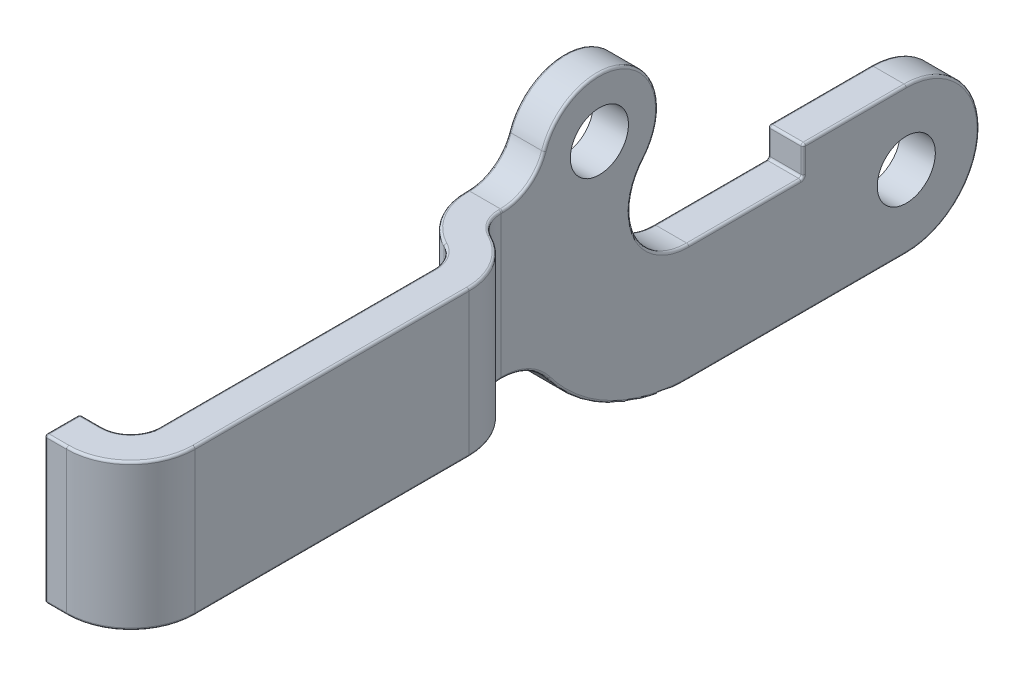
ISO-10303-21;
HEADER;
FILE_DESCRIPTION(('STEP AP214'),'2;1');
FILE_NAME('part.step','',(''),(''),'','','');
FILE_SCHEMA(('AUTOMOTIVE_DESIGN { 1 0 10303 214 1 1 1 1 }'));
ENDSEC;
DATA;
#1=APPLICATION_CONTEXT('core data for automotive mechanical design processes');
#2=APPLICATION_PROTOCOL_DEFINITION('international standard','automotive_design',2000,#1);
#3=PRODUCT_CONTEXT('',#1,'mechanical');
#4=PRODUCT('Part','Part','',(#3));
#5=PRODUCT_RELATED_PRODUCT_CATEGORY('part','',(#4));
#6=PRODUCT_DEFINITION_FORMATION('','',#4);
#7=PRODUCT_DEFINITION_CONTEXT('part definition',#1,'design');
#8=PRODUCT_DEFINITION('design','',#6,#7);
#9=PRODUCT_DEFINITION_SHAPE('','',#8);
#10=(LENGTH_UNIT() NAMED_UNIT(*) SI_UNIT(.MILLI.,.METRE.));
#11=(NAMED_UNIT(*) PLANE_ANGLE_UNIT() SI_UNIT($,.RADIAN.));
#12=(NAMED_UNIT(*) SI_UNIT($,.STERADIAN.) SOLID_ANGLE_UNIT());
#13=UNCERTAINTY_MEASURE_WITH_UNIT(LENGTH_MEASURE(1.E-05),#10,'distance_accuracy_value','');
#14=(GEOMETRIC_REPRESENTATION_CONTEXT(3) GLOBAL_UNCERTAINTY_ASSIGNED_CONTEXT((#13)) GLOBAL_UNIT_ASSIGNED_CONTEXT((#10,
#11,#12)) REPRESENTATION_CONTEXT('',''));
#15=CARTESIAN_POINT('',(0.,0.,0.));
#16=DIRECTION('',(0.,0.,1.));
#17=DIRECTION('',(1.,0.,0.));
#18=AXIS2_PLACEMENT_3D('',#15,#16,#17);
#19=CARTESIAN_POINT('',(0.127000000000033,3.87667409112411,30.5689));
#20=DIRECTION('',(0.,-1.,0.));
#21=DIRECTION('',(1.,0.,0.));
#22=AXIS2_PLACEMENT_3D('',#19,#20,#21);
#23=CYLINDRICAL_SURFACE('',#22,0.127);
#24=CARTESIAN_POINT('',(0.127000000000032,0.10160000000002,30.5689));
#25=DIRECTION('',(0.,-1.,0.));
#26=DIRECTION('',(1.,0.,0.));
#27=AXIS2_PLACEMENT_3D('',#24,#25,#26);
#28=CIRCLE('',#27,0.127);
#29=CARTESIAN_POINT('',(0.,0.10160000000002,30.5689));
#30=VERTEX_POINT('',#29);
#31=CARTESIAN_POINT('',(0.127000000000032,0.10160000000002,30.6959));
#32=VERTEX_POINT('',#31);
#33=EDGE_CURVE('E256',#30,#32,#28,.F.);
#34=ORIENTED_EDGE('',*,*,#33,.T.);
#35=DIRECTION('',(0.,1.,0.));
#36=VECTOR('',#35,1.);
#37=CARTESIAN_POINT('',(0.127000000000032,3.8163481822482,30.6959));
#38=LINE('',#37,#36);
#39=CARTESIAN_POINT('',(0.127000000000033,7.77240000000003,30.6959));
#40=VERTEX_POINT('',#39);
#41=EDGE_CURVE('E260',#32,#40,#38,.T.);
#42=ORIENTED_EDGE('',*,*,#41,.T.);
#43=CARTESIAN_POINT('',(0.127000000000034,7.77240000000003,30.5689));
#44=DIRECTION('',(0.,-1.,0.));
#45=DIRECTION('',(1.,0.,0.));
#46=AXIS2_PLACEMENT_3D('',#43,#44,#45);
#47=CIRCLE('',#46,0.127);
#48=CARTESIAN_POINT('',(0.,7.77240000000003,30.5689));
#49=VERTEX_POINT('',#48);
#50=EDGE_CURVE('E245',#40,#49,#47,.T.);
#51=ORIENTED_EDGE('',*,*,#50,.T.);
#52=DIRECTION('',(0.,-1.,0.));
#53=VECTOR('',#52,1.);
#54=CARTESIAN_POINT('',(0.,3.93700000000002,30.5689));
#55=LINE('',#54,#53);
#56=EDGE_CURVE('E292',#30,#49,#55,.F.);
#57=ORIENTED_EDGE('',*,*,#56,.F.);
#58=EDGE_LOOP('',(#34,#42,#51,#57));
#59=FACE_BOUND('',#58,.T.);
#60=ADVANCED_FACE('F17',(#59),#23,.T.);
#61=CARTESIAN_POINT('',(0.,3.93700000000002,15.7734));
#62=DIRECTION('',(-1.,0.,0.));
#63=DIRECTION('',(0.,-1.,0.));
#64=AXIS2_PLACEMENT_3D('',#61,#62,#63);
#65=PLANE('',#64);
#66=DIRECTION('',(0.,0.,1.));
#67=VECTOR('',#66,1.);
#68=CARTESIAN_POINT('',(0.,0.10160000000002,15.7734));
#69=LINE('',#68,#67);
#70=CARTESIAN_POINT('',(0.,0.10160000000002,28.9179));
#71=VERTEX_POINT('',#70);
#72=EDGE_CURVE('E295',#71,#30,#69,.T.);
#73=ORIENTED_EDGE('',*,*,#72,.T.);
#74=ORIENTED_EDGE('',*,*,#56,.T.);
#75=DIRECTION('',(0.,0.,1.));
#76=VECTOR('',#75,1.);
#77=CARTESIAN_POINT('',(0.,7.77240000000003,15.7734));
#78=LINE('',#77,#76);
#79=CARTESIAN_POINT('',(0.,7.77240000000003,28.9179));
#80=VERTEX_POINT('',#79);
#81=EDGE_CURVE('E298',#49,#80,#78,.F.);
#82=ORIENTED_EDGE('',*,*,#81,.T.);
#83=DIRECTION('',(0.,1.,0.));
#84=VECTOR('',#83,1.);
#85=CARTESIAN_POINT('',(0.,3.87667409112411,28.9179));
#86=LINE('',#85,#84);
#87=EDGE_CURVE('E280',#71,#80,#86,.T.);
#88=ORIENTED_EDGE('',*,*,#87,.F.);
#89=EDGE_LOOP('',(#73,#74,#82,#88));
#90=FACE_BOUND('',#89,.T.);
#91=ADVANCED_FACE('F1315',(#90),#65,.T.);
#92=CARTESIAN_POINT('',(0.59690000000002,3.8163481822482,30.6959));
#93=DIRECTION('',(0.,0.,-1.));
#94=DIRECTION('',(0.,1.,0.));
#95=AXIS2_PLACEMENT_3D('',#92,#93,#94);
#96=PLANE('',#95);
#97=DIRECTION('',(1.,0.,0.));
#98=VECTOR('',#97,1.);
#99=CARTESIAN_POINT('',(0.59690000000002,7.77240000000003,30.6959));
#100=LINE('',#99,#98);
#101=CARTESIAN_POINT('',(1.19380000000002,7.77240000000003,30.6959));
#102=VERTEX_POINT('',#101);
#103=EDGE_CURVE('E264',#40,#102,#100,.T.);
#104=ORIENTED_EDGE('',*,*,#103,.F.);
#105=ORIENTED_EDGE('',*,*,#41,.F.);
#106=DIRECTION('',(1.,0.,0.));
#107=VECTOR('',#106,1.);
#108=CARTESIAN_POINT('',(0.59690000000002,0.10160000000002,30.6959));
#109=LINE('',#108,#107);
#110=CARTESIAN_POINT('',(1.19380000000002,0.10160000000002,30.6959));
#111=VERTEX_POINT('',#110);
#112=EDGE_CURVE('E265',#111,#32,#109,.F.);
#113=ORIENTED_EDGE('',*,*,#112,.F.);
#114=DIRECTION('',(0.,1.,0.));
#115=VECTOR('',#114,1.);
#116=CARTESIAN_POINT('',(1.19380000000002,3.8163481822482,30.6959));
#117=LINE('',#116,#115);
#118=EDGE_CURVE('E278',#102,#111,#117,.F.);
#119=ORIENTED_EDGE('',*,*,#118,.F.);
#120=EDGE_LOOP('',(#104,#105,#113,#119));
#121=FACE_BOUND('',#120,.T.);
#122=ADVANCED_FACE('F276',(#121),#96,.F.);
#123=CARTESIAN_POINT('',(0.127000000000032,3.87667409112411,28.9179));
#124=DIRECTION('',(0.,1.,0.));
#125=DIRECTION('',(-1.,0.,0.));
#126=AXIS2_PLACEMENT_3D('',#123,#124,#125);
#127=CYLINDRICAL_SURFACE('',#126,0.127);
#128=CARTESIAN_POINT('',(0.127000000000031,0.10160000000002,28.9179));
#129=DIRECTION('',(0.,1.,0.));
#130=DIRECTION('',(-1.,0.,0.));
#131=AXIS2_PLACEMENT_3D('',#128,#129,#130);
#132=CIRCLE('',#131,0.127);
#133=CARTESIAN_POINT('',(0.127000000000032,0.10160000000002,28.7909));
#134=VERTEX_POINT('',#133);
#135=EDGE_CURVE('E521',#71,#134,#132,.F.);
#136=ORIENTED_EDGE('',*,*,#135,.F.);
#137=ORIENTED_EDGE('',*,*,#87,.T.);
#138=CARTESIAN_POINT('',(0.127000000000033,7.77240000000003,28.9179));
#139=DIRECTION('',(0.,1.,0.));
#140=DIRECTION('',(-1.,0.,0.));
#141=AXIS2_PLACEMENT_3D('',#138,#139,#140);
#142=CIRCLE('',#141,0.127);
#143=CARTESIAN_POINT('',(0.102798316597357,7.77240000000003,28.7932273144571));
#144=VERTEX_POINT('',#143);
#145=EDGE_CURVE('E518',#144,#80,#142,.T.);
#146=ORIENTED_EDGE('',*,*,#145,.F.);
#147=CARTESIAN_POINT('',(0.127000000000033,7.77240000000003,28.9179));
#148=DIRECTION('',(0.,1.,0.));
#149=DIRECTION('',(-1.,0.,0.));
#150=AXIS2_PLACEMENT_3D('',#147,#148,#149);
#151=CIRCLE('',#150,0.127);
#152=CARTESIAN_POINT('',(0.127000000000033,7.77240000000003,28.7909));
#153=VERTEX_POINT('',#152);
#154=EDGE_CURVE('E283',#153,#144,#151,.T.);
#155=ORIENTED_EDGE('',*,*,#154,.F.);
#156=DIRECTION('',(0.,-1.,0.));
#157=VECTOR('',#156,1.);
#158=CARTESIAN_POINT('',(0.127000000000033,3.8163481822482,28.7909));
#159=LINE('',#158,#157);
#160=EDGE_CURVE('E1215',#153,#134,#159,.T.);
#161=ORIENTED_EDGE('',*,*,#160,.T.);
#162=EDGE_LOOP('',(#136,#137,#146,#155,#161));
#163=FACE_BOUND('',#162,.T.);
#164=ADVANCED_FACE('F1310',(#163),#127,.T.);
#165=CARTESIAN_POINT('',(0.127000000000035,7.77240000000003,30.5689));
#166=DIRECTION('',(0.418426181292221,0.431511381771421,0.799198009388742));
#167=DIRECTION('',(-0.188116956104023,0.902024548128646,-0.388540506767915));
#168=AXIS2_PLACEMENT_3D('',#165,#166,#167);
#169=SPHERICAL_SURFACE('',#168,0.127000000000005);
#170=ORIENTED_EDGE('',*,*,#50,.F.);
#171=CARTESIAN_POINT('',(0.127000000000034,7.77240000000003,30.5689));
#172=DIRECTION('',(-1.,0.,0.));
#173=DIRECTION('',(0.,-1.,0.));
#174=AXIS2_PLACEMENT_3D('',#171,#172,#173);
#175=CIRCLE('',#174,0.127);
#176=CARTESIAN_POINT('',(0.127000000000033,7.89940000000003,30.5689));
#177=VERTEX_POINT('',#176);
#178=EDGE_CURVE('E249',#177,#40,#175,.F.);
#179=ORIENTED_EDGE('',*,*,#178,.F.);
#180=CARTESIAN_POINT('',(0.127000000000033,7.77240000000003,30.5689));
#181=DIRECTION('',(0.,0.,-1.));
#182=DIRECTION('',(0.,1.,0.));
#183=AXIS2_PLACEMENT_3D('',#180,#181,#182);
#184=CIRCLE('',#183,0.127);
#185=EDGE_CURVE('E252',#49,#177,#184,.T.);
#186=ORIENTED_EDGE('',*,*,#185,.F.);
#187=EDGE_LOOP('',(#170,#179,#186));
#188=FACE_BOUND('',#187,.T.);
#189=ADVANCED_FACE('F247',(#188),#169,.T.);
#190=CARTESIAN_POINT('',(0.148612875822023,7.79445437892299,28.7947111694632));
#191=CARTESIAN_POINT('',(0.142053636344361,7.8008315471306,28.7947020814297));
#192=CARTESIAN_POINT('',(0.134852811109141,7.80642412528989,28.7954525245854));
#193=CARTESIAN_POINT('',(0.127148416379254,7.81112492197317,28.7969481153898));
#194=CARTESIAN_POINT('',(0.138093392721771,7.78362916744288,28.790927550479));
#195=CARTESIAN_POINT('',(0.13218456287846,7.78937398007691,28.7909193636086));
#196=CARTESIAN_POINT('',(0.125697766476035,7.79441200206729,28.7915953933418));
#197=CARTESIAN_POINT('',(0.118757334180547,7.79864667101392,28.7929426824));
#198=CARTESIAN_POINT('',(0.127267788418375,7.77249309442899,28.7899504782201));
#199=CARTESIAN_POINT('',(0.122144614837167,7.77747405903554,28.7899433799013));
#200=CARTESIAN_POINT('',(0.116520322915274,7.78184221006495,28.7905295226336));
#201=CARTESIAN_POINT('',(0.110502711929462,7.78551382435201,28.7916976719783));
#202=CARTESIAN_POINT('',(0.116496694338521,7.76141713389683,28.7918125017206));
#203=CARTESIAN_POINT('',(0.11226825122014,7.76552820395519,28.7918066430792));
#204=CARTESIAN_POINT('',(0.107626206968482,7.7691334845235,28.7922904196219));
#205=CARTESIAN_POINT('',(0.102659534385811,7.7721638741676,28.793254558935));
#206=(BOUNDED_SURFACE() B_SPLINE_SURFACE(3,3,((#190,#191,#192,#193),(#194,#195,#196,#197),(#198,
#199,#200,#201),(#202,#203,#204,#205)),.UNSPECIFIED.,.F.,.F.,
.F.) B_SPLINE_SURFACE_WITH_KNOTS((4,4),(4,4),(0.,1.),(0.,1.),
.UNSPECIFIED.) GEOMETRIC_REPRESENTATION_ITEM() RATIONAL_B_SPLINE_SURFACE(((1.,0.993611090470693,
0.993611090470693,1.),(0.98889572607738,0.982577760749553,0.982577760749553,0.98889572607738),
(0.98889572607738,0.982577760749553,0.982577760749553,0.98889572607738),(1.,0.993611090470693,
0.993611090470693,1.))) REPRESENTATION_ITEM('') SURFACE());
#207=CARTESIAN_POINT('',(0.127000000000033,7.77240000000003,28.9179));
#208=DIRECTION('',(1.,0.,0.));
#209=DIRECTION('',(0.,1.,0.));
#210=AXIS2_PLACEMENT_3D('',#207,#208,#209);
#211=CIRCLE('',#210,0.127);
#212=CARTESIAN_POINT('',(0.127000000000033,7.81090412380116,28.7968775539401));
#213=VERTEX_POINT('',#212);
#214=EDGE_CURVE('E529',#153,#213,#211,.T.);
#215=CARTESIAN_POINT('',(0.127000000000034,7.77240000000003,28.9179));
#216=DIRECTION('',(-0.842163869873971,0.513841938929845,0.1634823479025));
#217=DIRECTION('',(-0.520849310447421,-0.853648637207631,0.));
#218=AXIS2_PLACEMENT_3D('',#215,#216,#217);
#219=CIRCLE('',#218,0.127000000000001);
#220=EDGE_CURVE('E517',#213,#144,#219,.T.);
#221=ORIENTED_EDGE('',*,*,#214,.F.);
#222=ORIENTED_EDGE('',*,*,#154,.T.);
#223=ORIENTED_EDGE('',*,*,#220,.F.);
#224=EDGE_LOOP('',(#221,#222,#223));
#225=FACE_BOUND('',#224,.T.);
#226=ADVANCED_FACE('F1357',(#225),#206,.T.);
#227=CARTESIAN_POINT('',(0.127000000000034,7.77240000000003,28.9179));
#228=DIRECTION('',(0.418426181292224,0.431511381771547,0.799198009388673));
#229=DIRECTION('',(0.340116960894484,0.741460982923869,-0.578408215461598));
#230=AXIS2_PLACEMENT_3D('',#227,#228,#229);
#231=SPHERICAL_SURFACE('',#230,0.127000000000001);
#232=ORIENTED_EDGE('',*,*,#145,.T.);
#233=CARTESIAN_POINT('',(0.127000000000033,7.77240000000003,28.9179));
#234=DIRECTION('',(0.,0.,-1.));
#235=DIRECTION('',(0.,1.,0.));
#236=AXIS2_PLACEMENT_3D('',#233,#234,#235);
#237=CIRCLE('',#236,0.127);
#238=CARTESIAN_POINT('',(0.127000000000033,7.89940000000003,28.9179));
#239=VERTEX_POINT('',#238);
#240=EDGE_CURVE('E525',#239,#80,#237,.F.);
#241=ORIENTED_EDGE('',*,*,#240,.F.);
#242=CARTESIAN_POINT('',(0.127000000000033,7.77240000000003,28.9179));
#243=DIRECTION('',(1.,0.,0.));
#244=DIRECTION('',(0.,1.,0.));
#245=AXIS2_PLACEMENT_3D('',#242,#243,#244);
#246=CIRCLE('',#245,0.127);
#247=EDGE_CURVE('E532',#213,#239,#246,.T.);
#248=ORIENTED_EDGE('',*,*,#247,.F.);
#249=ORIENTED_EDGE('',*,*,#220,.T.);
#250=EDGE_LOOP('',(#232,#241,#248,#249));
#251=FACE_BOUND('',#250,.T.);
#252=ADVANCED_FACE('F1307',(#251),#231,.T.);
#253=CARTESIAN_POINT('',(0.127000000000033,0.101600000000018,28.9179));
#254=DIRECTION('',(0.418426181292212,0.431511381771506,0.799198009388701));
#255=DIRECTION('',(-0.340116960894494,-0.741460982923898,0.578408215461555));
#256=AXIS2_PLACEMENT_3D('',#253,#254,#255);
#257=SPHERICAL_SURFACE('',#256,0.126999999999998);
#258=ORIENTED_EDGE('',*,*,#135,.T.);
#259=CARTESIAN_POINT('',(0.127000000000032,0.10160000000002,28.9179));
#260=DIRECTION('',(-1.,0.,0.));
#261=DIRECTION('',(0.,-1.,0.));
#262=AXIS2_PLACEMENT_3D('',#259,#260,#261);
#263=CIRCLE('',#262,0.127);
#264=CARTESIAN_POINT('',(0.127000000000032,-0.025399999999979,28.9179));
#265=VERTEX_POINT('',#264);
#266=EDGE_CURVE('E536',#265,#134,#263,.F.);
#267=ORIENTED_EDGE('',*,*,#266,.F.);
#268=CARTESIAN_POINT('',(0.127000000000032,0.101600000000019,28.9179));
#269=DIRECTION('',(0.,0.,1.));
#270=DIRECTION('',(0.,-1.,0.));
#271=AXIS2_PLACEMENT_3D('',#268,#269,#270);
#272=CIRCLE('',#271,0.127);
#273=EDGE_CURVE('E541',#71,#265,#272,.T.);
#274=ORIENTED_EDGE('',*,*,#273,.F.);
#275=EDGE_LOOP('',(#258,#267,#274));
#276=FACE_BOUND('',#275,.T.);
#277=ADVANCED_FACE('F1349',(#276),#257,.T.);
#278=CARTESIAN_POINT('',(0.12700000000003,0.10160000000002,30.5689));
#279=DIRECTION('',(0.418426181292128,0.431511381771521,0.799198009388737));
#280=DIRECTION('',(-0.908198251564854,0.208249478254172,0.363053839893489));
#281=AXIS2_PLACEMENT_3D('',#278,#279,#280);
#282=SPHERICAL_SURFACE('',#281,0.126999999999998);
#283=ORIENTED_EDGE('',*,*,#33,.F.);
#284=CARTESIAN_POINT('',(0.127000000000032,0.10160000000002,30.5689));
#285=DIRECTION('',(0.,0.,1.));
#286=DIRECTION('',(0.,-1.,0.));
#287=AXIS2_PLACEMENT_3D('',#284,#285,#286);
#288=CIRCLE('',#287,0.127);
#289=CARTESIAN_POINT('',(0.127000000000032,-0.0253999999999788,30.5689));
#290=VERTEX_POINT('',#289);
#291=EDGE_CURVE('E544',#290,#30,#288,.F.);
#292=ORIENTED_EDGE('',*,*,#291,.F.);
#293=CARTESIAN_POINT('',(0.127000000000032,0.10160000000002,30.5689));
#294=DIRECTION('',(1.,0.,0.));
#295=DIRECTION('',(0.,1.,0.));
#296=AXIS2_PLACEMENT_3D('',#293,#294,#295);
#297=CIRCLE('',#296,0.127);
#298=EDGE_CURVE('E547',#32,#290,#297,.T.);
#299=ORIENTED_EDGE('',*,*,#298,.F.);
#300=EDGE_LOOP('',(#283,#292,#299));
#301=FACE_BOUND('',#300,.T.);
#302=ADVANCED_FACE('F1321',(#301),#282,.T.);
#303=CARTESIAN_POINT('',(1.19380000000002,3.8163481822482,27.2161));
#304=DIRECTION('',(0.,1.,0.));
#305=DIRECTION('',(-1.,0.,0.));
#306=AXIS2_PLACEMENT_3D('',#303,#304,#305);
#307=CYLINDRICAL_SURFACE('',#306,3.47979999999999);
#308=CARTESIAN_POINT('',(1.19380000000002,0.101600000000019,27.2161));
#309=DIRECTION('',(0.,-1.,0.));
#310=DIRECTION('',(1.,0.,0.));
#311=AXIS2_PLACEMENT_3D('',#308,#309,#310);
#312=CIRCLE('',#311,3.47979999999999);
#313=CARTESIAN_POINT('',(4.67360000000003,0.101600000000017,27.2161));
#314=VERTEX_POINT('',#313);
#315=EDGE_CURVE('E1156',#314,#111,#312,.T.);
#316=ORIENTED_EDGE('',*,*,#315,.F.);
#317=DIRECTION('',(0.,-1.,0.));
#318=VECTOR('',#317,1.);
#319=CARTESIAN_POINT('',(4.67360000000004,3.93700000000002,27.2161));
#320=LINE('',#319,#318);
#321=CARTESIAN_POINT('',(4.67360000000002,7.77240000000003,27.2161));
#322=VERTEX_POINT('',#321);
#323=EDGE_CURVE('E1222',#314,#322,#320,.F.);
#324=ORIENTED_EDGE('',*,*,#323,.T.);
#325=CARTESIAN_POINT('',(1.19380000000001,7.77240000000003,27.2161));
#326=DIRECTION('',(0.,1.,0.));
#327=DIRECTION('',(-1.,0.,0.));
#328=AXIS2_PLACEMENT_3D('',#325,#326,#327);
#329=CIRCLE('',#328,3.47979999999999);
#330=EDGE_CURVE('E1181',#102,#322,#329,.T.);
#331=ORIENTED_EDGE('',*,*,#330,.F.);
#332=ORIENTED_EDGE('',*,*,#118,.T.);
#333=EDGE_LOOP('',(#316,#324,#331,#332));
#334=FACE_BOUND('',#333,.T.);
#335=ADVANCED_FACE('F1282',(#334),#307,.T.);
#336=CARTESIAN_POINT('',(4.67360000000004,3.93700000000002,15.7734));
#337=DIRECTION('',(-1.,0.,0.));
#338=DIRECTION('',(0.,-1.,0.));
#339=AXIS2_PLACEMENT_3D('',#336,#337,#338);
#340=PLANE('',#339);
#341=DIRECTION('',(0.,0.,1.));
#342=VECTOR('',#341,1.);
#343=CARTESIAN_POINT('',(4.67360000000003,7.77240000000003,15.7734));
#344=LINE('',#343,#342);
#345=CARTESIAN_POINT('',(4.67360000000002,7.77240000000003,12.36575249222));
#346=VERTEX_POINT('',#345);
#347=EDGE_CURVE('E1187',#322,#346,#344,.F.);
#348=ORIENTED_EDGE('',*,*,#347,.F.);
#349=ORIENTED_EDGE('',*,*,#323,.F.);
#350=DIRECTION('',(0.,0.,-1.));
#351=VECTOR('',#350,1.);
#352=CARTESIAN_POINT('',(4.67360000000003,0.101600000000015,15.7734));
#353=LINE('',#352,#351);
#354=CARTESIAN_POINT('',(4.67360000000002,0.101600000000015,12.36575249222));
#355=VERTEX_POINT('',#354);
#356=EDGE_CURVE('E1151',#355,#314,#353,.F.);
#357=ORIENTED_EDGE('',*,*,#356,.F.);
#358=DIRECTION('',(0.,1.,0.));
#359=VECTOR('',#358,1.);
#360=CARTESIAN_POINT('',(4.67360000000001,3.81634818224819,12.36575249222));
#361=LINE('',#360,#359);
#362=EDGE_CURVE('E1212',#346,#355,#361,.F.);
#363=ORIENTED_EDGE('',*,*,#362,.F.);
#364=EDGE_LOOP('',(#348,#349,#357,#363));
#365=FACE_BOUND('',#364,.T.);
#366=ADVANCED_FACE('F1287',(#365),#340,.F.);
#367=CARTESIAN_POINT('',(0.59690000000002,3.8163481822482,28.7909));
#368=DIRECTION('',(0.,0.,1.));
#369=DIRECTION('',(0.,-1.,0.));
#370=AXIS2_PLACEMENT_3D('',#367,#368,#369);
#371=PLANE('',#370);
#372=DIRECTION('',(1.,0.,0.));
#373=VECTOR('',#372,1.);
#374=CARTESIAN_POINT('',(1.46685000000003,7.77240000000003,28.7909));
#375=LINE('',#374,#373);
#376=CARTESIAN_POINT('',(1.19380000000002,7.77240000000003,28.7909));
#377=VERTEX_POINT('',#376);
#378=EDGE_CURVE('E528',#377,#153,#375,.F.);
#379=ORIENTED_EDGE('',*,*,#378,.F.);
#380=DIRECTION('',(0.,1.,0.));
#381=VECTOR('',#380,1.);
#382=CARTESIAN_POINT('',(1.19380000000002,3.8163481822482,28.7909));
#383=LINE('',#382,#381);
#384=CARTESIAN_POINT('',(1.19380000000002,0.10160000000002,28.7909));
#385=VERTEX_POINT('',#384);
#386=EDGE_CURVE('E1110',#377,#385,#383,.F.);
#387=ORIENTED_EDGE('',*,*,#386,.T.);
#388=DIRECTION('',(-1.,0.,0.));
#389=VECTOR('',#388,1.);
#390=CARTESIAN_POINT('',(1.46685000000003,0.101600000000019,28.7909));
#391=LINE('',#390,#389);
#392=EDGE_CURVE('E539',#134,#385,#391,.F.);
#393=ORIENTED_EDGE('',*,*,#392,.F.);
#394=ORIENTED_EDGE('',*,*,#160,.F.);
#395=EDGE_LOOP('',(#379,#387,#393,#394));
#396=FACE_BOUND('',#395,.T.);
#397=ADVANCED_FACE('F1347',(#396),#371,.F.);
#398=CARTESIAN_POINT('',(1.19380000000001,3.8163481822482,12.36575249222));
#399=DIRECTION('',(0.,1.,0.));
#400=DIRECTION('',(-1.,0.,0.));
#401=AXIS2_PLACEMENT_3D('',#398,#399,#400);
#402=CYLINDRICAL_SURFACE('',#401,3.4798);
#403=CARTESIAN_POINT('',(1.19380000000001,0.101600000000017,12.36575249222));
#404=DIRECTION('',(0.,-1.,0.));
#405=DIRECTION('',(1.,0.,0.));
#406=AXIS2_PLACEMENT_3D('',#403,#404,#405);
#407=CIRCLE('',#406,3.4798);
#408=CARTESIAN_POINT('',(2.76532258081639,0.101600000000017,9.26102628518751));
#409=VERTEX_POINT('',#408);
#410=EDGE_CURVE('E1145',#409,#355,#407,.T.);
#411=ORIENTED_EDGE('',*,*,#410,.F.);
#412=DIRECTION('',(0.,1.,0.));
#413=VECTOR('',#412,1.);
#414=CARTESIAN_POINT('',(2.76532258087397,3.8163481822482,9.2610262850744));
#415=LINE('',#414,#413);
#416=CARTESIAN_POINT('',(2.76532258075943,7.77240000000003,9.26102628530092));
#417=VERTEX_POINT('',#416);
#418=EDGE_CURVE('E1100',#409,#417,#415,.T.);
#419=ORIENTED_EDGE('',*,*,#418,.T.);
#420=CARTESIAN_POINT('',(1.19380000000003,7.77240000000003,12.36575249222));
#421=DIRECTION('',(0.,1.,0.));
#422=DIRECTION('',(0.,0.,1.));
#423=AXIS2_PLACEMENT_3D('',#420,#421,#422);
#424=CIRCLE('',#423,3.4798);
#425=EDGE_CURVE('E1193',#346,#417,#424,.T.);
#426=ORIENTED_EDGE('',*,*,#425,.F.);
#427=ORIENTED_EDGE('',*,*,#362,.T.);
#428=EDGE_LOOP('',(#411,#419,#426,#427));
#429=FACE_BOUND('',#428,.T.);
#430=ADVANCED_FACE('F1259',(#429),#402,.T.);
#431=CARTESIAN_POINT('',(3.47382352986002,7.77240000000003,7.86129999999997));
#432=DIRECTION('',(0.,1.,0.));
#433=DIRECTION('',(-1.,0.,0.));
#434=AXIS2_PLACEMENT_3D('',#431,#432,#433);
#435=TOROIDAL_SURFACE('',#434,1.69582352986,0.127000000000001);
#436=CARTESIAN_POINT('',(1.77800000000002,7.77240000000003,7.86129999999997));
#437=DIRECTION('',(0.,0.,1.));
#438=DIRECTION('',(0.,-1.,0.));
#439=AXIS2_PLACEMENT_3D('',#436,#437,#438);
#440=CIRCLE('',#439,0.127);
#441=CARTESIAN_POINT('',(1.77800000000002,7.89940000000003,7.86129999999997));
#442=VERTEX_POINT('',#441);
#443=CARTESIAN_POINT('',(1.90500000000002,7.77240000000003,7.86129999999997));
#444=VERTEX_POINT('',#443);
#445=EDGE_CURVE('E1082',#442,#444,#440,.F.);
#446=ORIENTED_EDGE('',*,*,#445,.F.);
#447=CARTESIAN_POINT('',(3.47382352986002,7.89940000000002,7.86129999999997));
#448=DIRECTION('',(0.,1.,0.));
#449=DIRECTION('',(-1.,0.,0.));
#450=AXIS2_PLACEMENT_3D('',#447,#448,#449);
#451=CIRCLE('',#450,1.69582352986);
#452=CARTESIAN_POINT('',(2.70796774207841,7.89940000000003,9.37433746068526));
#453=VERTEX_POINT('',#452);
#454=EDGE_CURVE('E551',#442,#453,#451,.T.);
#455=ORIENTED_EDGE('',*,*,#454,.T.);
#456=CARTESIAN_POINT('',(2.70796774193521,7.77240000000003,9.37433746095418));
#457=DIRECTION('',(0.892213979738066,0.,0.451612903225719));
#458=DIRECTION('',(0.451612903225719,0.,-0.892213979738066));
#459=AXIS2_PLACEMENT_3D('',#456,#457,#458);
#460=CIRCLE('',#459,0.127);
#461=EDGE_CURVE('E1190',#417,#453,#460,.T.);
#462=ORIENTED_EDGE('',*,*,#461,.F.);
#463=CARTESIAN_POINT('',(3.47382352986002,7.77240000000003,7.86129999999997));
#464=DIRECTION('',(0.,1.,0.));
#465=DIRECTION('',(-1.,0.,0.));
#466=AXIS2_PLACEMENT_3D('',#463,#464,#465);
#467=CIRCLE('',#466,1.56882352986);
#468=EDGE_CURVE('E1091',#417,#444,#467,.F.);
#469=ORIENTED_EDGE('',*,*,#468,.T.);
#470=EDGE_LOOP('',(#446,#455,#462,#469));
#471=FACE_BOUND('',#470,.T.);
#472=ADVANCED_FACE('F1361',(#471),#435,.T.);
#473=CARTESIAN_POINT('',(1.19380000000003,7.77240000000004,12.36575249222));
#474=DIRECTION('',(0.,-1.,0.));
#475=DIRECTION('',(0.,0.,-1.));
#476=AXIS2_PLACEMENT_3D('',#473,#474,#475);
#477=TOROIDAL_SURFACE('',#476,3.3528,0.127);
#478=ORIENTED_EDGE('',*,*,#461,.T.);
#479=CARTESIAN_POINT('',(1.19380000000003,7.89940000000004,12.36575249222));
#480=DIRECTION('',(0.,-1.,0.));
#481=DIRECTION('',(0.,0.,-1.));
#482=AXIS2_PLACEMENT_3D('',#479,#480,#481);
#483=CIRCLE('',#482,3.35280000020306);
#484=CARTESIAN_POINT('',(4.54660000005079,7.89940000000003,12.36575249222));
#485=VERTEX_POINT('',#484);
#486=EDGE_CURVE('E553',#453,#485,#483,.T.);
#487=ORIENTED_EDGE('',*,*,#486,.T.);
#488=CARTESIAN_POINT('',(4.54660000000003,7.77240000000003,12.36575249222));
#489=DIRECTION('',(0.,0.,1.));
#490=DIRECTION('',(0.,-1.,0.));
#491=AXIS2_PLACEMENT_3D('',#488,#489,#490);
#492=CIRCLE('',#491,0.127);
#493=EDGE_CURVE('E1184',#346,#485,#492,.T.);
#494=ORIENTED_EDGE('',*,*,#493,.F.);
#495=ORIENTED_EDGE('',*,*,#425,.T.);
#496=EDGE_LOOP('',(#478,#487,#494,#495));
#497=FACE_BOUND('',#496,.T.);
#498=ADVANCED_FACE('F1252',(#497),#477,.T.);
#499=CARTESIAN_POINT('',(4.54660000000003,7.77240000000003,15.7734));
#500=DIRECTION('',(0.,0.,1.));
#501=DIRECTION('',(0.,-1.,0.));
#502=AXIS2_PLACEMENT_3D('',#499,#500,#501);
#503=CYLINDRICAL_SURFACE('',#502,0.127);
#504=ORIENTED_EDGE('',*,*,#493,.T.);
#505=DIRECTION('',(0.,0.,1.));
#506=VECTOR('',#505,1.);
#507=CARTESIAN_POINT('',(4.54660000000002,7.89940000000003,15.7734));
#508=LINE('',#507,#506);
#509=CARTESIAN_POINT('',(4.54660000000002,7.89940000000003,27.2161));
#510=VERTEX_POINT('',#509);
#511=EDGE_CURVE('E556',#485,#510,#508,.T.);
#512=ORIENTED_EDGE('',*,*,#511,.T.);
#513=CARTESIAN_POINT('',(4.54660000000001,7.77240000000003,27.2161));
#514=DIRECTION('',(0.,0.,1.));
#515=DIRECTION('',(1.,0.,0.));
#516=AXIS2_PLACEMENT_3D('',#513,#514,#515);
#517=CIRCLE('',#516,0.126999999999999);
#518=EDGE_CURVE('E1176',#322,#510,#517,.T.);
#519=ORIENTED_EDGE('',*,*,#518,.F.);
#520=ORIENTED_EDGE('',*,*,#347,.T.);
#521=EDGE_LOOP('',(#504,#512,#519,#520));
#522=FACE_BOUND('',#521,.T.);
#523=ADVANCED_FACE('F1290',(#522),#503,.T.);
#524=CARTESIAN_POINT('',(1.19380000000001,7.77240000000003,27.2161));
#525=DIRECTION('',(0.,-1.,0.));
#526=DIRECTION('',(1.,0.,0.));
#527=AXIS2_PLACEMENT_3D('',#524,#525,#526);
#528=TOROIDAL_SURFACE('',#527,3.3528,0.126999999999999);
#529=ORIENTED_EDGE('',*,*,#518,.T.);
#530=CARTESIAN_POINT('',(1.19380000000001,7.89940000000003,27.2161));
#531=DIRECTION('',(0.,-1.,0.));
#532=DIRECTION('',(1.,0.,0.));
#533=AXIS2_PLACEMENT_3D('',#530,#531,#532);
#534=CIRCLE('',#533,3.3528);
#535=CARTESIAN_POINT('',(1.19380000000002,7.89940000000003,30.5689));
#536=VERTEX_POINT('',#535);
#537=EDGE_CURVE('E557',#510,#536,#534,.T.);
#538=ORIENTED_EDGE('',*,*,#537,.T.);
#539=CARTESIAN_POINT('',(1.19380000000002,7.77240000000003,30.5689));
#540=DIRECTION('',(-1.,0.,0.));
#541=DIRECTION('',(0.,-1.,0.));
#542=AXIS2_PLACEMENT_3D('',#539,#540,#541);
#543=CIRCLE('',#542,0.127);
#544=EDGE_CURVE('E274',#102,#536,#543,.T.);
#545=ORIENTED_EDGE('',*,*,#544,.F.);
#546=ORIENTED_EDGE('',*,*,#330,.T.);
#547=EDGE_LOOP('',(#529,#538,#545,#546));
#548=FACE_BOUND('',#547,.T.);
#549=ADVANCED_FACE('F323',(#548),#528,.T.);
#550=CARTESIAN_POINT('',(1.46685000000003,7.77240000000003,30.5689));
#551=DIRECTION('',(-1.,0.,0.));
#552=DIRECTION('',(0.,-1.,0.));
#553=AXIS2_PLACEMENT_3D('',#550,#551,#552);
#554=CYLINDRICAL_SURFACE('',#553,0.127);
#555=ORIENTED_EDGE('',*,*,#178,.T.);
#556=ORIENTED_EDGE('',*,*,#103,.T.);
#557=ORIENTED_EDGE('',*,*,#544,.T.);
#558=DIRECTION('',(1.,0.,0.));
#559=VECTOR('',#558,1.);
#560=CARTESIAN_POINT('',(2.33680000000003,7.89940000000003,30.5689));
#561=LINE('',#560,#559);
#562=EDGE_CURVE('E273',#536,#177,#561,.F.);
#563=ORIENTED_EDGE('',*,*,#562,.T.);
#564=EDGE_LOOP('',(#555,#556,#557,#563));
#565=FACE_BOUND('',#564,.T.);
#566=ADVANCED_FACE('F269',(#565),#554,.T.);
#567=CARTESIAN_POINT('',(0.127000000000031,7.77240000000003,15.7734));
#568=DIRECTION('',(0.,0.,-1.));
#569=DIRECTION('',(0.,1.,0.));
#570=AXIS2_PLACEMENT_3D('',#567,#568,#569);
#571=CYLINDRICAL_SURFACE('',#570,0.127);
#572=ORIENTED_EDGE('',*,*,#240,.T.);
#573=ORIENTED_EDGE('',*,*,#81,.F.);
#574=ORIENTED_EDGE('',*,*,#185,.T.);
#575=DIRECTION('',(0.,0.,1.));
#576=VECTOR('',#575,1.);
#577=CARTESIAN_POINT('',(0.127000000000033,7.89940000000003,15.7734));
#578=LINE('',#577,#576);
#579=EDGE_CURVE('E560',#177,#239,#578,.F.);
#580=ORIENTED_EDGE('',*,*,#579,.T.);
#581=EDGE_LOOP('',(#572,#573,#574,#580));
#582=FACE_BOUND('',#581,.T.);
#583=ADVANCED_FACE('F1300',(#582),#571,.T.);
#584=CARTESIAN_POINT('',(1.46685000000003,7.77240000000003,28.9179));
#585=DIRECTION('',(1.,0.,0.));
#586=DIRECTION('',(0.,1.,0.));
#587=AXIS2_PLACEMENT_3D('',#584,#585,#586);
#588=CYLINDRICAL_SURFACE('',#587,0.127);
#589=ORIENTED_EDGE('',*,*,#247,.T.);
#590=DIRECTION('',(1.,0.,0.));
#591=VECTOR('',#590,1.);
#592=CARTESIAN_POINT('',(2.33680000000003,7.89940000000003,28.9179));
#593=LINE('',#592,#591);
#594=CARTESIAN_POINT('',(1.19380000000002,7.89940000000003,28.9179));
#595=VERTEX_POINT('',#594);
#596=EDGE_CURVE('E306',#239,#595,#593,.T.);
#597=ORIENTED_EDGE('',*,*,#596,.T.);
#598=CARTESIAN_POINT('',(1.19380000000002,7.77240000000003,28.9179));
#599=DIRECTION('',(1.,0.,0.));
#600=DIRECTION('',(0.,0.,-1.));
#601=AXIS2_PLACEMENT_3D('',#598,#599,#600);
#602=CIRCLE('',#601,0.127000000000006);
#603=EDGE_CURVE('E535',#377,#595,#602,.T.);
#604=ORIENTED_EDGE('',*,*,#603,.F.);
#605=ORIENTED_EDGE('',*,*,#378,.T.);
#606=ORIENTED_EDGE('',*,*,#214,.T.);
#607=EDGE_LOOP('',(#589,#597,#604,#605,#606));
#608=FACE_BOUND('',#607,.T.);
#609=ADVANCED_FACE('F321',(#608),#588,.T.);
#610=CARTESIAN_POINT('',(1.19380000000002,7.77240000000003,27.2161));
#611=DIRECTION('',(0.,1.,0.));
#612=DIRECTION('',(-1.,0.,0.));
#613=AXIS2_PLACEMENT_3D('',#610,#611,#612);
#614=TOROIDAL_SURFACE('',#613,1.70180000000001,0.127000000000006);
#615=ORIENTED_EDGE('',*,*,#603,.T.);
#616=CARTESIAN_POINT('',(1.19380000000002,7.89940000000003,28.9179));
#617=CARTESIAN_POINT('',(1.21517680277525,7.89939999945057,28.9178868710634));
#618=CARTESIAN_POINT('',(1.23655341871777,7.89939999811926,28.9174751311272));
#619=CARTESIAN_POINT('',(1.27927549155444,7.89939999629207,28.9158552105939));
#620=CARTESIAN_POINT('',(1.30062094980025,7.89939999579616,28.9146470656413));
#621=CARTESIAN_POINT('',(1.34325120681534,7.89939999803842,28.9114351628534));
#622=CARTESIAN_POINT('',(1.36453600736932,7.89940000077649,28.9094314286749));
#623=CARTESIAN_POINT('',(1.40701639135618,7.89939999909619,28.9046347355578));
#624=CARTESIAN_POINT('',(1.428211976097,7.89939999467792,28.9018417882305));
#625=CARTESIAN_POINT('',(1.47048211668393,7.89939998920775,28.8954572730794));
#626=CARTESIAN_POINT('',(1.49155667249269,7.89939998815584,28.8918657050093));
#627=CARTESIAN_POINT('',(1.5275647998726,7.89939991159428,28.8850709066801));
#628=CARTESIAN_POINT('',(1.5425327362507,7.89939985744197,28.8820498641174));
#629=CARTESIAN_POINT('',(1.55823940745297,7.89939986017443,28.8786129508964));
#630=CARTESIAN_POINT('',(1.55903126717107,7.89939986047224,28.878438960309));
#631=CARTESIAN_POINT('',(1.57162378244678,7.89939986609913,28.8756619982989));
#632=CARTESIAN_POINT('',(1.58339500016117,7.89939988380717,28.8729252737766));
#633=CARTESIAN_POINT('',(1.62085103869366,7.89939993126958,28.8637989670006));
#634=CARTESIAN_POINT('',(1.64642278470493,7.89939995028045,28.856938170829));
#635=CARTESIAN_POINT('',(1.69252731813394,7.89939997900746,28.8434022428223));
#636=CARTESIAN_POINT('',(1.71311895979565,7.89939998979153,28.8369265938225));
#637=CARTESIAN_POINT('',(1.74253729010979,7.89939999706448,28.8270615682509));
#638=CARTESIAN_POINT('',(1.7514695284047,7.89939999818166,28.8239839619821));
#639=CARTESIAN_POINT('',(1.78137406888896,7.89940000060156,28.8134081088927));
#640=CARTESIAN_POINT('',(1.80223093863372,7.89940000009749,28.8055800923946));
#641=CARTESIAN_POINT('',(1.84392670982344,7.89939999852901,28.7890091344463));
#642=CARTESIAN_POINT('',(1.86476101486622,7.89939999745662,28.7802546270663));
#643=CARTESIAN_POINT('',(1.89435900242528,7.8993999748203,28.7671353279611));
#644=CARTESIAN_POINT('',(1.90326820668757,7.89939996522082,28.7630962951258));
#645=CARTESIAN_POINT('',(1.92413970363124,7.89939993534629,28.7534169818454));
#646=CARTESIAN_POINT('',(1.93607276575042,7.89939991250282,28.7477135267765));
#647=CARTESIAN_POINT('',(1.96869947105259,7.89939984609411,28.7316435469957));
#648=CARTESIAN_POINT('',(1.9892514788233,7.89939979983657,28.7209877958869));
#649=CARTESIAN_POINT('',(2.02989931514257,7.89939971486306,28.6988392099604));
#650=CARTESIAN_POINT('',(2.0499951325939,7.89939967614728,28.6873463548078));
#651=CARTESIAN_POINT('',(2.08969646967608,7.89939961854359,28.6635422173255));
#652=CARTESIAN_POINT('',(2.10930198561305,7.89939959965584,28.6512309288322));
#653=CARTESIAN_POINT('',(2.14798884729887,7.89939958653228,28.6258111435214));
#654=CARTESIAN_POINT('',(2.16707019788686,7.89939959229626,28.6127026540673));
#655=CARTESIAN_POINT('',(2.20467668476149,7.8993996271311,28.5857115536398));
#656=CARTESIAN_POINT('',(2.22320183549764,7.89939965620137,28.5718289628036));
#657=CARTESIAN_POINT('',(2.25966181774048,7.89939972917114,28.5433110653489));
#658=CARTESIAN_POINT('',(2.27759667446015,7.89939977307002,28.528675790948));
#659=CARTESIAN_POINT('',(2.31285422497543,7.89939986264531,28.4986869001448));
#660=CARTESIAN_POINT('',(2.33017695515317,7.89939990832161,28.4833333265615));
#661=CARTESIAN_POINT('',(2.3641476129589,7.89939997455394,28.4518998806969));
#662=CARTESIAN_POINT('',(2.38079559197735,7.89939999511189,28.4358200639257));
#663=CARTESIAN_POINT('',(2.40517250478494,7.89940000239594,28.4114326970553));
#664=CARTESIAN_POINT('',(2.4131211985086,7.89940000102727,28.4033423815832));
#665=CARTESIAN_POINT('',(2.43988699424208,7.89939998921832,28.3755536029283));
#666=CARTESIAN_POINT('',(2.45831979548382,7.89939996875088,28.3554807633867));
#667=CARTESIAN_POINT('',(2.48915955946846,7.89939989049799,28.3202411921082));
#668=CARTESIAN_POINT('',(2.5018040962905,7.89939984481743,28.3052811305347));
#669=CARTESIAN_POINT('',(2.52225945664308,7.89939975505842,28.2802115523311));
#670=CARTESIAN_POINT('',(2.5302215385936,7.89939971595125,28.2702251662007));
#671=CARTESIAN_POINT('',(2.55261000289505,7.89939960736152,28.2414775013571));
#672=CARTESIAN_POINT('',(2.56675721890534,7.89939954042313,28.222497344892));
#673=CARTESIAN_POINT('',(2.59277853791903,7.89939946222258,28.1859913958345));
#674=CARTESIAN_POINT('',(2.60473483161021,7.89939944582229,28.1685239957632));
#675=CARTESIAN_POINT('',(2.62909210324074,7.89939945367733,28.1314499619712));
#676=CARTESIAN_POINT('',(2.64142560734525,7.89939948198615,28.1117989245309));
#677=CARTESIAN_POINT('',(2.66527238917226,7.89939955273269,28.0720080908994));
#678=CARTESIAN_POINT('',(2.67678574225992,7.89939959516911,28.0518683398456));
#679=CARTESIAN_POINT('',(2.6989702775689,7.89939969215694,28.0111329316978));
#680=CARTESIAN_POINT('',(2.70964154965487,7.89939974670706,27.9905373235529));
#681=CARTESIAN_POINT('',(2.7301258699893,7.89939985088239,27.9489267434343));
#682=CARTESIAN_POINT('',(2.73993902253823,7.89939990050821,27.9279118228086));
#683=CARTESIAN_POINT('',(2.75868487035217,7.89939997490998,27.8854962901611));
#684=CARTESIAN_POINT('',(2.76761768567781,7.89939999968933,27.8640957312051));
#685=CARTESIAN_POINT('',(2.78394204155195,7.89940000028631,27.8226468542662));
#686=CARTESIAN_POINT('',(2.79139953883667,7.89939997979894,27.8026244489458));
#687=CARTESIAN_POINT('',(2.80557966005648,7.89939995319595,27.7623254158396));
#688=CARTESIAN_POINT('',(2.81230242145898,7.89939994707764,27.7420488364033));
#689=CARTESIAN_POINT('',(2.82500385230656,7.89939995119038,27.7012667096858));
#690=CARTESIAN_POINT('',(2.83098262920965,7.89939996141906,27.6807611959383));
#691=CARTESIAN_POINT('',(2.84217434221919,7.89940000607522,27.6395455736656));
#692=CARTESIAN_POINT('',(2.84738735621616,7.89940004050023,27.6188354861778));
#693=CARTESIAN_POINT('',(2.85709944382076,7.89939993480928,27.5772475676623));
#694=CARTESIAN_POINT('',(2.86159855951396,7.89939979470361,27.556369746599));
#695=CARTESIAN_POINT('',(2.8676091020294,7.89939974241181,27.5250968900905));
#696=CARTESIAN_POINT('',(2.86947643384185,7.89939975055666,27.5147697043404));
#697=CARTESIAN_POINT('',(2.87544745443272,7.8993997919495,27.4798772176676));
#698=CARTESIAN_POINT('',(2.87910106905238,7.89939984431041,27.4552331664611));
#699=CARTESIAN_POINT('',(2.8844387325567,7.89939991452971,27.4128043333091));
#700=CARTESIAN_POINT('',(2.88638755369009,7.8993999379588,27.395052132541));
#701=CARTESIAN_POINT('',(2.88935390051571,7.89939996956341,27.3634646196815));
#702=CARTESIAN_POINT('',(2.89048220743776,7.89939997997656,27.3496396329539));
#703=CARTESIAN_POINT('',(2.89304087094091,7.89939999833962,27.3127829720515));
#704=CARTESIAN_POINT('',(2.89417476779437,7.89940000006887,27.2897300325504));
#705=CARTESIAN_POINT('',(2.89534407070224,7.89939999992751,27.249813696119));
#706=CARTESIAN_POINT('',(2.89559314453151,7.89939999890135,27.2329562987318));
#707=CARTESIAN_POINT('',(2.89560000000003,7.89940000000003,27.2161));
#708=B_SPLINE_CURVE_WITH_KNOTS('',3,(#616,#617,#618,#619,#620,#621,#622,#623,#624,#625,#626,
#627,#628,#629,#630,#631,#632,#633,#634,#635,#636,#637,#638,#639,#640,#641,#642,#643,#644,#645,
#646,#647,#648,#649,#650,#651,#652,#653,#654,#655,#656,#657,#658,#659,#660,#661,#662,#663,#664,
#665,#666,#667,#668,#669,#670,#671,#672,#673,#674,#675,#676,#677,#678,#679,#680,#681,#682,#683,
#684,#685,#686,#687,#688,#689,#690,#691,#692,#693,#694,#695,#696,#697,#698,#699,#700,#701,#702,
#703,#704,#705,#706,#707),.UNSPECIFIED.,.F.,.F.,(4,2,2,2,2,2,2,2,2,2,2,2,2,2,2,2,2,2,2,2,2,2,2,
2,2,2,2,2,2,2,2,2,2,2,2,2,2,2,2,2,2,2,2,2,2,4),(0.,0.0641268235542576,0.12825077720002,
0.192372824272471,0.25649392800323,0.320615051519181,0.36641769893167,0.368849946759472,
0.405102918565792,0.484499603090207,0.54924101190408,0.577582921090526,0.644397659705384,
0.712175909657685,0.741520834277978,0.781195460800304,0.850624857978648,0.920055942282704,
0.989487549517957,1.05891851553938,1.12834767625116,1.19777386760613,1.26719592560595,
1.33661268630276,1.37063711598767,1.45235731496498,1.5111101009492,1.54942329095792,
1.62041726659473,1.68390542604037,1.75348756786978,1.82306330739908,1.89263161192,
1.96219144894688,2.03174178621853,2.09582591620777,2.15989803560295,2.22396088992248,
2.2880172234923,2.35206977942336,2.38355208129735,2.45826427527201,2.51183252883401,
2.55344178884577,2.62266410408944,2.67323388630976),.UNSPECIFIED.);
#709=CARTESIAN_POINT('',(2.89560000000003,7.89940000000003,27.2161));
#710=VERTEX_POINT('',#709);
#711=EDGE_CURVE('E301',#595,#710,#708,.T.);
#712=ORIENTED_EDGE('',*,*,#711,.T.);
#713=CARTESIAN_POINT('',(2.89560000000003,7.77240000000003,27.2161));
#714=DIRECTION('',(0.,0.,-1.));
#715=DIRECTION('',(0.,1.,0.));
#716=AXIS2_PLACEMENT_3D('',#713,#714,#715);
#717=CIRCLE('',#716,0.127);
#718=CARTESIAN_POINT('',(2.76860000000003,7.77240000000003,27.2161));
#719=VERTEX_POINT('',#718);
#720=EDGE_CURVE('E1113',#719,#710,#717,.T.);
#721=ORIENTED_EDGE('',*,*,#720,.F.);
#722=CARTESIAN_POINT('',(1.19380000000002,7.77240000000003,27.2161));
#723=DIRECTION('',(0.,1.,0.));
#724=DIRECTION('',(-1.,0.,0.));
#725=AXIS2_PLACEMENT_3D('',#722,#723,#724);
#726=CIRCLE('',#725,1.57480000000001);
#727=EDGE_CURVE('E1120',#719,#377,#726,.F.);
#728=ORIENTED_EDGE('',*,*,#727,.T.);
#729=EDGE_LOOP('',(#615,#712,#721,#728));
#730=FACE_BOUND('',#729,.T.);
#731=ADVANCED_FACE('F311',(#730),#614,.T.);
#732=CARTESIAN_POINT('',(1.19380000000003,0.10160000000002,27.2161));
#733=DIRECTION('',(0.,-1.,0.));
#734=DIRECTION('',(1.,0.,0.));
#735=AXIS2_PLACEMENT_3D('',#732,#733,#734);
#736=TOROIDAL_SURFACE('',#735,1.70179999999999,0.127);
#737=CARTESIAN_POINT('',(1.19380000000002,0.10160000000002,28.9179));
#738=DIRECTION('',(-1.,0.,0.));
#739=DIRECTION('',(0.,-1.,0.));
#740=AXIS2_PLACEMENT_3D('',#737,#738,#739);
#741=CIRCLE('',#740,0.127);
#742=CARTESIAN_POINT('',(1.19380000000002,-0.0253999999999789,28.9179));
#743=VERTEX_POINT('',#742);
#744=EDGE_CURVE('E540',#385,#743,#741,.T.);
#745=ORIENTED_EDGE('',*,*,#744,.F.);
#746=CARTESIAN_POINT('',(1.19380000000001,0.101600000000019,27.2161));
#747=DIRECTION('',(0.,1.,0.));
#748=DIRECTION('',(-1.,0.,0.));
#749=AXIS2_PLACEMENT_3D('',#746,#747,#748);
#750=CIRCLE('',#749,1.57480000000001);
#751=CARTESIAN_POINT('',(2.76860000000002,0.101600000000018,27.2161));
#752=VERTEX_POINT('',#751);
#753=EDGE_CURVE('E1116',#385,#752,#750,.T.);
#754=ORIENTED_EDGE('',*,*,#753,.T.);
#755=CARTESIAN_POINT('',(2.89560000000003,0.101600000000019,27.2161));
#756=DIRECTION('',(0.,0.,1.));
#757=DIRECTION('',(0.,-1.,0.));
#758=AXIS2_PLACEMENT_3D('',#755,#756,#757);
#759=CIRCLE('',#758,0.127);
#760=CARTESIAN_POINT('',(2.89560000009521,-0.0253999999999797,27.2161));
#761=VERTEX_POINT('',#760);
#762=EDGE_CURVE('E1117',#761,#752,#759,.F.);
#763=ORIENTED_EDGE('',*,*,#762,.F.);
#764=CARTESIAN_POINT('',(2.89560000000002,-0.0253999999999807,27.2161));
#765=CARTESIAN_POINT('',(2.89558682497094,-0.0253999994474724,27.2374768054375));
#766=CARTESIAN_POINT('',(2.89517504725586,-0.0253999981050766,27.2588534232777));
#767=CARTESIAN_POINT('',(2.89355506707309,-0.0253999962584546,27.3015754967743));
#768=CARTESIAN_POINT('',(2.89234690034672,-0.0253999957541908,27.3229209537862));
#769=CARTESIAN_POINT('',(2.88913496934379,-0.0253999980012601,27.365551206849));
#770=CARTESIAN_POINT('',(2.88713122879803,-0.0254000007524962,27.3868360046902));
#771=CARTESIAN_POINT('',(2.88233454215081,-0.0253999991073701,27.4293163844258));
#772=CARTESIAN_POINT('',(2.87954160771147,-0.0253999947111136,27.4505119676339));
#773=CARTESIAN_POINT('',(2.8731571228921,-0.0253999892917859,27.4927821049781));
#774=CARTESIAN_POINT('',(2.86956557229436,-0.0253999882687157,27.5138566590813));
#775=CARTESIAN_POINT('',(2.86277085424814,-0.0253999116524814,27.5498647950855));
#776=CARTESIAN_POINT('',(2.859749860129,-0.0253998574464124,27.5648327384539));
#777=CARTESIAN_POINT('',(2.85631298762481,-0.0253998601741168,27.5805392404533));
#778=CARTESIAN_POINT('',(2.85613903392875,-0.0253998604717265,27.5813309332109));
#779=CARTESIAN_POINT('',(2.85336217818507,-0.0253998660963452,27.5939229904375));
#780=CARTESIAN_POINT('',(2.85062552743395,-0.0253998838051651,27.6056939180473));
#781=CARTESIAN_POINT('',(2.84149928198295,-0.0253999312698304,27.6431498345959));
#782=CARTESIAN_POINT('',(2.83463846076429,-0.0253999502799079,27.6687217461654));
#783=CARTESIAN_POINT('',(2.82110242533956,-0.0253999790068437,27.7148267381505));
#784=CARTESIAN_POINT('',(2.81462669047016,-0.0253999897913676,27.7354186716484));
#785=CARTESIAN_POINT('',(2.80476156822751,-0.025399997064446,27.7648372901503));
#786=CARTESIAN_POINT('',(2.80168396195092,-0.0253999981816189,27.773769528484));
#787=CARTESIAN_POINT('',(2.79110810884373,-0.0254000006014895,27.8036740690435));
#788=CARTESIAN_POINT('',(2.78328009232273,-0.0254000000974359,27.8245309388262));
#789=CARTESIAN_POINT('',(2.76670913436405,-0.0253999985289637,27.8662267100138));
#790=CARTESIAN_POINT('',(2.75795462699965,-0.0253999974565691,27.8870610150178));
#791=CARTESIAN_POINT('',(2.74483532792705,-0.0253999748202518,27.9166590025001));
#792=CARTESIAN_POINT('',(2.74079629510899,-0.025399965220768,27.9255682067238));
#793=CARTESIAN_POINT('',(2.73111698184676,-0.0253999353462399,27.9464397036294));
#794=CARTESIAN_POINT('',(2.72541352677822,-0.0253999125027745,27.9583727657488));
#795=CARTESIAN_POINT('',(2.70934354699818,-0.0253998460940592,27.9909994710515));
#796=CARTESIAN_POINT('',(2.69868779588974,-0.0253997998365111,28.0115514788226));
#797=CARTESIAN_POINT('',(2.67653920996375,-0.0253997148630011,28.0521993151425));
#798=CARTESIAN_POINT('',(2.66504635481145,-0.0253996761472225,28.0722951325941));
#799=CARTESIAN_POINT('',(2.64124221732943,-0.0253996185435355,28.1119964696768));
#800=CARTESIAN_POINT('',(2.62893092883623,-0.0253995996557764,28.131601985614));
#801=CARTESIAN_POINT('',(2.60351114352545,-0.0253995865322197,28.1702888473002));
#802=CARTESIAN_POINT('',(2.59040265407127,-0.0253995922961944,28.1893701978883));
#803=CARTESIAN_POINT('',(2.56341155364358,-0.0253996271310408,28.2269766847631));
#804=CARTESIAN_POINT('',(2.54952896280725,-0.0253996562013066,28.2455018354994));
#805=CARTESIAN_POINT('',(2.52101106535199,-0.0253997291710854,28.2819618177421));
#806=CARTESIAN_POINT('',(2.50637579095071,-0.0253997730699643,28.2998966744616));
#807=CARTESIAN_POINT('',(2.47638690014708,-0.0253998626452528,28.3351542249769));
#808=CARTESIAN_POINT('',(2.46103332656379,-0.0253999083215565,28.3524769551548));
#809=CARTESIAN_POINT('',(2.42959988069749,-0.0253999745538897,28.3864476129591));
#810=CARTESIAN_POINT('',(2.41352006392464,-0.0253999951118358,28.4030955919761));
#811=CARTESIAN_POINT('',(2.38913269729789,-0.0254000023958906,28.4274725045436));
#812=CARTESIAN_POINT('',(2.38104238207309,-0.0254000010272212,28.4354211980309));
#813=CARTESIAN_POINT('',(2.3532536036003,-0.0253999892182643,28.4621869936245));
#814=CARTESIAN_POINT('',(2.33318076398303,-0.0253999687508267,28.4806197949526));
#815=CARTESIAN_POINT('',(2.29794119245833,-0.0253998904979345,28.5114595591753));
#816=CARTESIAN_POINT('',(2.28298113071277,-0.0253998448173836,28.5241040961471));
#817=CARTESIAN_POINT('',(2.25791155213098,-0.0253997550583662,28.5445594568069));
#818=CARTESIAN_POINT('',(2.24792516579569,-0.0253997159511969,28.5525215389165));
#819=CARTESIAN_POINT('',(2.21917750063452,-0.0253996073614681,28.5749100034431));
#820=CARTESIAN_POINT('',(2.20019734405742,-0.0253995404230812,28.5890572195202));
#821=CARTESIAN_POINT('',(2.16369139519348,-0.0253994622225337,28.6150785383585));
#822=CARTESIAN_POINT('',(2.1462239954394,-0.0253994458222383,28.627034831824));
#823=CARTESIAN_POINT('',(2.10914996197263,-0.0253994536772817,28.6513921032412));
#824=CARTESIAN_POINT('',(2.0894989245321,-0.0253994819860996,28.6637256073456));
#825=CARTESIAN_POINT('',(2.04970809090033,-0.0253995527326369,28.6875723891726));
#826=CARTESIAN_POINT('',(2.02956833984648,-0.025399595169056,28.6990857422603));
#827=CARTESIAN_POINT('',(1.98883293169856,-0.0253996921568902,28.7212702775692));
#828=CARTESIAN_POINT('',(1.96823732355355,-0.0253997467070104,28.7319415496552));
#829=CARTESIAN_POINT('',(1.92662674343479,-0.0253998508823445,28.7524258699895));
#830=CARTESIAN_POINT('',(1.90561182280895,-0.0253999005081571,28.7622390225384));
#831=CARTESIAN_POINT('',(1.86319629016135,-0.0253999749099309,28.7809848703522));
#832=CARTESIAN_POINT('',(1.84179573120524,-0.0253999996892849,28.7899176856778));
#833=CARTESIAN_POINT('',(1.80034685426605,-0.0254000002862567,28.8062420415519));
#834=CARTESIAN_POINT('',(1.78032444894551,-0.02539997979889,28.8136995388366));
#835=CARTESIAN_POINT('',(1.74002541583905,-0.025399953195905,28.8278796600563));
#836=CARTESIAN_POINT('',(1.71974883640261,-0.0253999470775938,28.8346024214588));
#837=CARTESIAN_POINT('',(1.67896670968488,-0.0253999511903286,28.8473038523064));
#838=CARTESIAN_POINT('',(1.65846119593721,-0.0253999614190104,28.8532826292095));
#839=CARTESIAN_POINT('',(1.61724557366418,-0.0254000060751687,28.864474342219));
#840=CARTESIAN_POINT('',(1.5965354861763,-0.0254000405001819,28.869687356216));
#841=CARTESIAN_POINT('',(1.55494756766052,-0.0253999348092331,28.8793994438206));
#842=CARTESIAN_POINT('',(1.5340697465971,-0.0253997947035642,28.8838985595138));
#843=CARTESIAN_POINT('',(1.50279689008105,-0.0253997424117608,28.8899091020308));
#844=CARTESIAN_POINT('',(1.49246970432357,-0.0253997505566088,28.8917764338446));
#845=CARTESIAN_POINT('',(1.4575772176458,-0.0253997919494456,28.8977474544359));
#846=CARTESIAN_POINT('',(1.43293316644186,-0.0253998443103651,28.9014010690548));
#847=CARTESIAN_POINT('',(1.39050433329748,-0.0253999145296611,28.9067387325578));
#848=CARTESIAN_POINT('',(1.37275213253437,-0.0253999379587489,28.9086875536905));
#849=CARTESIAN_POINT('',(1.34116461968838,-0.0253999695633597,28.9116539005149));
#850=CARTESIAN_POINT('',(1.32733963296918,-0.0253999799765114,28.9127822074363));
#851=CARTESIAN_POINT('',(1.29048297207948,-0.0253999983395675,28.9153408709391));
#852=CARTESIAN_POINT('',(1.26743003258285,-0.0254000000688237,28.9164747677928));
#853=CARTESIAN_POINT('',(1.22751369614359,-0.0253999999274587,28.9176440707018));
#854=CARTESIAN_POINT('',(1.21065629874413,-0.0253999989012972,28.9178931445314));
#855=CARTESIAN_POINT('',(1.19380000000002,-0.0253999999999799,28.9179));
#856=B_SPLINE_CURVE_WITH_KNOTS('',3,(#764,#765,#766,#767,#768,#769,#770,#771,#772,#773,#774,
#775,#776,#777,#778,#779,#780,#781,#782,#783,#784,#785,#786,#787,#788,#789,#790,#791,#792,#793,
#794,#795,#796,#797,#798,#799,#800,#801,#802,#803,#804,#805,#806,#807,#808,#809,#810,#811,#812,
#813,#814,#815,#816,#817,#818,#819,#820,#821,#822,#823,#824,#825,#826,#827,#828,#829,#830,#831,
#832,#833,#834,#835,#836,#837,#838,#839,#840,#841,#842,#843,#844,#845,#846,#847,#848,#849,#850,
#851,#852,#853,#854,#855),.UNSPECIFIED.,.F.,.F.,(4,2,2,2,2,2,2,2,2,2,2,2,2,2,2,2,2,2,2,2,2,2,2,
2,2,2,2,2,2,2,2,2,2,2,2,2,2,2,2,2,2,2,2,2,2,4),(0.,0.0641268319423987,0.128250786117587,
0.192372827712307,0.256493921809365,0.32061503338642,0.366417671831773,0.368849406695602,
0.405101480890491,0.484498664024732,0.54924098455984,0.577582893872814,0.644397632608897,
0.712175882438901,0.741520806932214,0.781195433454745,0.850624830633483,0.920055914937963,
0.989487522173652,1.05891848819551,1.1283476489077,1.19777384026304,1.26719589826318,
1.33661265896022,1.37063708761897,1.45235728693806,1.51111007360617,1.54942326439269,
1.62041724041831,1.68390539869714,1.7534875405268,1.82306328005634,1.89263158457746,
1.96219142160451,2.0317417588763,2.09582588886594,2.15989800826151,2.22396086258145,
2.28801719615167,2.35206975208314,2.38355205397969,2.45826424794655,2.51183250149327,
2.5534417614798,2.62266407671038,2.67323385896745),.UNSPECIFIED.);
#857=EDGE_CURVE('E307',#761,#743,#856,.T.);
#858=ORIENTED_EDGE('',*,*,#857,.T.);
#859=EDGE_LOOP('',(#745,#754,#763,#858));
#860=FACE_BOUND('',#859,.T.);
#861=ADVANCED_FACE('F320',(#860),#736,.T.);
#862=CARTESIAN_POINT('',(1.46685000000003,0.10160000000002,28.9179));
#863=DIRECTION('',(-1.,0.,0.));
#864=DIRECTION('',(0.,-1.,0.));
#865=AXIS2_PLACEMENT_3D('',#862,#863,#864);
#866=CYLINDRICAL_SURFACE('',#865,0.127);
#867=ORIENTED_EDGE('',*,*,#266,.T.);
#868=ORIENTED_EDGE('',*,*,#392,.T.);
#869=ORIENTED_EDGE('',*,*,#744,.T.);
#870=DIRECTION('',(1.,0.,0.));
#871=VECTOR('',#870,1.);
#872=CARTESIAN_POINT('',(2.33680000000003,-0.0253999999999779,28.9179));
#873=LINE('',#872,#871);
#874=EDGE_CURVE('E1056',#743,#265,#873,.F.);
#875=ORIENTED_EDGE('',*,*,#874,.T.);
#876=EDGE_LOOP('',(#867,#868,#869,#875));
#877=FACE_BOUND('',#876,.T.);
#878=ADVANCED_FACE('F328',(#877),#866,.T.);
#879=CARTESIAN_POINT('',(0.127000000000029,0.101600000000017,15.7734));
#880=DIRECTION('',(0.,0.,1.));
#881=DIRECTION('',(0.,-1.,0.));
#882=AXIS2_PLACEMENT_3D('',#879,#880,#881);
#883=CYLINDRICAL_SURFACE('',#882,0.127);
#884=ORIENTED_EDGE('',*,*,#291,.T.);
#885=ORIENTED_EDGE('',*,*,#72,.F.);
#886=ORIENTED_EDGE('',*,*,#273,.T.);
#887=DIRECTION('',(0.,0.,1.));
#888=VECTOR('',#887,1.);
#889=CARTESIAN_POINT('',(0.127000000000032,-0.0253999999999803,15.7734));
#890=LINE('',#889,#888);
#891=EDGE_CURVE('E1055',#265,#290,#890,.T.);
#892=ORIENTED_EDGE('',*,*,#891,.T.);
#893=EDGE_LOOP('',(#884,#885,#886,#892));
#894=FACE_BOUND('',#893,.T.);
#895=ADVANCED_FACE('F1318',(#894),#883,.T.);
#896=CARTESIAN_POINT('',(1.46685000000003,0.10160000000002,30.5689));
#897=DIRECTION('',(1.,0.,0.));
#898=DIRECTION('',(0.,1.,0.));
#899=AXIS2_PLACEMENT_3D('',#896,#897,#898);
#900=CYLINDRICAL_SURFACE('',#899,0.127);
#901=CARTESIAN_POINT('',(1.19380000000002,0.101600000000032,30.5689));
#902=DIRECTION('',(1.,0.,0.));
#903=DIRECTION('',(0.,0.,-1.));
#904=AXIS2_PLACEMENT_3D('',#901,#902,#903);
#905=CIRCLE('',#904,0.127000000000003);
#906=CARTESIAN_POINT('',(1.19380000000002,-0.025399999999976,30.5689));
#907=VERTEX_POINT('',#906);
#908=EDGE_CURVE('E550',#111,#907,#905,.T.);
#909=ORIENTED_EDGE('',*,*,#908,.F.);
#910=ORIENTED_EDGE('',*,*,#112,.T.);
#911=ORIENTED_EDGE('',*,*,#298,.T.);
#912=DIRECTION('',(1.,0.,0.));
#913=VECTOR('',#912,1.);
#914=CARTESIAN_POINT('',(2.33680000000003,-0.0253999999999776,30.5689));
#915=LINE('',#914,#913);
#916=EDGE_CURVE('E571',#290,#907,#915,.T.);
#917=ORIENTED_EDGE('',*,*,#916,.T.);
#918=EDGE_LOOP('',(#909,#910,#911,#917));
#919=FACE_BOUND('',#918,.T.);
#920=ADVANCED_FACE('F334',(#919),#900,.T.);
#921=CARTESIAN_POINT('',(1.19380000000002,0.101600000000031,27.2161));
#922=DIRECTION('',(0.,1.,0.));
#923=DIRECTION('',(-1.,0.,0.));
#924=AXIS2_PLACEMENT_3D('',#921,#922,#923);
#925=TOROIDAL_SURFACE('',#924,3.3528,0.127000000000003);
#926=CARTESIAN_POINT('',(4.54660000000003,0.101600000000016,27.2161));
#927=DIRECTION('',(0.,0.,-1.));
#928=DIRECTION('',(0.,1.,0.));
#929=AXIS2_PLACEMENT_3D('',#926,#927,#928);
#930=CIRCLE('',#929,0.127);
#931=CARTESIAN_POINT('',(4.54660000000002,-0.0253999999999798,27.2161));
#932=VERTEX_POINT('',#931);
#933=EDGE_CURVE('E1148',#314,#932,#930,.T.);
#934=ORIENTED_EDGE('',*,*,#933,.F.);
#935=ORIENTED_EDGE('',*,*,#315,.T.);
#936=ORIENTED_EDGE('',*,*,#908,.T.);
#937=CARTESIAN_POINT('',(1.19380000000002,-0.0253999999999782,27.2161));
#938=DIRECTION('',(0.,1.,0.));
#939=DIRECTION('',(-1.,0.,0.));
#940=AXIS2_PLACEMENT_3D('',#937,#938,#939);
#941=CIRCLE('',#940,3.3528);
#942=EDGE_CURVE('E568',#907,#932,#941,.T.);
#943=ORIENTED_EDGE('',*,*,#942,.T.);
#944=EDGE_LOOP('',(#934,#935,#936,#943));
#945=FACE_BOUND('',#944,.T.);
#946=ADVANCED_FACE('F330',(#945),#925,.T.);
#947=CARTESIAN_POINT('',(4.54660000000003,0.101600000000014,15.7734));
#948=DIRECTION('',(0.,0.,-1.));
#949=DIRECTION('',(0.,1.,0.));
#950=AXIS2_PLACEMENT_3D('',#947,#948,#949);
#951=CYLINDRICAL_SURFACE('',#950,0.127);
#952=ORIENTED_EDGE('',*,*,#933,.T.);
#953=DIRECTION('',(0.,0.,1.));
#954=VECTOR('',#953,1.);
#955=CARTESIAN_POINT('',(4.54660000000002,-0.0253999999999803,15.7734));
#956=LINE('',#955,#954);
#957=CARTESIAN_POINT('',(4.54660000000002,-0.0253999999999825,12.36575249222));
#958=VERTEX_POINT('',#957);
#959=EDGE_CURVE('E570',#932,#958,#956,.F.);
#960=ORIENTED_EDGE('',*,*,#959,.T.);
#961=CARTESIAN_POINT('',(4.54660000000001,0.101600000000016,12.36575249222));
#962=DIRECTION('',(0.,0.,-1.));
#963=DIRECTION('',(-1.,0.,0.));
#964=AXIS2_PLACEMENT_3D('',#961,#962,#963);
#965=CIRCLE('',#964,0.127);
#966=EDGE_CURVE('E1140',#355,#958,#965,.T.);
#967=ORIENTED_EDGE('',*,*,#966,.F.);
#968=ORIENTED_EDGE('',*,*,#356,.T.);
#969=EDGE_LOOP('',(#952,#960,#967,#968));
#970=FACE_BOUND('',#969,.T.);
#971=ADVANCED_FACE('F333',(#970),#951,.T.);
#972=CARTESIAN_POINT('',(1.19380000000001,0.101600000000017,12.36575249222));
#973=DIRECTION('',(0.,1.,0.));
#974=DIRECTION('',(-1.,0.,0.));
#975=AXIS2_PLACEMENT_3D('',#972,#973,#974);
#976=TOROIDAL_SURFACE('',#975,3.3528,0.127);
#977=ORIENTED_EDGE('',*,*,#966,.T.);
#978=CARTESIAN_POINT('',(1.19380000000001,-0.0253999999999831,12.36575249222));
#979=DIRECTION('',(0.,1.,0.));
#980=DIRECTION('',(-1.,0.,0.));
#981=AXIS2_PLACEMENT_3D('',#978,#979,#980);
#982=CIRCLE('',#981,3.3528);
#983=CARTESIAN_POINT('',(2.70796774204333,-0.0253999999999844,9.37433746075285));
#984=VERTEX_POINT('',#983);
#985=EDGE_CURVE('E572',#958,#984,#982,.T.);
#986=ORIENTED_EDGE('',*,*,#985,.T.);
#987=CARTESIAN_POINT('',(2.70796774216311,0.101600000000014,9.37433746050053));
#988=DIRECTION('',(-0.892213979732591,0.,-0.451612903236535));
#989=DIRECTION('',(-0.451612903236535,0.,0.892213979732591));
#990=AXIS2_PLACEMENT_3D('',#987,#988,#989);
#991=CIRCLE('',#990,0.126999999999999);
#992=EDGE_CURVE('E1131',#409,#984,#991,.T.);
#993=ORIENTED_EDGE('',*,*,#992,.F.);
#994=ORIENTED_EDGE('',*,*,#410,.T.);
#995=EDGE_LOOP('',(#977,#986,#993,#994));
#996=FACE_BOUND('',#995,.T.);
#997=ADVANCED_FACE('F336',(#996),#976,.T.);
#998=CARTESIAN_POINT('',(3.47382352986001,0.101600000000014,7.86129999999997));
#999=DIRECTION('',(0.,-1.,0.));
#1000=DIRECTION('',(1.,0.,0.));
#1001=AXIS2_PLACEMENT_3D('',#998,#999,#1000);
#1002=TOROIDAL_SURFACE('',#1001,1.69582352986,0.126999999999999);
#1003=ORIENTED_EDGE('',*,*,#992,.T.);
#1004=CARTESIAN_POINT('',(3.47382352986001,-0.0253999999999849,7.86129999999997));
#1005=DIRECTION('',(0.,-1.,0.));
#1006=DIRECTION('',(1.,0.,0.));
#1007=AXIS2_PLACEMENT_3D('',#1004,#1005,#1006);
#1008=CIRCLE('',#1007,1.69582352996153);
#1009=CARTESIAN_POINT('',(1.77799999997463,-0.025399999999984,7.86129999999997));
#1010=VERTEX_POINT('',#1009);
#1011=EDGE_CURVE('E574',#984,#1010,#1008,.T.);
#1012=ORIENTED_EDGE('',*,*,#1011,.T.);
#1013=CARTESIAN_POINT('',(1.77800000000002,0.101600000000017,7.86129999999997));
#1014=DIRECTION('',(0.,0.,-1.));
#1015=DIRECTION('',(0.,1.,0.));
#1016=AXIS2_PLACEMENT_3D('',#1013,#1014,#1015);
#1017=CIRCLE('',#1016,0.127);
#1018=CARTESIAN_POINT('',(1.90500000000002,0.101600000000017,7.86129999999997));
#1019=VERTEX_POINT('',#1018);
#1020=EDGE_CURVE('E1106',#1019,#1010,#1017,.T.);
#1021=ORIENTED_EDGE('',*,*,#1020,.F.);
#1022=CARTESIAN_POINT('',(3.47382352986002,0.101600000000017,7.86129999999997));
#1023=DIRECTION('',(0.,1.,0.));
#1024=DIRECTION('',(-1.,0.,0.));
#1025=AXIS2_PLACEMENT_3D('',#1022,#1023,#1024);
#1026=CIRCLE('',#1025,1.56882352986);
#1027=EDGE_CURVE('E1103',#1019,#409,#1026,.T.);
#1028=ORIENTED_EDGE('',*,*,#1027,.T.);
#1029=EDGE_LOOP('',(#1003,#1012,#1021,#1028));
#1030=FACE_BOUND('',#1029,.T.);
#1031=ADVANCED_FACE('F339',(#1030),#1002,.T.);
#1032=CARTESIAN_POINT('',(2.89560000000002,0.101600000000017,17.782163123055));
#1033=DIRECTION('',(0.,0.,1.));
#1034=DIRECTION('',(0.,-1.,0.));
#1035=AXIS2_PLACEMENT_3D('',#1032,#1033,#1034);
#1036=CYLINDRICAL_SURFACE('',#1035,0.127);
#1037=ORIENTED_EDGE('',*,*,#762,.T.);
#1038=DIRECTION('',(0.,0.,1.));
#1039=VECTOR('',#1038,1.);
#1040=CARTESIAN_POINT('',(2.76860000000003,0.101600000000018,19.79092624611));
#1041=LINE('',#1040,#1039);
#1042=CARTESIAN_POINT('',(2.76860000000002,0.101600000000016,12.36575249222));
#1043=VERTEX_POINT('',#1042);
#1044=EDGE_CURVE('E583',#752,#1043,#1041,.F.);
#1045=ORIENTED_EDGE('',*,*,#1044,.T.);
#1046=CARTESIAN_POINT('',(2.89560000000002,0.101600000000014,12.36575249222));
#1047=DIRECTION('',(0.,0.,-1.));
#1048=DIRECTION('',(-1.,0.,0.));
#1049=AXIS2_PLACEMENT_3D('',#1046,#1047,#1048);
#1050=CIRCLE('',#1049,0.126999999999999);
#1051=CARTESIAN_POINT('',(2.89560000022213,-0.0253999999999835,12.36575249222));
#1052=VERTEX_POINT('',#1051);
#1053=EDGE_CURVE('E580',#1052,#1043,#1050,.T.);
#1054=ORIENTED_EDGE('',*,*,#1053,.F.);
#1055=DIRECTION('',(0.,0.,1.));
#1056=VECTOR('',#1055,1.);
#1057=CARTESIAN_POINT('',(2.8956000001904,-0.0253999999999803,15.7734));
#1058=LINE('',#1057,#1056);
#1059=EDGE_CURVE('E564',#1052,#761,#1058,.T.);
#1060=ORIENTED_EDGE('',*,*,#1059,.T.);
#1061=EDGE_LOOP('',(#1037,#1045,#1054,#1060));
#1062=FACE_BOUND('',#1061,.T.);
#1063=ADVANCED_FACE('F343',(#1062),#1036,.T.);
#1064=CARTESIAN_POINT('',(2.89560000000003,7.77240000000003,17.782163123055));
#1065=DIRECTION('',(0.,0.,-1.));
#1066=DIRECTION('',(0.,1.,0.));
#1067=AXIS2_PLACEMENT_3D('',#1064,#1065,#1066);
#1068=CYLINDRICAL_SURFACE('',#1067,0.127);
#1069=CARTESIAN_POINT('',(2.89560000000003,7.77240000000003,12.36575249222));
#1070=DIRECTION('',(0.,0.,-1.));
#1071=DIRECTION('',(-1.,0.,0.));
#1072=AXIS2_PLACEMENT_3D('',#1069,#1070,#1071);
#1073=CIRCLE('',#1072,0.126999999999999);
#1074=CARTESIAN_POINT('',(2.76860000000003,7.77240000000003,12.36575249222));
#1075=VERTEX_POINT('',#1074);
#1076=CARTESIAN_POINT('',(2.89560000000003,7.89940000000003,12.36575249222));
#1077=VERTEX_POINT('',#1076);
#1078=EDGE_CURVE('E584',#1075,#1077,#1073,.T.);
#1079=ORIENTED_EDGE('',*,*,#1078,.F.);
#1080=DIRECTION('',(0.,0.,1.));
#1081=VECTOR('',#1080,1.);
#1082=CARTESIAN_POINT('',(2.76860000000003,7.77240000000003,19.79092624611));
#1083=LINE('',#1082,#1081);
#1084=EDGE_CURVE('E1036',#1075,#719,#1083,.T.);
#1085=ORIENTED_EDGE('',*,*,#1084,.T.);
#1086=ORIENTED_EDGE('',*,*,#720,.T.);
#1087=DIRECTION('',(0.,0.,1.));
#1088=VECTOR('',#1087,1.);
#1089=CARTESIAN_POINT('',(2.89560000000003,7.89940000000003,15.7734));
#1090=LINE('',#1089,#1088);
#1091=EDGE_CURVE('E305',#710,#1077,#1090,.F.);
#1092=ORIENTED_EDGE('',*,*,#1091,.T.);
#1093=EDGE_LOOP('',(#1079,#1085,#1086,#1092));
#1094=FACE_BOUND('',#1093,.T.);
#1095=ADVANCED_FACE('F1565',(#1094),#1068,.T.);
#1096=CARTESIAN_POINT('',(1.19380000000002,3.8163481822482,27.2161));
#1097=DIRECTION('',(0.,1.,0.));
#1098=DIRECTION('',(-1.,0.,0.));
#1099=AXIS2_PLACEMENT_3D('',#1096,#1097,#1098);
#1100=CYLINDRICAL_SURFACE('',#1099,1.57480000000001);
#1101=ORIENTED_EDGE('',*,*,#727,.F.);
#1102=DIRECTION('',(0.,1.,0.));
#1103=VECTOR('',#1102,1.);
#1104=CARTESIAN_POINT('',(2.76860000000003,3.8163481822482,27.2161));
#1105=LINE('',#1104,#1103);
#1106=EDGE_CURVE('E1029',#719,#752,#1105,.F.);
#1107=ORIENTED_EDGE('',*,*,#1106,.T.);
#1108=ORIENTED_EDGE('',*,*,#753,.F.);
#1109=ORIENTED_EDGE('',*,*,#386,.F.);
#1110=EDGE_LOOP('',(#1101,#1107,#1108,#1109));
#1111=FACE_BOUND('',#1110,.T.);
#1112=ADVANCED_FACE('F349',(#1111),#1100,.F.);
#1113=CARTESIAN_POINT('',(1.77800000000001,2.69240000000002,-8.64870000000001));
#1114=DIRECTION('',(0.418426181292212,0.431511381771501,0.799198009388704));
#1115=DIRECTION('',(-0.340116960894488,-0.741460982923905,0.578408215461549));
#1116=AXIS2_PLACEMENT_3D('',#1113,#1114,#1115);
#1117=SPHERICAL_SURFACE('',#1116,0.126999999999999);
#1118=CARTESIAN_POINT('',(1.77800000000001,2.69240000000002,-8.64870000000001));
#1119=DIRECTION('',(-1.,0.,0.));
#1120=DIRECTION('',(0.,-1.,0.));
#1121=AXIS2_PLACEMENT_3D('',#1118,#1119,#1120);
#1122=CIRCLE('',#1121,0.127);
#1123=CARTESIAN_POINT('',(1.77800000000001,2.69240000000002,-8.52170000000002));
#1124=VERTEX_POINT('',#1123);
#1125=CARTESIAN_POINT('',(1.77800000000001,2.81940000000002,-8.64870000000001));
#1126=VERTEX_POINT('',#1125);
#1127=EDGE_CURVE('E593',#1124,#1126,#1122,.T.);
#1128=ORIENTED_EDGE('',*,*,#1127,.F.);
#1129=CARTESIAN_POINT('',(1.77800000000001,2.69240000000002,-8.64870000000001));
#1130=DIRECTION('',(0.,-1.,0.));
#1131=DIRECTION('',(1.,0.,0.));
#1132=AXIS2_PLACEMENT_3D('',#1129,#1130,#1131);
#1133=CIRCLE('',#1132,0.127);
#1134=CARTESIAN_POINT('',(1.90500000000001,2.69240000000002,-8.64870000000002));
#1135=VERTEX_POINT('',#1134);
#1136=EDGE_CURVE('E585',#1135,#1124,#1133,.T.);
#1137=ORIENTED_EDGE('',*,*,#1136,.F.);
#1138=CARTESIAN_POINT('',(1.77800000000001,2.69240000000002,-8.64870000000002));
#1139=DIRECTION('',(0.,0.,1.));
#1140=DIRECTION('',(0.,-1.,0.));
#1141=AXIS2_PLACEMENT_3D('',#1138,#1139,#1140);
#1142=CIRCLE('',#1141,0.127);
#1143=EDGE_CURVE('E590',#1126,#1135,#1142,.F.);
#1144=ORIENTED_EDGE('',*,*,#1143,.F.);
#1145=EDGE_LOOP('',(#1128,#1137,#1144));
#1146=FACE_BOUND('',#1145,.T.);
#1147=ADVANCED_FACE('F345',(#1146),#1117,.T.);
#1148=CARTESIAN_POINT('',(1.77800000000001,0.101600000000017,5.33399999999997));
#1149=DIRECTION('',(0.,0.,-1.));
#1150=DIRECTION('',(0.,1.,0.));
#1151=AXIS2_PLACEMENT_3D('',#1148,#1149,#1150);
#1152=CYLINDRICAL_SURFACE('',#1151,0.127);
#1153=ORIENTED_EDGE('',*,*,#1020,.T.);
#1154=DIRECTION('',(0.,0.,1.));
#1155=VECTOR('',#1154,1.);
#1156=CARTESIAN_POINT('',(1.77800000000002,-0.0253999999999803,15.7734));
#1157=LINE('',#1156,#1155);
#1158=CARTESIAN_POINT('',(1.77800000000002,-0.025399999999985,7.82319205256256));
#1159=VERTEX_POINT('',#1158);
#1160=EDGE_CURVE('E1060',#1010,#1159,#1157,.F.);
#1161=ORIENTED_EDGE('',*,*,#1160,.T.);
#1162=CARTESIAN_POINT('',(1.77800000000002,0.101600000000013,7.82319205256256));
#1163=DIRECTION('',(0.,0.,-1.));
#1164=DIRECTION('',(-1.,0.,0.));
#1165=AXIS2_PLACEMENT_3D('',#1162,#1163,#1164);
#1166=CIRCLE('',#1165,0.127);
#1167=CARTESIAN_POINT('',(1.90500000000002,0.101600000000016,7.82319205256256));
#1168=VERTEX_POINT('',#1167);
#1169=EDGE_CURVE('E1072',#1168,#1159,#1166,.T.);
#1170=ORIENTED_EDGE('',*,*,#1169,.F.);
#1171=DIRECTION('',(0.,0.,1.));
#1172=VECTOR('',#1171,1.);
#1173=CARTESIAN_POINT('',(1.90500000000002,0.101600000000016,-5.10540000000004));
#1174=LINE('',#1173,#1172);
#1175=EDGE_CURVE('E939',#1168,#1019,#1174,.T.);
#1176=ORIENTED_EDGE('',*,*,#1175,.T.);
#1177=EDGE_LOOP('',(#1153,#1161,#1170,#1176));
#1178=FACE_BOUND('',#1177,.T.);
#1179=ADVANCED_FACE('F348',(#1178),#1152,.T.);
#1180=CARTESIAN_POINT('',(3.47382352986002,3.8163481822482,7.86129999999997));
#1181=DIRECTION('',(0.,1.,0.));
#1182=DIRECTION('',(-1.,0.,0.));
#1183=AXIS2_PLACEMENT_3D('',#1180,#1181,#1182);
#1184=CYLINDRICAL_SURFACE('',#1183,1.56882352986);
#1185=ORIENTED_EDGE('',*,*,#468,.F.);
#1186=ORIENTED_EDGE('',*,*,#418,.F.);
#1187=ORIENTED_EDGE('',*,*,#1027,.F.);
#1188=DIRECTION('',(0.,-1.,0.));
#1189=VECTOR('',#1188,1.);
#1190=CARTESIAN_POINT('',(1.90500000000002,3.81634818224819,7.86129999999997));
#1191=LINE('',#1190,#1189);
#1192=EDGE_CURVE('E936',#1019,#444,#1191,.F.);
#1193=ORIENTED_EDGE('',*,*,#1192,.T.);
#1194=EDGE_LOOP('',(#1185,#1186,#1187,#1193));
#1195=FACE_BOUND('',#1194,.T.);
#1196=ADVANCED_FACE('F1598',(#1195),#1184,.F.);
#1197=CARTESIAN_POINT('',(1.77800000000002,7.77240000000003,5.33399999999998));
#1198=DIRECTION('',(0.,0.,1.));
#1199=DIRECTION('',(0.,-1.,0.));
#1200=AXIS2_PLACEMENT_3D('',#1197,#1198,#1199);
#1201=CYLINDRICAL_SURFACE('',#1200,0.127);
#1202=CARTESIAN_POINT('',(1.77800000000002,7.77240000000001,7.77457047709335));
#1203=DIRECTION('',(0.,0.,-1.));
#1204=DIRECTION('',(-1.,0.,0.));
#1205=AXIS2_PLACEMENT_3D('',#1202,#1203,#1204);
#1206=CIRCLE('',#1205,0.126999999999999);
#1207=CARTESIAN_POINT('',(1.77800000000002,7.89940000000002,7.77457047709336));
#1208=VERTEX_POINT('',#1207);
#1209=CARTESIAN_POINT('',(1.90500000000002,7.77240000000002,7.77457047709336));
#1210=VERTEX_POINT('',#1209);
#1211=EDGE_CURVE('E1020',#1208,#1210,#1206,.T.);
#1212=ORIENTED_EDGE('',*,*,#1211,.F.);
#1213=DIRECTION('',(0.,0.,1.));
#1214=VECTOR('',#1213,1.);
#1215=CARTESIAN_POINT('',(1.77800000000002,7.89940000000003,15.7734));
#1216=LINE('',#1215,#1214);
#1217=EDGE_CURVE('E554',#1208,#442,#1216,.T.);
#1218=ORIENTED_EDGE('',*,*,#1217,.T.);
#1219=ORIENTED_EDGE('',*,*,#445,.T.);
#1220=DIRECTION('',(0.,0.,1.));
#1221=VECTOR('',#1220,1.);
#1222=CARTESIAN_POINT('',(1.90500000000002,7.77240000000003,-5.10540000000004));
#1223=LINE('',#1222,#1221);
#1224=EDGE_CURVE('E600',#444,#1210,#1223,.F.);
#1225=ORIENTED_EDGE('',*,*,#1224,.T.);
#1226=EDGE_LOOP('',(#1212,#1218,#1219,#1225));
#1227=FACE_BOUND('',#1226,.T.);
#1228=ADVANCED_FACE('F355',(#1227),#1201,.T.);
#1229=CARTESIAN_POINT('',(1.77800000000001,1.37160000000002,-8.39470000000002));
#1230=DIRECTION('',(1.,0.,0.));
#1231=DIRECTION('',(0.,1.,0.));
#1232=AXIS2_PLACEMENT_3D('',#1229,#1230,#1231);
#1233=TOROIDAL_SURFACE('',#1232,0.254000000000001,0.126999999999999);
#1234=CARTESIAN_POINT('',(1.77800000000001,1.37160000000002,-8.64870000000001));
#1235=DIRECTION('',(0.,-1.,0.));
#1236=DIRECTION('',(1.,0.,0.));
#1237=AXIS2_PLACEMENT_3D('',#1234,#1235,#1236);
#1238=CIRCLE('',#1237,0.127);
#1239=CARTESIAN_POINT('',(1.77800000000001,1.37160000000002,-8.52170000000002));
#1240=VERTEX_POINT('',#1239);
#1241=CARTESIAN_POINT('',(1.90500000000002,1.37160000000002,-8.64870000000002));
#1242=VERTEX_POINT('',#1241);
#1243=EDGE_CURVE('E589',#1240,#1242,#1238,.F.);
#1244=ORIENTED_EDGE('',*,*,#1243,.F.);
#1245=CARTESIAN_POINT('',(1.77800000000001,1.37160000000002,-8.39470000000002));
#1246=DIRECTION('',(-1.,0.,0.));
#1247=DIRECTION('',(0.,-1.,0.));
#1248=AXIS2_PLACEMENT_3D('',#1245,#1246,#1247);
#1249=CIRCLE('',#1248,0.127);
#1250=CARTESIAN_POINT('',(1.77800000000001,1.24460000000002,-8.39470000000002));
#1251=VERTEX_POINT('',#1250);
#1252=EDGE_CURVE('E588',#1240,#1251,#1249,.T.);
#1253=ORIENTED_EDGE('',*,*,#1252,.T.);
#1254=CARTESIAN_POINT('',(1.77800000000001,1.11760000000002,-8.39470000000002));
#1255=DIRECTION('',(0.,0.,1.));
#1256=DIRECTION('',(0.,-1.,0.));
#1257=AXIS2_PLACEMENT_3D('',#1254,#1255,#1256);
#1258=CIRCLE('',#1257,0.127);
#1259=CARTESIAN_POINT('',(1.90500000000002,1.11759999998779,-8.39470000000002));
#1260=VERTEX_POINT('',#1259);
#1261=EDGE_CURVE('E988',#1260,#1251,#1258,.T.);
#1262=ORIENTED_EDGE('',*,*,#1261,.F.);
#1263=CARTESIAN_POINT('',(1.90500000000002,1.37160000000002,-8.39470000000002));
#1264=DIRECTION('',(1.,0.,0.));
#1265=DIRECTION('',(0.,1.,0.));
#1266=AXIS2_PLACEMENT_3D('',#1263,#1264,#1265);
#1267=CIRCLE('',#1266,0.254000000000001);
#1268=EDGE_CURVE('E602',#1260,#1242,#1267,.T.);
#1269=ORIENTED_EDGE('',*,*,#1268,.T.);
#1270=EDGE_LOOP('',(#1244,#1253,#1262,#1269));
#1271=FACE_BOUND('',#1270,.T.);
#1272=ADVANCED_FACE('F351',(#1271),#1233,.T.);
#1273=CARTESIAN_POINT('',(1.77800000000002,4.41960000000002,-2.32410000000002));
#1274=DIRECTION('',(1.,0.,0.));
#1275=DIRECTION('',(0.,1.,0.));
#1276=AXIS2_PLACEMENT_3D('',#1273,#1274,#1275);
#1277=TOROIDAL_SURFACE('',#1276,9.398,0.127);
#1278=CARTESIAN_POINT('',(1.77800000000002,-1.21166653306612,5.19994420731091));
#1279=DIRECTION('',(0.,0.800600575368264,0.599198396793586));
#1280=DIRECTION('',(0.,-0.599198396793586,0.800600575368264));
#1281=AXIS2_PLACEMENT_3D('',#1278,#1279,#1280);
#1282=CIRCLE('',#1281,0.126999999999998);
#1283=CARTESIAN_POINT('',(1.77800000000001,-1.2877647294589,5.30162048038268));
#1284=VERTEX_POINT('',#1283);
#1285=CARTESIAN_POINT('',(1.90500000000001,-1.21166653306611,5.19994420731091));
#1286=VERTEX_POINT('',#1285);
#1287=EDGE_CURVE('E1079',#1284,#1286,#1282,.T.);
#1288=ORIENTED_EDGE('',*,*,#1287,.F.);
#1289=CARTESIAN_POINT('',(1.77800000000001,4.41960000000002,-2.32410000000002));
#1290=DIRECTION('',(1.,0.,0.));
#1291=DIRECTION('',(0.,1.,0.));
#1292=AXIS2_PLACEMENT_3D('',#1289,#1290,#1291);
#1293=CIRCLE('',#1292,9.525);
#1294=CARTESIAN_POINT('',(1.77800000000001,-5.10539999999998,-2.32410000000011));
#1295=VERTEX_POINT('',#1294);
#1296=EDGE_CURVE('E612',#1295,#1284,#1293,.F.);
#1297=ORIENTED_EDGE('',*,*,#1296,.F.);
#1298=CARTESIAN_POINT('',(1.77800000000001,-4.97839999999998,-2.32410000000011));
#1299=DIRECTION('',(0.,0.,-1.));
#1300=DIRECTION('',(0.,1.,0.));
#1301=AXIS2_PLACEMENT_3D('',#1298,#1299,#1300);
#1302=CIRCLE('',#1301,0.127);
#1303=CARTESIAN_POINT('',(1.90500000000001,-4.97839999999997,-2.32410000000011));
#1304=VERTEX_POINT('',#1303);
#1305=EDGE_CURVE('E942',#1304,#1295,#1302,.T.);
#1306=ORIENTED_EDGE('',*,*,#1305,.F.);
#1307=CARTESIAN_POINT('',(1.90500000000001,-4.97839999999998,-2.32410000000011));
#1308=CARTESIAN_POINT('',(1.90499999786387,-4.97839152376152,-2.23446818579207));
#1309=CARTESIAN_POINT('',(1.90499999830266,-4.97710326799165,-2.14483658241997));
#1310=CARTESIAN_POINT('',(1.9049999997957,-4.97197272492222,-1.96565269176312));
#1311=CARTESIAN_POINT('',(1.90500000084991,-4.96813061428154,-1.87610039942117));
#1312=CARTESIAN_POINT('',(1.90499999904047,-4.95789822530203,-1.69714753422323));
#1313=CARTESIAN_POINT('',(1.90499999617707,-4.95150811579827,-1.60774695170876));
#1314=CARTESIAN_POINT('',(1.90499999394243,-4.93617222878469,-1.42917038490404));
#1315=CARTESIAN_POINT('',(1.90499999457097,-4.92722661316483,-1.33999438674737));
#1316=CARTESIAN_POINT('',(1.90499993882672,-4.91120664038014,-1.20008928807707));
#1317=CARTESIAN_POINT('',(1.90499990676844,-4.90497347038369,-1.14926275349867));
#1318=CARTESIAN_POINT('',(1.9049999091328,-4.89715541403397,-1.08983692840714));
#1319=CARTESIAN_POINT('',(1.90499991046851,-4.89600336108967,-1.08118033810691));
#1320=CARTESIAN_POINT('',(1.90499992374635,-4.88502879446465,-0.99959194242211));
#1321=CARTESIAN_POINT('',(1.90499994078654,-4.87435635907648,-0.926773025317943));
#1322=CARTESIAN_POINT('',(1.90499997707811,-4.84366148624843,-0.733225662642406));
#1323=CARTESIAN_POINT('',(1.90499999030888,-4.82213039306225,-0.612733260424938));
#1324=CARTESIAN_POINT('',(1.90500000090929,-4.77830433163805,-0.392338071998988));
#1325=CARTESIAN_POINT('',(1.90500000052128,-4.75671169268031,-0.292294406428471));
#1326=CARTESIAN_POINT('',(1.90499999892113,-4.70949584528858,-0.0894893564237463));
#1327=CARTESIAN_POINT('',(1.90499999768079,-4.68375860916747,0.0132455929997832));
#1328=CARTESIAN_POINT('',(1.90499997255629,-4.63582751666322,0.191745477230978));
#1329=CARTESIAN_POINT('',(1.90499995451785,-4.61439992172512,0.267717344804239));
#1330=CARTESIAN_POINT('',(1.90499991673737,-4.56589773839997,0.431709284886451));
#1331=CARTESIAN_POINT('',(1.90499989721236,-4.53847715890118,0.519627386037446));
#1332=CARTESIAN_POINT('',(1.90499986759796,-4.48105680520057,0.694615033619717));
#1333=CARTESIAN_POINT('',(1.90499985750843,-4.45105706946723,0.781684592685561));
#1334=CARTESIAN_POINT('',(1.90499985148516,-4.38850405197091,0.954900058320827));
#1335=CARTESIAN_POINT('',(1.90499985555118,-4.35595081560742,1.04104598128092));
#1336=CARTESIAN_POINT('',(1.90499987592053,-4.28831688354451,1.21233772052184));
#1337=CARTESIAN_POINT('',(1.90499989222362,-4.25323624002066,1.29748355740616));
#1338=CARTESIAN_POINT('',(1.90499993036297,-4.18058871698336,1.46670542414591));
#1339=CARTESIAN_POINT('',(1.9049999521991,-4.14302189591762,1.55078147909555));
#1340=CARTESIAN_POINT('',(1.90499998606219,-4.06539554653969,1.71777372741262));
#1341=CARTESIAN_POINT('',(1.90499999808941,-4.02533608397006,1.80068995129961));
#1342=CARTESIAN_POINT('',(1.90500000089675,-3.96477648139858,1.92166530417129));
#1343=CARTESIAN_POINT('',(1.90499999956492,-3.94517754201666,1.9601794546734));
#1344=CARTESIAN_POINT('',(1.90499998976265,-3.87040865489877,2.10462564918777));
#1345=CARTESIAN_POINT('',(1.90499997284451,-3.81346981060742,2.20965398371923));
#1346=CARTESIAN_POINT('',(1.90499992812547,-3.73082197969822,2.35541792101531));
#1347=CARTESIAN_POINT('',(1.9049999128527,-3.70676387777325,2.39710059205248));
#1348=CARTESIAN_POINT('',(1.90499987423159,-3.64752750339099,2.497929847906));
#1349=CARTESIAN_POINT('',(1.90499985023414,-3.61201490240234,2.55688070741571));
#1350=CARTESIAN_POINT('',(1.90499980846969,-3.52776238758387,2.69330657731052));
#1351=CARTESIAN_POINT('',(1.90499979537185,-3.47852468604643,2.77047500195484));
#1352=CARTESIAN_POINT('',(1.9049998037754,-3.40077339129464,2.8884653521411));
#1353=CARTESIAN_POINT('',(1.90499981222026,-3.37305088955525,2.92981097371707));
#1354=CARTESIAN_POINT('',(1.90499983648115,-3.3046044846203,3.03015457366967));
#1355=CARTESIAN_POINT('',(1.90499985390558,-3.26352857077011,3.08891256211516));
#1356=CARTESIAN_POINT('',(1.90499989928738,-3.13958342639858,3.26196400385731));
#1357=CARTESIAN_POINT('',(1.90499992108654,-3.05479128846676,3.3748903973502));
#1358=CARTESIAN_POINT('',(1.90499995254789,-2.90280329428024,3.56808497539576));
#1359=CARTESIAN_POINT('',(1.90499996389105,-2.83673203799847,3.64924221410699));
#1360=CARTESIAN_POINT('',(1.90499997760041,-2.72545376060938,3.7813625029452));
#1361=CARTESIAN_POINT('',(1.90499998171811,-2.68101640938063,3.83297437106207));
#1362=CARTESIAN_POINT('',(1.90499998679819,-2.61416194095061,3.90894002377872));
#1363=CARTESIAN_POINT('',(1.90499998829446,-2.59216790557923,3.93366738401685));
#1364=CARTESIAN_POINT('',(1.90499998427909,-2.51870625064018,4.01540825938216));
#1365=CARTESIAN_POINT('',(1.90499996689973,-2.46668236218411,4.07192401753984));
#1366=CARTESIAN_POINT('',(1.90499993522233,-2.35246540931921,4.19295908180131));
#1367=CARTESIAN_POINT('',(1.90499992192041,-2.29002244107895,4.25724265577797));
#1368=CARTESIAN_POINT('',(1.90499990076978,-2.16332256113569,4.3839947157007));
#1369=CARTESIAN_POINT('',(1.904999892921,-2.09906567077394,4.44646322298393));
#1370=CARTESIAN_POINT('',(1.90499988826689,-1.96878624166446,4.56952940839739));
#1371=CARTESIAN_POINT('',(1.90499989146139,-1.90276372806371,4.63012711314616));
#1372=CARTESIAN_POINT('',(1.90499990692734,-1.76900894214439,4.74940290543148));
#1373=CARTESIAN_POINT('',(1.90499991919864,-1.70127669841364,4.80808102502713));
#1374=CARTESIAN_POINT('',(1.90499994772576,-1.56415803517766,4.92346890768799));
#1375=CARTESIAN_POINT('',(1.9049999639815,-1.49477164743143,4.98017870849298));
#1376=CARTESIAN_POINT('',(1.90499998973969,-1.35440240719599,5.09158365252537));
#1377=CARTESIAN_POINT('',(1.90499999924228,-1.28341958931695,5.14627883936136));
#1378=CARTESIAN_POINT('',(1.90500000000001,-1.21166653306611,5.19994420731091));
#1379=B_SPLINE_CURVE_WITH_KNOTS('',3,(#1307,#1308,#1309,#1310,#1311,#1312,#1313,#1314,#1315,
#1316,#1317,#1318,#1319,#1320,#1321,#1322,#1323,#1324,#1325,#1326,#1327,#1328,#1329,#1330,#1331,
#1332,#1333,#1334,#1335,#1336,#1337,#1338,#1339,#1340,#1341,#1342,#1343,#1344,#1345,#1346,#1347,
#1348,#1349,#1350,#1351,#1352,#1353,#1354,#1355,#1356,#1357,#1358,#1359,#1360,#1361,#1362,#1363,
#1364,#1365,#1366,#1367,#1368,#1369,#1370,#1371,#1372,#1373,#1374,#1375,#1376,#1377,#1378),
.UNSPECIFIED.,.F.,.F.,(4,2,2,2,2,2,2,2,2,2,2,2,2,2,2,2,2,2,2,2,2,2,2,2,2,2,2,2,2,2,2,2,2,2,2,4),
(0.,0.268886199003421,0.53775380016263,0.806603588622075,1.07543634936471,1.22905122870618,
1.2552499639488,1.47602040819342,1.84312135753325,2.1501138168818,2.46777910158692,
2.70456386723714,2.98080697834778,3.25704596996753,3.53328005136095,3.80950843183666,
4.08573032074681,4.36194492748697,4.49158584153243,4.84988405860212,4.9942627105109,
5.20070911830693,5.47528088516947,5.624613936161,5.83967357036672,6.26316087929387,
6.57706002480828,6.7813618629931,6.88064123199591,7.11106116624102,7.37987962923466,
7.64869493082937,7.91750640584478,8.1863133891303,8.45511521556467,8.72391122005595),.UNSPECIFIED.);
#1380=EDGE_CURVE('E363',#1304,#1286,#1379,.T.);
#1381=ORIENTED_EDGE('',*,*,#1380,.T.);
#1382=EDGE_LOOP('',(#1288,#1297,#1306,#1381));
#1383=FACE_BOUND('',#1382,.T.);
#1384=ADVANCED_FACE('F354',(#1383),#1277,.T.);
#1385=CARTESIAN_POINT('',(1.77800000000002,-3.17499999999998,7.82319205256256));
#1386=DIRECTION('',(-1.,0.,0.));
#1387=DIRECTION('',(0.,0.,1.));
#1388=AXIS2_PLACEMENT_3D('',#1385,#1386,#1387);
#1389=TOROIDAL_SURFACE('',#1388,3.27659999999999,0.127);
#1390=ORIENTED_EDGE('',*,*,#1169,.T.);
#1391=CARTESIAN_POINT('',(1.77800000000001,-3.17499999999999,7.82319205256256));
#1392=DIRECTION('',(1.,0.,0.));
#1393=DIRECTION('',(0.,1.,0.));
#1394=AXIS2_PLACEMENT_3D('',#1391,#1392,#1393);
#1395=CIRCLE('',#1394,3.1496);
#1396=EDGE_CURVE('E923',#1159,#1284,#1395,.F.);
#1397=ORIENTED_EDGE('',*,*,#1396,.T.);
#1398=ORIENTED_EDGE('',*,*,#1287,.T.);
#1399=CARTESIAN_POINT('',(1.90500000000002,-3.17499999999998,7.82319205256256));
#1400=DIRECTION('',(-1.,0.,0.));
#1401=DIRECTION('',(0.,0.,1.));
#1402=AXIS2_PLACEMENT_3D('',#1399,#1400,#1401);
#1403=CIRCLE('',#1402,3.2766);
#1404=EDGE_CURVE('E366',#1286,#1168,#1403,.F.);
#1405=ORIENTED_EDGE('',*,*,#1404,.T.);
#1406=EDGE_LOOP('',(#1390,#1397,#1398,#1405));
#1407=FACE_BOUND('',#1406,.T.);
#1408=ADVANCED_FACE('F360',(#1407),#1389,.T.);
#1409=CARTESIAN_POINT('',(2.33680000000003,7.89940000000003,15.7734));
#1410=DIRECTION('',(0.,-1.,0.));
#1411=DIRECTION('',(1.,0.,0.));
#1412=AXIS2_PLACEMENT_3D('',#1409,#1410,#1411);
#1413=PLANE('',#1412);
#1414=DIRECTION('',(0.,0.,1.));
#1415=VECTOR('',#1414,1.);
#1416=CARTESIAN_POINT('',(0.126999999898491,7.89940000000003,15.7734));
#1417=LINE('',#1416,#1415);
#1418=CARTESIAN_POINT('',(0.126999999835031,7.89940000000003,7.86129999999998));
#1419=VERTEX_POINT('',#1418);
#1420=CARTESIAN_POINT('',(0.126999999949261,7.89940000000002,7.77457047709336));
#1421=VERTEX_POINT('',#1420);
#1422=EDGE_CURVE('E561',#1419,#1421,#1417,.F.);
#1423=ORIENTED_EDGE('',*,*,#1422,.F.);
#1424=CARTESIAN_POINT('',(3.47382352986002,7.89940000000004,7.86129999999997));
#1425=DIRECTION('',(0.,-1.,0.));
#1426=DIRECTION('',(1.,0.,0.));
#1427=AXIS2_PLACEMENT_3D('',#1424,#1425,#1426);
#1428=CIRCLE('',#1427,3.3468235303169);
#1429=CARTESIAN_POINT('',(1.96235483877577,7.89940000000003,10.8473827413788));
#1430=VERTEX_POINT('',#1429);
#1431=EDGE_CURVE('E613',#1430,#1419,#1428,.T.);
#1432=ORIENTED_EDGE('',*,*,#1431,.F.);
#1433=CARTESIAN_POINT('',(1.19380000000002,7.89940000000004,12.36575249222));
#1434=DIRECTION('',(0.,1.,0.));
#1435=DIRECTION('',(-1.,0.,0.));
#1436=AXIS2_PLACEMENT_3D('',#1433,#1434,#1435);
#1437=CIRCLE('',#1436,1.7018);
#1438=EDGE_CURVE('E581',#1077,#1430,#1437,.T.);
#1439=ORIENTED_EDGE('',*,*,#1438,.F.);
#1440=ORIENTED_EDGE('',*,*,#1091,.F.);
#1441=ORIENTED_EDGE('',*,*,#711,.F.);
#1442=ORIENTED_EDGE('',*,*,#596,.F.);
#1443=ORIENTED_EDGE('',*,*,#579,.F.);
#1444=ORIENTED_EDGE('',*,*,#562,.F.);
#1445=ORIENTED_EDGE('',*,*,#537,.F.);
#1446=ORIENTED_EDGE('',*,*,#511,.F.);
#1447=ORIENTED_EDGE('',*,*,#486,.F.);
#1448=ORIENTED_EDGE('',*,*,#454,.F.);
#1449=ORIENTED_EDGE('',*,*,#1217,.F.);
#1450=DIRECTION('',(1.,0.,0.));
#1451=VECTOR('',#1450,1.);
#1452=CARTESIAN_POINT('',(2.33680000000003,7.89940000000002,7.77457047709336));
#1453=LINE('',#1452,#1451);
#1454=EDGE_CURVE('E563',#1421,#1208,#1453,.T.);
#1455=ORIENTED_EDGE('',*,*,#1454,.F.);
#1456=EDGE_LOOP('',(#1423,#1432,#1439,#1440,#1441,#1442,#1443,#1444,#1445,#1446,#1447,#1448,
#1449,#1455));
#1457=FACE_BOUND('',#1456,.T.);
#1458=ADVANCED_FACE('F1296',(#1457),#1413,.F.);
#1459=CARTESIAN_POINT('',(2.33680000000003,-0.0253999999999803,15.7734));
#1460=DIRECTION('',(0.,1.,0.));
#1461=DIRECTION('',(0.,0.,1.));
#1462=AXIS2_PLACEMENT_3D('',#1459,#1460,#1461);
#1463=PLANE('',#1462);
#1464=ORIENTED_EDGE('',*,*,#985,.F.);
#1465=ORIENTED_EDGE('',*,*,#959,.F.);
#1466=ORIENTED_EDGE('',*,*,#942,.F.);
#1467=ORIENTED_EDGE('',*,*,#916,.F.);
#1468=ORIENTED_EDGE('',*,*,#891,.F.);
#1469=ORIENTED_EDGE('',*,*,#874,.F.);
#1470=ORIENTED_EDGE('',*,*,#857,.F.);
#1471=ORIENTED_EDGE('',*,*,#1059,.F.);
#1472=CARTESIAN_POINT('',(1.19380000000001,-0.0253999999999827,12.36575249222));
#1473=DIRECTION('',(0.,-1.,0.));
#1474=DIRECTION('',(1.,0.,0.));
#1475=AXIS2_PLACEMENT_3D('',#1472,#1473,#1474);
#1476=CIRCLE('',#1475,1.70180000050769);
#1477=CARTESIAN_POINT('',(1.96235483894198,-0.0253999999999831,10.8473827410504));
#1478=VERTEX_POINT('',#1477);
#1479=EDGE_CURVE('E577',#1478,#1052,#1476,.T.);
#1480=ORIENTED_EDGE('',*,*,#1479,.F.);
#1481=CARTESIAN_POINT('',(3.47382352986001,-0.025399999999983,7.86129999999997));
#1482=DIRECTION('',(0.,1.,0.));
#1483=DIRECTION('',(-1.,0.,0.));
#1484=AXIS2_PLACEMENT_3D('',#1481,#1482,#1483);
#1485=CIRCLE('',#1484,3.34682352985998);
#1486=CARTESIAN_POINT('',(0.127000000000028,-0.0253999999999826,7.86129999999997));
#1487=VERTEX_POINT('',#1486);
#1488=EDGE_CURVE('E618',#1487,#1478,#1485,.T.);
#1489=ORIENTED_EDGE('',*,*,#1488,.F.);
#1490=DIRECTION('',(0.,0.,1.));
#1491=VECTOR('',#1490,1.);
#1492=CARTESIAN_POINT('',(0.127000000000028,-0.0253999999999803,15.7734));
#1493=LINE('',#1492,#1491);
#1494=CARTESIAN_POINT('',(0.127000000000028,-0.0253999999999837,7.82319205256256));
#1495=VERTEX_POINT('',#1494);
#1496=EDGE_CURVE('E567',#1495,#1487,#1493,.T.);
#1497=ORIENTED_EDGE('',*,*,#1496,.F.);
#1498=DIRECTION('',(1.,0.,0.));
#1499=VECTOR('',#1498,1.);
#1500=CARTESIAN_POINT('',(0.127000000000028,-0.0253999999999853,7.82319205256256));
#1501=LINE('',#1500,#1499);
#1502=EDGE_CURVE('E920',#1495,#1159,#1501,.T.);
#1503=ORIENTED_EDGE('',*,*,#1502,.T.);
#1504=ORIENTED_EDGE('',*,*,#1160,.F.);
#1505=ORIENTED_EDGE('',*,*,#1011,.F.);
#1506=EDGE_LOOP('',(#1464,#1465,#1466,#1467,#1468,#1469,#1470,#1471,#1480,#1489,#1497,#1503,
#1504,#1505));
#1507=FACE_BOUND('',#1506,.T.);
#1508=ADVANCED_FACE('F1324',(#1507),#1463,.F.);
#1509=CARTESIAN_POINT('',(1.19380000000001,0.101600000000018,12.36575249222));
#1510=DIRECTION('',(0.,-1.,0.));
#1511=DIRECTION('',(1.,0.,0.));
#1512=AXIS2_PLACEMENT_3D('',#1509,#1510,#1511);
#1513=TOROIDAL_SURFACE('',#1512,1.70180000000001,0.127000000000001);
#1514=ORIENTED_EDGE('',*,*,#1053,.T.);
#1515=CARTESIAN_POINT('',(1.19380000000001,0.101600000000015,12.36575249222));
#1516=DIRECTION('',(0.,1.,0.));
#1517=DIRECTION('',(-1.,0.,0.));
#1518=AXIS2_PLACEMENT_3D('',#1515,#1516,#1517);
#1519=CIRCLE('',#1518,1.57480000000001);
#1520=CARTESIAN_POINT('',(1.90500000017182,0.101600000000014,10.9606939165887));
#1521=VERTEX_POINT('',#1520);
#1522=EDGE_CURVE('E890',#1043,#1521,#1519,.T.);
#1523=ORIENTED_EDGE('',*,*,#1522,.T.);
#1524=CARTESIAN_POINT('',(1.96235483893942,0.101600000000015,10.8473827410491));
#1525=DIRECTION('',(-0.892213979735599,0.,-0.451612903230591));
#1526=DIRECTION('',(-0.451612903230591,0.,0.892213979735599));
#1527=AXIS2_PLACEMENT_3D('',#1524,#1525,#1526);
#1528=CIRCLE('',#1527,0.126999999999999);
#1529=EDGE_CURVE('E621',#1478,#1521,#1528,.T.);
#1530=ORIENTED_EDGE('',*,*,#1529,.F.);
#1531=ORIENTED_EDGE('',*,*,#1479,.T.);
#1532=EDGE_LOOP('',(#1514,#1523,#1530,#1531));
#1533=FACE_BOUND('',#1532,.T.);
#1534=ADVANCED_FACE('F1654',(#1533),#1513,.T.);
#1535=CARTESIAN_POINT('',(1.19380000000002,7.77240000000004,12.36575249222));
#1536=DIRECTION('',(0.,1.,0.));
#1537=DIRECTION('',(-1.,0.,0.));
#1538=AXIS2_PLACEMENT_3D('',#1535,#1536,#1537);
#1539=TOROIDAL_SURFACE('',#1538,1.70180000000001,0.126999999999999);
#1540=CARTESIAN_POINT('',(1.96235483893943,7.77240000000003,10.8473827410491));
#1541=DIRECTION('',(-0.89221397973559,0.,-0.45161290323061));
#1542=DIRECTION('',(-0.451612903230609,0.,0.89221397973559));
#1543=AXIS2_PLACEMENT_3D('',#1540,#1541,#1542);
#1544=CIRCLE('',#1543,0.126999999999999);
#1545=CARTESIAN_POINT('',(1.90500000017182,7.77240000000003,10.9606939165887));
#1546=VERTEX_POINT('',#1545);
#1547=EDGE_CURVE('E617',#1546,#1430,#1544,.T.);
#1548=ORIENTED_EDGE('',*,*,#1547,.F.);
#1549=CARTESIAN_POINT('',(1.19380000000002,7.77240000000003,12.36575249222));
#1550=DIRECTION('',(0.,1.,0.));
#1551=DIRECTION('',(-1.,0.,0.));
#1552=AXIS2_PLACEMENT_3D('',#1549,#1550,#1551);
#1553=CIRCLE('',#1552,1.57480000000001);
#1554=EDGE_CURVE('E899',#1546,#1075,#1553,.F.);
#1555=ORIENTED_EDGE('',*,*,#1554,.T.);
#1556=ORIENTED_EDGE('',*,*,#1078,.T.);
#1557=ORIENTED_EDGE('',*,*,#1438,.T.);
#1558=EDGE_LOOP('',(#1548,#1555,#1556,#1557));
#1559=FACE_BOUND('',#1558,.T.);
#1560=ADVANCED_FACE('F1663',(#1559),#1539,.T.);
#1561=CARTESIAN_POINT('',(2.76860000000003,3.8163481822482,19.79092624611));
#1562=DIRECTION('',(1.,0.,0.));
#1563=DIRECTION('',(0.,1.,0.));
#1564=AXIS2_PLACEMENT_3D('',#1561,#1562,#1563);
#1565=PLANE('',#1564);
#1566=ORIENTED_EDGE('',*,*,#1084,.F.);
#1567=DIRECTION('',(0.,1.,0.));
#1568=VECTOR('',#1567,1.);
#1569=CARTESIAN_POINT('',(2.76860000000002,3.81634818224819,12.36575249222));
#1570=LINE('',#1569,#1568);
#1571=EDGE_CURVE('E913',#1075,#1043,#1570,.F.);
#1572=ORIENTED_EDGE('',*,*,#1571,.T.);
#1573=ORIENTED_EDGE('',*,*,#1044,.F.);
#1574=ORIENTED_EDGE('',*,*,#1106,.F.);
#1575=EDGE_LOOP('',(#1566,#1572,#1573,#1574));
#1576=FACE_BOUND('',#1575,.T.);
#1577=ADVANCED_FACE('F1672',(#1576),#1565,.F.);
#1578=CARTESIAN_POINT('',(1.77800000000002,10.2616,7.77457047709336));
#1579=DIRECTION('',(-1.,0.,0.));
#1580=DIRECTION('',(0.,0.,1.));
#1581=AXIS2_PLACEMENT_3D('',#1578,#1579,#1580);
#1582=TOROIDAL_SURFACE('',#1581,2.4892,0.127);
#1583=CARTESIAN_POINT('',(1.77800000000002,9.4730246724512,5.41358221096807));
#1584=DIRECTION('',(0.,0.948492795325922,-0.316798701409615));
#1585=DIRECTION('',(0.,0.316798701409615,0.948492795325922));
#1586=AXIS2_PLACEMENT_3D('',#1583,#1584,#1585);
#1587=CIRCLE('',#1586,0.127000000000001);
#1588=CARTESIAN_POINT('',(1.77800000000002,9.51325810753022,5.53404079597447));
#1589=VERTEX_POINT('',#1588);
#1590=CARTESIAN_POINT('',(1.90500000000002,9.4730246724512,5.41358221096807));
#1591=VERTEX_POINT('',#1590);
#1592=EDGE_CURVE('E1015',#1589,#1591,#1587,.T.);
#1593=ORIENTED_EDGE('',*,*,#1592,.F.);
#1594=CARTESIAN_POINT('',(1.77800000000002,10.2616,7.77457047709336));
#1595=DIRECTION('',(-1.,0.,0.));
#1596=DIRECTION('',(0.,0.,1.));
#1597=AXIS2_PLACEMENT_3D('',#1594,#1595,#1596);
#1598=CIRCLE('',#1597,2.3622);
#1599=EDGE_CURVE('E881',#1589,#1208,#1598,.T.);
#1600=ORIENTED_EDGE('',*,*,#1599,.T.);
#1601=ORIENTED_EDGE('',*,*,#1211,.T.);
#1602=CARTESIAN_POINT('',(1.90500000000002,10.2616,7.77457047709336));
#1603=DIRECTION('',(-1.,0.,0.));
#1604=DIRECTION('',(0.,0.,1.));
#1605=AXIS2_PLACEMENT_3D('',#1602,#1603,#1604);
#1606=CIRCLE('',#1605,2.48919999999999);
#1607=EDGE_CURVE('E598',#1210,#1591,#1606,.F.);
#1608=ORIENTED_EDGE('',*,*,#1607,.T.);
#1609=EDGE_LOOP('',(#1593,#1600,#1601,#1608));
#1610=FACE_BOUND('',#1609,.T.);
#1611=ADVANCED_FACE('F1682',(#1610),#1582,.T.);
#1612=CARTESIAN_POINT('',(1.77800000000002,8.50900000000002,2.52729999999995));
#1613=DIRECTION('',(1.,0.,0.));
#1614=DIRECTION('',(0.,1.,0.));
#1615=AXIS2_PLACEMENT_3D('',#1612,#1613,#1614);
#1616=TOROIDAL_SURFACE('',#1615,3.04301964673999,0.127000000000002);
#1617=CARTESIAN_POINT('',(1.77800000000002,8.50900000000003,2.52729999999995));
#1618=DIRECTION('',(1.,0.,0.));
#1619=DIRECTION('',(0.,1.,0.));
#1620=AXIS2_PLACEMENT_3D('',#1617,#1618,#1619);
#1621=CIRCLE('',#1620,3.17001964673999);
#1622=CARTESIAN_POINT('',(1.77800000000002,6.46590493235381,0.103503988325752));
#1623=VERTEX_POINT('',#1622);
#1624=EDGE_CURVE('E880',#1589,#1623,#1621,.F.);
#1625=ORIENTED_EDGE('',*,*,#1624,.F.);
#1626=ORIENTED_EDGE('',*,*,#1592,.T.);
#1627=CARTESIAN_POINT('',(1.90500000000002,8.50900000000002,2.52729999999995));
#1628=DIRECTION('',(1.,0.,0.));
#1629=DIRECTION('',(0.,1.,0.));
#1630=AXIS2_PLACEMENT_3D('',#1627,#1628,#1629);
#1631=CIRCLE('',#1630,3.04301964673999);
#1632=CARTESIAN_POINT('',(1.90500000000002,6.5477571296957,0.200608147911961));
#1633=VERTEX_POINT('',#1632);
#1634=EDGE_CURVE('E378',#1591,#1633,#1631,.F.);
#1635=ORIENTED_EDGE('',*,*,#1634,.T.);
#1636=CARTESIAN_POINT('',(1.77800000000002,6.54775712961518,0.200608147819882));
#1637=DIRECTION('',(0.,-0.764599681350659,0.64450549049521));
#1638=DIRECTION('',(0.,-0.64450549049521,-0.764599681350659));
#1639=AXIS2_PLACEMENT_3D('',#1636,#1637,#1638);
#1640=CIRCLE('',#1639,0.126999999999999);
#1641=EDGE_CURVE('E1006',#1623,#1633,#1640,.T.);
#1642=ORIENTED_EDGE('',*,*,#1641,.F.);
#1643=EDGE_LOOP('',(#1625,#1626,#1635,#1642));
#1644=FACE_BOUND('',#1643,.T.);
#1645=ADVANCED_FACE('F391',(#1644),#1616,.T.);
#1646=CARTESIAN_POINT('',(1.77800000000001,4.41960000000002,-2.32410000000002));
#1647=DIRECTION('',(-1.,0.,0.));
#1648=DIRECTION('',(0.,-1.,0.));
#1649=AXIS2_PLACEMENT_3D('',#1646,#1647,#1648);
#1650=TOROIDAL_SURFACE('',#1649,3.302,0.127);
#1651=CARTESIAN_POINT('',(1.77800000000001,1.11760000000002,-2.32410000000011));
#1652=DIRECTION('',(0.,0.,1.));
#1653=DIRECTION('',(0.,-1.,0.));
#1654=AXIS2_PLACEMENT_3D('',#1651,#1652,#1653);
#1655=CIRCLE('',#1654,0.127);
#1656=CARTESIAN_POINT('',(1.77800000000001,1.24460000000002,-2.32410000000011));
#1657=VERTEX_POINT('',#1656);
#1658=CARTESIAN_POINT('',(1.90500000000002,1.11759999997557,-2.32410000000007));
#1659=VERTEX_POINT('',#1658);
#1660=EDGE_CURVE('E1001',#1657,#1659,#1655,.F.);
#1661=ORIENTED_EDGE('',*,*,#1660,.F.);
#1662=CARTESIAN_POINT('',(1.77800000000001,4.41960000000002,-2.32410000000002));
#1663=DIRECTION('',(1.,0.,0.));
#1664=DIRECTION('',(0.,1.,0.));
#1665=AXIS2_PLACEMENT_3D('',#1662,#1663,#1664);
#1666=CIRCLE('',#1665,3.175);
#1667=EDGE_CURVE('E870',#1657,#1623,#1666,.F.);
#1668=ORIENTED_EDGE('',*,*,#1667,.T.);
#1669=ORIENTED_EDGE('',*,*,#1641,.T.);
#1670=CARTESIAN_POINT('',(1.90500000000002,6.54775712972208,0.200608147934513));
#1671=CARTESIAN_POINT('',(1.90499999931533,6.50683261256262,0.235084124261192));
#1672=CARTESIAN_POINT('',(1.90499999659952,6.46507088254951,0.268566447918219));
#1673=CARTESIAN_POINT('',(1.90499999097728,6.37997483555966,0.33346848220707));
#1674=CARTESIAN_POINT('',(1.90499998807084,6.33664053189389,0.364888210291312));
#1675=CARTESIAN_POINT('',(1.90499998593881,6.2485005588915,0.425590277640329));
#1676=CARTESIAN_POINT('',(1.90499998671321,6.20369489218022,0.454872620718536));
#1677=CARTESIAN_POINT('',(1.90499999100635,6.11271520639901,0.511232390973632));
#1678=CARTESIAN_POINT('',(1.90499999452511,6.06654118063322,0.538309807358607));
#1679=CARTESIAN_POINT('',(1.90499999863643,5.99299679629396,0.579076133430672));
#1680=CARTESIAN_POINT('',(1.90499999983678,5.96604778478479,0.593529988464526));
#1681=CARTESIAN_POINT('',(1.90500000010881,5.91557222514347,0.619706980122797));
#1682=CARTESIAN_POINT('',(1.90499999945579,5.89209661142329,0.631528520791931));
#1683=CARTESIAN_POINT('',(1.90499999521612,5.81338534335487,0.669991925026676));
#1684=CARTESIAN_POINT('',(1.9049999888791,5.75753080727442,0.695381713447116));
#1685=CARTESIAN_POINT('',(1.90499997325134,5.64449616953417,0.743007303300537));
#1686=CARTESIAN_POINT('',(1.90499996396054,5.5873160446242,0.765243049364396));
#1687=CARTESIAN_POINT('',(1.90499994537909,5.47180342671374,0.806493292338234));
#1688=CARTESIAN_POINT('',(1.90499993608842,5.41347091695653,0.825507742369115));
#1689=CARTESIAN_POINT('',(1.90499991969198,5.29583595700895,0.860255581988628));
#1690=CARTESIAN_POINT('',(1.90499991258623,5.23653349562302,0.875988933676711));
#1691=CARTESIAN_POINT('',(1.90499990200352,5.11714435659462,0.904125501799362));
#1692=CARTESIAN_POINT('',(1.90499989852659,5.0570576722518,0.916528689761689));
#1693=CARTESIAN_POINT('',(1.9049998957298,4.93628158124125,0.937966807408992));
#1694=CARTESIAN_POINT('',(1.90499989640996,4.87559217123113,0.947001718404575));
#1695=CARTESIAN_POINT('',(1.90499990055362,4.78860968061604,0.957481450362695));
#1696=CARTESIAN_POINT('',(1.90499990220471,4.76247688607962,0.960313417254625));
#1697=CARTESIAN_POINT('',(1.90499990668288,4.69750842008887,0.966569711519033));
#1698=CARTESIAN_POINT('',(1.90499990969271,4.65863557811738,0.96961917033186));
#1699=CARTESIAN_POINT('',(1.90499991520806,4.58567208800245,0.974044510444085));
#1700=CARTESIAN_POINT('',(1.9049999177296,4.55159101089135,0.975581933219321));
#1701=CARTESIAN_POINT('',(1.90499992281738,4.48339726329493,0.97759990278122));
#1702=CARTESIAN_POINT('',(1.90499992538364,4.44928459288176,0.978080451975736));
#1703=CARTESIAN_POINT('',(1.90499993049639,4.3810609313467,0.977984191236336));
#1704=CARTESIAN_POINT('',(1.90499993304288,4.34694994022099,0.977407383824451));
#1705=CARTESIAN_POINT('',(1.90499993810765,4.278762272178,0.975196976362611));
#1706=CARTESIAN_POINT('',(1.90499994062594,4.24468559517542,0.973563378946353));
#1707=CARTESIAN_POINT('',(1.90499994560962,4.17659932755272,0.969240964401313));
#1708=CARTESIAN_POINT('',(1.90499994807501,4.14258973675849,0.966552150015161));
#1709=CARTESIAN_POINT('',(1.90499995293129,4.07467030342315,0.960121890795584));
#1710=CARTESIAN_POINT('',(1.90499995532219,4.04076046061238,0.956380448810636));
#1711=CARTESIAN_POINT('',(1.90499996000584,3.97307310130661,0.947848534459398));
#1712=CARTESIAN_POINT('',(1.90499996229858,3.93929558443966,0.943058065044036));
#1713=CARTESIAN_POINT('',(1.90499996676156,3.87190532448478,0.93243270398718));
#1714=CARTESIAN_POINT('',(1.9049999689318,3.838292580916,0.926597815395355));
#1715=CARTESIAN_POINT('',(1.90499997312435,3.77126415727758,0.913889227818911));
#1716=CARTESIAN_POINT('',(1.90499997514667,3.73784847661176,0.90701553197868));
#1717=CARTESIAN_POINT('',(1.90499997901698,3.67124627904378,0.892235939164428));
#1718=CARTESIAN_POINT('',(1.90499998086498,3.63805976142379,0.884330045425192));
#1719=CARTESIAN_POINT('',(1.90499998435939,3.57194776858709,0.867493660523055));
#1720=CARTESIAN_POINT('',(1.90499998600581,3.53902229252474,0.858563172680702));
#1721=CARTESIAN_POINT('',(1.90499998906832,3.47346401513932,0.839686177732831));
#1722=CARTESIAN_POINT('',(1.9049999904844,3.44083121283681,0.829739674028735));
#1723=CARTESIAN_POINT('',(1.90499999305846,3.37588961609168,0.808840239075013));
#1724=CARTESIAN_POINT('',(1.90499999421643,3.34358082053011,0.797887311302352));
#1725=CARTESIAN_POINT('',(1.90499999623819,3.2793183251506,0.774985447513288));
#1726=CARTESIAN_POINT('',(1.90499999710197,3.24736462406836,0.763036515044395));
#1727=CARTESIAN_POINT('',(1.90499999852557,3.18384281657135,0.738154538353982));
#1728=CARTESIAN_POINT('',(1.90499999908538,3.15227470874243,0.725221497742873));
#1729=CARTESIAN_POINT('',(1.90499999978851,3.08955513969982,0.698382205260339));
#1730=CARTESIAN_POINT('',(1.90499999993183,3.05840367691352,0.684475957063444));
#1731=CARTESIAN_POINT('',(1.9050000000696,2.99590828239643,0.65541342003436));
#1732=CARTESIAN_POINT('',(1.90500000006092,2.96457357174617,0.640237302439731));
#1733=CARTESIAN_POINT('',(1.90499999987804,2.90239763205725,0.608913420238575));
#1734=CARTESIAN_POINT('',(1.90499999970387,2.8715563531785,0.592765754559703));
#1735=CARTESIAN_POINT('',(1.90499999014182,2.8103977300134,0.559513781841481));
#1736=CARTESIAN_POINT('',(1.90499998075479,2.78008033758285,0.542409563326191));
#1737=CARTESIAN_POINT('',(1.90499994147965,2.71999896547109,0.507259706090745));
#1738=CARTESIAN_POINT('',(1.90499991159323,2.69023493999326,0.489214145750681));
#1739=CARTESIAN_POINT('',(1.90499981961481,2.6439181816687,0.460136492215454));
#1740=CARTESIAN_POINT('',(1.90499977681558,2.62717054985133,0.44941327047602));
#1741=CARTESIAN_POINT('',(1.90499962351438,2.56892296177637,0.411359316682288));
#1742=CARTESIAN_POINT('',(1.90499950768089,2.52794492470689,0.38322517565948));
#1743=CARTESIAN_POINT('',(1.90499946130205,2.43122414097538,0.313494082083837));
#1744=CARTESIAN_POINT('',(1.90499962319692,2.37611850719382,0.271006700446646));
#1745=CARTESIAN_POINT('',(1.90499988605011,2.29184852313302,0.201469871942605));
#1746=CARTESIAN_POINT('',(1.90499998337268,2.26169219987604,0.175612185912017));
#1747=CARTESIAN_POINT('',(1.90500000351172,2.22362965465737,0.141883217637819));
#1748=CARTESIAN_POINT('',(1.90500000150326,2.21532575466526,0.134456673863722));
#1749=CARTESIAN_POINT('',(1.90499998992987,2.15366584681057,0.0787658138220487));
#1750=CARTESIAN_POINT('',(1.90499999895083,2.10177825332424,0.0288365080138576));
#1751=CARTESIAN_POINT('',(1.90499996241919,2.02901648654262,-0.0459335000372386));
#1752=CARTESIAN_POINT('',(1.90499994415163,2.00678000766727,-0.0694703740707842));
#1753=CARTESIAN_POINT('',(1.90499989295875,1.9515175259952,-0.129719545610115));
#1754=CARTESIAN_POINT('',(1.90499985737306,1.91895581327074,-0.1668617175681));
#1755=CARTESIAN_POINT('',(1.90499982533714,1.86624890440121,-0.229806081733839));
#1756=CARTESIAN_POINT('',(1.90499981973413,1.84562084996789,-0.255206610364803));
#1757=CARTESIAN_POINT('',(1.90499982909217,1.80607904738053,-0.305421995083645));
#1758=CARTESIAN_POINT('',(1.90499984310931,1.78713018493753,-0.330209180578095));
#1759=CARTESIAN_POINT('',(1.90499987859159,1.74429256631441,-0.387930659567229));
#1760=CARTESIAN_POINT('',(1.90499990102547,1.72065350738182,-0.421050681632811));
#1761=CARTESIAN_POINT('',(1.90499993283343,1.67629026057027,-0.485691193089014));
#1762=CARTESIAN_POINT('',(1.90499994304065,1.65547922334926,-0.5171521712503));
#1763=CARTESIAN_POINT('',(1.90499995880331,1.61653918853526,-0.578265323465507));
#1764=CARTESIAN_POINT('',(1.90499996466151,1.59832799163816,-0.607865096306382));
#1765=CARTESIAN_POINT('',(1.90499997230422,1.56436102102,-0.665070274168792));
#1766=CARTESIAN_POINT('',(1.90499997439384,1.54852835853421,-0.692630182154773));
#1767=CARTESIAN_POINT('',(1.90499997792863,1.50655084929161,-0.768197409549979));
#1768=CARTESIAN_POINT('',(1.90499997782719,1.48118670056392,-0.816643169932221));
#1769=CARTESIAN_POINT('',(1.90499996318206,1.44828497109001,-0.883432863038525));
#1770=CARTESIAN_POINT('',(1.90499995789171,1.4396962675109,-0.901266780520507));
#1771=CARTESIAN_POINT('',(1.90499994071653,1.41682689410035,-0.949864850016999));
#1772=CARTESIAN_POINT('',(1.90499992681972,1.40285721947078,-0.980776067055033));
#1773=CARTESIAN_POINT('',(1.90499989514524,1.36576756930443,-1.06635597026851));
#1774=CARTESIAN_POINT('',(1.90499988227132,1.34364104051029,-1.12145858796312));
#1775=CARTESIAN_POINT('',(1.90499987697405,1.30240439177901,-1.23277722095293));
#1776=CARTESIAN_POINT('',(1.90499988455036,1.28329422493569,-1.28899321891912));
#1777=CARTESIAN_POINT('',(1.90499991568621,1.2481452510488,-1.40237750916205));
#1778=CARTESIAN_POINT('',(1.90499993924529,1.23210635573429,-1.4595457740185));
#1779=CARTESIAN_POINT('',(1.90499997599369,1.20728678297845,-1.55821863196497));
#1780=CARTESIAN_POINT('',(1.90499999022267,1.19774159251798,-1.5995320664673));
#1781=CARTESIAN_POINT('',(1.90499999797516,1.18654450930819,-1.6526433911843));
#1782=CARTESIAN_POINT('',(1.9049999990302,1.18415515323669,-1.66428847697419));
#1783=CARTESIAN_POINT('',(1.9050000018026,1.17293479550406,-1.7204988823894));
#1784=CARTESIAN_POINT('',(1.90499999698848,1.16495141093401,-1.76523726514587));
#1785=CARTESIAN_POINT('',(1.90499998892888,1.1499026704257,-1.86088355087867));
#1786=CARTESIAN_POINT('',(1.90499998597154,1.1430946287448,-1.91183181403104));
#1787=CARTESIAN_POINT('',(1.90499998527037,1.1312032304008,-2.01990852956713));
#1788=CARTESIAN_POINT('',(1.90499998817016,1.12641102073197,-2.07706922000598));
#1789=CARTESIAN_POINT('',(1.90499999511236,1.11945591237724,-2.19750687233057));
#1790=CARTESIAN_POINT('',(1.90499999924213,1.11761763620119,-2.26080272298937));
#1791=CARTESIAN_POINT('',(1.90500000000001,1.11759999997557,-2.32410000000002));
#1792=B_SPLINE_CURVE_WITH_KNOTS('',3,(#1670,#1671,#1672,#1673,#1674,#1675,#1676,#1677,#1678,
#1679,#1680,#1681,#1682,#1683,#1684,#1685,#1686,#1687,#1688,#1689,#1690,#1691,#1692,#1693,#1694,
#1695,#1696,#1697,#1698,#1699,#1700,#1701,#1702,#1703,#1704,#1705,#1706,#1707,#1708,#1709,#1710,
#1711,#1712,#1713,#1714,#1715,#1716,#1717,#1718,#1719,#1720,#1721,#1722,#1723,#1724,#1725,#1726,
#1727,#1728,#1729,#1730,#1731,#1732,#1733,#1734,#1735,#1736,#1737,#1738,#1739,#1740,#1741,#1742,
#1743,#1744,#1745,#1746,#1747,#1748,#1749,#1750,#1751,#1752,#1753,#1754,#1755,#1756,#1757,#1758,
#1759,#1760,#1761,#1762,#1763,#1764,#1765,#1766,#1767,#1768,#1769,#1770,#1771,#1772,#1773,#1774,
#1775,#1776,#1777,#1778,#1779,#1780,#1781,#1782,#1783,#1784,#1785,#1786,#1787,#1788,#1789,#1790,
#1791),.UNSPECIFIED.,.F.,.F.,(4,2,2,2,2,2,2,2,2,2,2,2,2,2,2,2,2,2,2,2,2,2,2,2,2,2,2,2,2,2,2,2,2,
2,2,2,2,2,2,2,2,2,2,2,2,2,2,2,2,2,2,2,2,2,2,2,2,2,2,2,4),(0.,0.160517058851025,
0.321032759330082,0.481548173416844,0.642064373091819,0.733794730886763,0.812641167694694,
0.996599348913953,1.1805607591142,1.36452484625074,1.54849105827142,1.73245884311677,
1.91642764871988,1.99527994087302,2.11222936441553,2.21456112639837,2.31689265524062,
2.41922393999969,2.52155496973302,2.62388573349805,2.72621622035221,2.82854641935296,
2.93087631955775,3.03320591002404,3.13553517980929,3.23786411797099,3.34019271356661,
3.44252095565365,3.54484883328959,3.64717633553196,3.74950345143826,3.85393536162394,
3.95835665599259,4.06276830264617,4.16717126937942,4.22682822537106,4.37589621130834,
4.58447959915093,4.70362822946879,4.73704977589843,4.9528799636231,5.05001117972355,
5.19813520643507,5.29628700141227,5.38987572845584,5.51191893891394,5.62506127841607,
5.72930311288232,5.82464473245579,5.9886156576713,6.0479967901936,6.14974506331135,
6.32778928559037,6.50583073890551,6.68386707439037,6.81103906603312,6.84670193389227,
6.98299460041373,7.13714385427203,7.30914989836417,7.4990133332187),.UNSPECIFIED.);
#1793=EDGE_CURVE('E368',#1633,#1659,#1792,.T.);
#1794=ORIENTED_EDGE('',*,*,#1793,.T.);
#1795=EDGE_LOOP('',(#1661,#1668,#1669,#1794));
#1796=FACE_BOUND('',#1795,.T.);
#1797=ADVANCED_FACE('F380',(#1796),#1650,.T.);
#1798=CARTESIAN_POINT('',(1.77800000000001,1.11760000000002,-6.66115000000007));
#1799=DIRECTION('',(0.,0.,1.));
#1800=DIRECTION('',(0.,-1.,0.));
#1801=AXIS2_PLACEMENT_3D('',#1798,#1799,#1800);
#1802=CYLINDRICAL_SURFACE('',#1801,0.127);
#1803=ORIENTED_EDGE('',*,*,#1261,.T.);
#1804=DIRECTION('',(0.,0.,1.));
#1805=VECTOR('',#1804,1.);
#1806=CARTESIAN_POINT('',(1.77800000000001,1.24460000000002,-8.21690000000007));
#1807=LINE('',#1806,#1805);
#1808=EDGE_CURVE('E856',#1251,#1657,#1807,.T.);
#1809=ORIENTED_EDGE('',*,*,#1808,.T.);
#1810=ORIENTED_EDGE('',*,*,#1660,.T.);
#1811=DIRECTION('',(0.,0.,1.));
#1812=VECTOR('',#1811,1.);
#1813=CARTESIAN_POINT('',(1.90500000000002,1.11759999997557,-5.10540000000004));
#1814=LINE('',#1813,#1812);
#1815=EDGE_CURVE('E377',#1659,#1260,#1814,.F.);
#1816=ORIENTED_EDGE('',*,*,#1815,.T.);
#1817=EDGE_LOOP('',(#1803,#1809,#1810,#1816));
#1818=FACE_BOUND('',#1817,.T.);
#1819=ADVANCED_FACE('F390',(#1818),#1802,.T.);
#1820=CARTESIAN_POINT('',(1.77800000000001,2.36537409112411,-8.64870000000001));
#1821=DIRECTION('',(0.,-1.,0.));
#1822=DIRECTION('',(1.,0.,0.));
#1823=AXIS2_PLACEMENT_3D('',#1820,#1821,#1822);
#1824=CYLINDRICAL_SURFACE('',#1823,0.127);
#1825=ORIENTED_EDGE('',*,*,#1136,.T.);
#1826=DIRECTION('',(0.,1.,0.));
#1827=VECTOR('',#1826,1.);
#1828=CARTESIAN_POINT('',(1.77800000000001,0.914400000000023,-8.52170000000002));
#1829=LINE('',#1828,#1827);
#1830=EDGE_CURVE('E841',#1124,#1240,#1829,.F.);
#1831=ORIENTED_EDGE('',*,*,#1830,.T.);
#1832=ORIENTED_EDGE('',*,*,#1243,.T.);
#1833=DIRECTION('',(0.,-1.,0.));
#1834=VECTOR('',#1833,1.);
#1835=CARTESIAN_POINT('',(1.90500000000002,3.81634818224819,-8.64870000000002));
#1836=LINE('',#1835,#1834);
#1837=EDGE_CURVE('E604',#1242,#1135,#1836,.F.);
#1838=ORIENTED_EDGE('',*,*,#1837,.T.);
#1839=EDGE_LOOP('',(#1825,#1831,#1832,#1838));
#1840=FACE_BOUND('',#1839,.T.);
#1841=ADVANCED_FACE('F1714',(#1840),#1824,.T.);
#1842=CARTESIAN_POINT('',(1.77800000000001,1.37160000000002,-8.39470000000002));
#1843=DIRECTION('',(-1.,0.,0.));
#1844=DIRECTION('',(0.,-1.,0.));
#1845=AXIS2_PLACEMENT_3D('',#1842,#1843,#1844);
#1846=CYLINDRICAL_SURFACE('',#1845,0.127);
#1847=DIRECTION('',(1.,0.,0.));
#1848=VECTOR('',#1847,1.);
#1849=CARTESIAN_POINT('',(2.33680000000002,1.24460000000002,-8.39470000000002));
#1850=LINE('',#1849,#1848);
#1851=CARTESIAN_POINT('',(0.127000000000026,1.24460000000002,-8.39470000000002));
#1852=VERTEX_POINT('',#1851);
#1853=EDGE_CURVE('E848',#1852,#1251,#1850,.T.);
#1854=ORIENTED_EDGE('',*,*,#1853,.T.);
#1855=ORIENTED_EDGE('',*,*,#1252,.F.);
#1856=DIRECTION('',(1.,0.,0.));
#1857=VECTOR('',#1856,1.);
#1858=CARTESIAN_POINT('',(2.33680000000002,1.37160000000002,-8.52170000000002));
#1859=LINE('',#1858,#1857);
#1860=CARTESIAN_POINT('',(0.127000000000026,1.37160000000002,-8.52170000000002));
#1861=VERTEX_POINT('',#1860);
#1862=EDGE_CURVE('E838',#1240,#1861,#1859,.F.);
#1863=ORIENTED_EDGE('',*,*,#1862,.T.);
#1864=CARTESIAN_POINT('',(0.127000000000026,1.37160000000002,-8.39470000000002));
#1865=DIRECTION('',(-1.,0.,0.));
#1866=DIRECTION('',(0.,-1.,0.));
#1867=AXIS2_PLACEMENT_3D('',#1864,#1865,#1866);
#1868=CIRCLE('',#1867,0.127);
#1869=EDGE_CURVE('E594',#1852,#1861,#1868,.F.);
#1870=ORIENTED_EDGE('',*,*,#1869,.F.);
#1871=EDGE_LOOP('',(#1854,#1855,#1863,#1870));
#1872=FACE_BOUND('',#1871,.T.);
#1873=ADVANCED_FACE('F1724',(#1872),#1846,.F.);
#1874=CARTESIAN_POINT('',(1.77800000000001,2.69240000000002,-8.21055000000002));
#1875=DIRECTION('',(0.,0.,1.));
#1876=DIRECTION('',(0.,-1.,0.));
#1877=AXIS2_PLACEMENT_3D('',#1874,#1875,#1876);
#1878=CYLINDRICAL_SURFACE('',#1877,0.127);
#1879=ORIENTED_EDGE('',*,*,#1143,.T.);
#1880=DIRECTION('',(0.,0.,1.));
#1881=VECTOR('',#1880,1.);
#1882=CARTESIAN_POINT('',(1.90500000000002,2.69240000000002,-5.10540000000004));
#1883=LINE('',#1882,#1881);
#1884=CARTESIAN_POINT('',(1.90500000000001,2.69240000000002,-14.1097));
#1885=VERTEX_POINT('',#1884);
#1886=EDGE_CURVE('E607',#1135,#1885,#1883,.F.);
#1887=ORIENTED_EDGE('',*,*,#1886,.T.);
#1888=CARTESIAN_POINT('',(1.77800000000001,2.69240000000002,-14.1097));
#1889=DIRECTION('',(0.,0.,-1.));
#1890=DIRECTION('',(-1.,0.,0.));
#1891=AXIS2_PLACEMENT_3D('',#1888,#1889,#1890);
#1892=CIRCLE('',#1891,0.126999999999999);
#1893=CARTESIAN_POINT('',(1.77800000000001,2.81940000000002,-14.1097));
#1894=VERTEX_POINT('',#1893);
#1895=EDGE_CURVE('E597',#1894,#1885,#1892,.T.);
#1896=ORIENTED_EDGE('',*,*,#1895,.F.);
#1897=DIRECTION('',(0.,0.,1.));
#1898=VECTOR('',#1897,1.);
#1899=CARTESIAN_POINT('',(1.77800000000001,2.81940000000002,-11.3157));
#1900=LINE('',#1899,#1898);
#1901=EDGE_CURVE('E625',#1894,#1126,#1900,.T.);
#1902=ORIENTED_EDGE('',*,*,#1901,.T.);
#1903=EDGE_LOOP('',(#1879,#1887,#1896,#1902));
#1904=FACE_BOUND('',#1903,.T.);
#1905=ADVANCED_FACE('F1734',(#1904),#1878,.T.);
#1906=CARTESIAN_POINT('',(2.33680000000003,2.69240000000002,-8.64870000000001));
#1907=DIRECTION('',(-1.,0.,0.));
#1908=DIRECTION('',(0.,-1.,0.));
#1909=AXIS2_PLACEMENT_3D('',#1906,#1907,#1908);
#1910=CYLINDRICAL_SURFACE('',#1909,0.127);
#1911=ORIENTED_EDGE('',*,*,#1127,.T.);
#1912=DIRECTION('',(1.,0.,0.));
#1913=VECTOR('',#1912,1.);
#1914=CARTESIAN_POINT('',(2.33680000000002,2.81940000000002,-8.64870000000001));
#1915=LINE('',#1914,#1913);
#1916=CARTESIAN_POINT('',(0.127000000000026,2.81940000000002,-8.64870000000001));
#1917=VERTEX_POINT('',#1916);
#1918=EDGE_CURVE('E824',#1126,#1917,#1915,.F.);
#1919=ORIENTED_EDGE('',*,*,#1918,.T.);
#1920=CARTESIAN_POINT('',(0.127000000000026,2.69240000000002,-8.64870000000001));
#1921=DIRECTION('',(-1.,0.,0.));
#1922=DIRECTION('',(0.,-1.,0.));
#1923=AXIS2_PLACEMENT_3D('',#1920,#1921,#1922);
#1924=CIRCLE('',#1923,0.127);
#1925=CARTESIAN_POINT('',(0.127000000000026,2.69240000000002,-8.52170000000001));
#1926=VERTEX_POINT('',#1925);
#1927=EDGE_CURVE('E622',#1926,#1917,#1924,.T.);
#1928=ORIENTED_EDGE('',*,*,#1927,.F.);
#1929=DIRECTION('',(1.,0.,0.));
#1930=VECTOR('',#1929,1.);
#1931=CARTESIAN_POINT('',(2.33680000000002,2.69240000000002,-8.52170000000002));
#1932=LINE('',#1931,#1930);
#1933=EDGE_CURVE('E626',#1926,#1124,#1932,.T.);
#1934=ORIENTED_EDGE('',*,*,#1933,.T.);
#1935=EDGE_LOOP('',(#1911,#1919,#1928,#1934));
#1936=FACE_BOUND('',#1935,.T.);
#1937=ADVANCED_FACE('F398',(#1936),#1910,.T.);
#1938=CARTESIAN_POINT('',(1.77800000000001,-1.14299999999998,-14.1097));
#1939=DIRECTION('',(1.,0.,0.));
#1940=DIRECTION('',(0.,1.,0.));
#1941=AXIS2_PLACEMENT_3D('',#1938,#1939,#1940);
#1942=TOROIDAL_SURFACE('',#1941,3.8354,0.126999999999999);
#1943=CARTESIAN_POINT('',(1.77800000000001,-4.97839999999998,-14.1097));
#1944=DIRECTION('',(0.,0.,-1.));
#1945=DIRECTION('',(0.,1.,0.));
#1946=AXIS2_PLACEMENT_3D('',#1943,#1944,#1945);
#1947=CIRCLE('',#1946,0.127);
#1948=CARTESIAN_POINT('',(1.77800000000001,-5.10539999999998,-14.1097));
#1949=VERTEX_POINT('',#1948);
#1950=CARTESIAN_POINT('',(1.90500000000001,-4.97839999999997,-14.1097));
#1951=VERTEX_POINT('',#1950);
#1952=EDGE_CURVE('E959',#1949,#1951,#1947,.F.);
#1953=ORIENTED_EDGE('',*,*,#1952,.F.);
#1954=CARTESIAN_POINT('',(1.77800000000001,-1.14299999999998,-14.1097));
#1955=DIRECTION('',(1.,0.,0.));
#1956=DIRECTION('',(0.,1.,0.));
#1957=AXIS2_PLACEMENT_3D('',#1954,#1955,#1956);
#1958=CIRCLE('',#1957,3.9624);
#1959=EDGE_CURVE('E823',#1894,#1949,#1958,.F.);
#1960=ORIENTED_EDGE('',*,*,#1959,.F.);
#1961=ORIENTED_EDGE('',*,*,#1895,.T.);
#1962=CARTESIAN_POINT('',(1.90500000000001,-1.14299999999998,-14.1097));
#1963=DIRECTION('',(1.,0.,0.));
#1964=DIRECTION('',(0.,1.,0.));
#1965=AXIS2_PLACEMENT_3D('',#1962,#1963,#1964);
#1966=CIRCLE('',#1965,3.8354);
#1967=EDGE_CURVE('E608',#1885,#1951,#1966,.F.);
#1968=ORIENTED_EDGE('',*,*,#1967,.T.);
#1969=EDGE_LOOP('',(#1953,#1960,#1961,#1968));
#1970=FACE_BOUND('',#1969,.T.);
#1971=ADVANCED_FACE('F394',(#1970),#1942,.T.);
#1972=CARTESIAN_POINT('',(1.77800000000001,-4.97839999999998,-6.66115000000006));
#1973=DIRECTION('',(0.,0.,-1.));
#1974=DIRECTION('',(0.,1.,0.));
#1975=AXIS2_PLACEMENT_3D('',#1972,#1973,#1974);
#1976=CYLINDRICAL_SURFACE('',#1975,0.127);
#1977=ORIENTED_EDGE('',*,*,#1305,.T.);
#1978=DIRECTION('',(0.,0.,1.));
#1979=VECTOR('',#1978,1.);
#1980=CARTESIAN_POINT('',(1.77800000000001,-5.10539999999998,-8.21690000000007));
#1981=LINE('',#1980,#1979);
#1982=EDGE_CURVE('E813',#1295,#1949,#1981,.F.);
#1983=ORIENTED_EDGE('',*,*,#1982,.T.);
#1984=ORIENTED_EDGE('',*,*,#1952,.T.);
#1985=DIRECTION('',(0.,0.,1.));
#1986=VECTOR('',#1985,1.);
#1987=CARTESIAN_POINT('',(1.90500000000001,-4.97839999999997,-5.10540000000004));
#1988=LINE('',#1987,#1986);
#1989=EDGE_CURVE('E367',#1951,#1304,#1988,.T.);
#1990=ORIENTED_EDGE('',*,*,#1989,.T.);
#1991=EDGE_LOOP('',(#1977,#1983,#1984,#1990));
#1992=FACE_BOUND('',#1991,.T.);
#1993=ADVANCED_FACE('F397',(#1992),#1976,.T.);
#1994=CARTESIAN_POINT('',(1.90500000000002,3.81634818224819,-5.10540000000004));
#1995=DIRECTION('',(-1.,0.,0.));
#1996=DIRECTION('',(0.,-1.,0.));
#1997=AXIS2_PLACEMENT_3D('',#1994,#1995,#1996);
#1998=PLANE('',#1997);
#1999=ORIENTED_EDGE('',*,*,#1380,.F.);
#2000=ORIENTED_EDGE('',*,*,#1989,.F.);
#2001=ORIENTED_EDGE('',*,*,#1967,.F.);
#2002=ORIENTED_EDGE('',*,*,#1886,.F.);
#2003=ORIENTED_EDGE('',*,*,#1837,.F.);
#2004=ORIENTED_EDGE('',*,*,#1268,.F.);
#2005=ORIENTED_EDGE('',*,*,#1815,.F.);
#2006=ORIENTED_EDGE('',*,*,#1793,.F.);
#2007=ORIENTED_EDGE('',*,*,#1634,.F.);
#2008=ORIENTED_EDGE('',*,*,#1607,.F.);
#2009=ORIENTED_EDGE('',*,*,#1224,.F.);
#2010=ORIENTED_EDGE('',*,*,#1192,.F.);
#2011=ORIENTED_EDGE('',*,*,#1175,.F.);
#2012=ORIENTED_EDGE('',*,*,#1404,.F.);
#2013=EDGE_LOOP('',(#1999,#2000,#2001,#2002,#2003,#2004,#2005,#2006,#2007,#2008,#2009,#2010,
#2011,#2012));
#2014=FACE_BOUND('',#2013,.T.);
#2015=CARTESIAN_POINT('',(1.90500000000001,-1.14299999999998,-14.1097));
#2016=DIRECTION('',(1.,0.,0.));
#2017=DIRECTION('',(0.,1.,0.));
#2018=AXIS2_PLACEMENT_3D('',#2015,#2016,#2017);
#2019=CIRCLE('',#2018,1.57480000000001);
#2020=CARTESIAN_POINT('',(1.90500000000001,0.43180000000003,-14.1097));
#2021=VERTEX_POINT('',#2020);
#2022=EDGE_CURVE('E627',#2021,#2021,#2019,.F.);
#2023=ORIENTED_EDGE('',*,*,#2022,.T.);
#2024=EDGE_LOOP('',(#2023));
#2025=FACE_BOUND('',#2024,.T.);
#2026=CARTESIAN_POINT('',(1.90500000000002,8.50900000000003,2.52729999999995));
#2027=DIRECTION('',(1.,0.,0.));
#2028=DIRECTION('',(0.,1.,0.));
#2029=AXIS2_PLACEMENT_3D('',#2026,#2027,#2028);
#2030=CIRCLE('',#2029,1.5748);
#2031=CARTESIAN_POINT('',(1.90500000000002,10.0838,2.52729999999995));
#2032=VERTEX_POINT('',#2031);
#2033=EDGE_CURVE('E630',#2032,#2032,#2030,.F.);
#2034=ORIENTED_EDGE('',*,*,#2033,.T.);
#2035=EDGE_LOOP('',(#2034));
#2036=FACE_BOUND('',#2035,.T.);
#2037=ADVANCED_FACE('F1768',(#2014,#2025,#2036),#1998,.F.);
#2038=CARTESIAN_POINT('',(2.33680000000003,4.41960000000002,-2.32410000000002));
#2039=DIRECTION('',(1.,0.,0.));
#2040=DIRECTION('',(0.,1.,0.));
#2041=AXIS2_PLACEMENT_3D('',#2038,#2039,#2040);
#2042=CYLINDRICAL_SURFACE('',#2041,9.525);
#2043=ORIENTED_EDGE('',*,*,#1296,.T.);
#2044=DIRECTION('',(1.,0.,0.));
#2045=VECTOR('',#2044,1.);
#2046=CARTESIAN_POINT('',(0.127000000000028,-1.2877647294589,5.30162048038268));
#2047=LINE('',#2046,#2045);
#2048=CARTESIAN_POINT('',(0.127000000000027,-1.2877647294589,5.30162048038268));
#2049=VERTEX_POINT('',#2048);
#2050=EDGE_CURVE('E908',#1284,#2049,#2047,.F.);
#2051=ORIENTED_EDGE('',*,*,#2050,.T.);
#2052=CARTESIAN_POINT('',(0.127000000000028,4.41960000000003,-2.32410000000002));
#2053=DIRECTION('',(-1.,0.,0.));
#2054=DIRECTION('',(0.,-1.,0.));
#2055=AXIS2_PLACEMENT_3D('',#2052,#2053,#2054);
#2056=CIRCLE('',#2055,9.52500000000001);
#2057=CARTESIAN_POINT('',(0.127000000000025,-5.10539999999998,-2.32410000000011));
#2058=VERTEX_POINT('',#2057);
#2059=EDGE_CURVE('E634',#2058,#2049,#2056,.T.);
#2060=ORIENTED_EDGE('',*,*,#2059,.F.);
#2061=DIRECTION('',(1.,0.,0.));
#2062=VECTOR('',#2061,1.);
#2063=CARTESIAN_POINT('',(2.33680000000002,-5.10539999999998,-2.32410000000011));
#2064=LINE('',#2063,#2062);
#2065=EDGE_CURVE('E631',#2058,#1295,#2064,.T.);
#2066=ORIENTED_EDGE('',*,*,#2065,.T.);
#2067=EDGE_LOOP('',(#2043,#2051,#2060,#2066));
#2068=FACE_BOUND('',#2067,.T.);
#2069=ADVANCED_FACE('F1778',(#2068),#2042,.T.);
#2070=CARTESIAN_POINT('',(0.127000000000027,-3.17499999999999,7.82319205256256));
#2071=DIRECTION('',(1.,0.,0.));
#2072=DIRECTION('',(0.,1.,0.));
#2073=AXIS2_PLACEMENT_3D('',#2070,#2071,#2072);
#2074=CYLINDRICAL_SURFACE('',#2073,3.1496);
#2075=ORIENTED_EDGE('',*,*,#2050,.F.);
#2076=ORIENTED_EDGE('',*,*,#1396,.F.);
#2077=ORIENTED_EDGE('',*,*,#1502,.F.);
#2078=CARTESIAN_POINT('',(0.127000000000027,-3.17499999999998,7.82319205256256));
#2079=DIRECTION('',(1.,0.,0.));
#2080=DIRECTION('',(0.,1.,0.));
#2081=AXIS2_PLACEMENT_3D('',#2078,#2079,#2080);
#2082=CIRCLE('',#2081,3.14959999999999);
#2083=EDGE_CURVE('E786',#2049,#1495,#2082,.T.);
#2084=ORIENTED_EDGE('',*,*,#2083,.F.);
#2085=EDGE_LOOP('',(#2075,#2076,#2077,#2084));
#2086=FACE_BOUND('',#2085,.T.);
#2087=ADVANCED_FACE('F404',(#2086),#2074,.F.);
#2088=CARTESIAN_POINT('',(3.47382352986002,7.77240000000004,7.86129999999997));
#2089=DIRECTION('',(0.,-1.,0.));
#2090=DIRECTION('',(1.,0.,0.));
#2091=AXIS2_PLACEMENT_3D('',#2088,#2089,#2090);
#2092=TOROIDAL_SURFACE('',#2091,3.34682352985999,0.126999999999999);
#2093=CARTESIAN_POINT('',(0.127000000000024,7.77240000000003,7.86129999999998));
#2094=DIRECTION('',(0.,0.,1.));
#2095=DIRECTION('',(1.,0.,0.));
#2096=AXIS2_PLACEMENT_3D('',#2093,#2094,#2095);
#2097=CIRCLE('',#2096,0.126999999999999);
#2098=CARTESIAN_POINT('',(0.,7.77240000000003,7.86129999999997));
#2099=VERTEX_POINT('',#2098);
#2100=EDGE_CURVE('E616',#1419,#2099,#2097,.T.);
#2101=ORIENTED_EDGE('',*,*,#2100,.T.);
#2102=CARTESIAN_POINT('',(3.47382352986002,7.77240000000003,7.86129999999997));
#2103=DIRECTION('',(0.,1.,0.));
#2104=DIRECTION('',(-1.,0.,0.));
#2105=AXIS2_PLACEMENT_3D('',#2102,#2103,#2104);
#2106=CIRCLE('',#2105,3.47382352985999);
#2107=EDGE_CURVE('E772',#1546,#2099,#2106,.F.);
#2108=ORIENTED_EDGE('',*,*,#2107,.F.);
#2109=ORIENTED_EDGE('',*,*,#1547,.T.);
#2110=ORIENTED_EDGE('',*,*,#1431,.T.);
#2111=EDGE_LOOP('',(#2101,#2108,#2109,#2110));
#2112=FACE_BOUND('',#2111,.T.);
#2113=ADVANCED_FACE('F400',(#2112),#2092,.T.);
#2114=CARTESIAN_POINT('',(3.47382352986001,0.101600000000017,7.86129999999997));
#2115=DIRECTION('',(0.,1.,0.));
#2116=DIRECTION('',(-1.,0.,0.));
#2117=AXIS2_PLACEMENT_3D('',#2114,#2115,#2116);
#2118=TOROIDAL_SURFACE('',#2117,3.34682352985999,0.127);
#2119=ORIENTED_EDGE('',*,*,#1529,.T.);
#2120=CARTESIAN_POINT('',(3.47382352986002,0.101600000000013,7.86129999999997));
#2121=DIRECTION('',(0.,1.,0.));
#2122=DIRECTION('',(-1.,0.,0.));
#2123=AXIS2_PLACEMENT_3D('',#2120,#2121,#2122);
#2124=CIRCLE('',#2123,3.47382352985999);
#2125=CARTESIAN_POINT('',(0.,0.101600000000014,7.86129999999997));
#2126=VERTEX_POINT('',#2125);
#2127=EDGE_CURVE('E775',#2126,#1521,#2124,.T.);
#2128=ORIENTED_EDGE('',*,*,#2127,.F.);
#2129=CARTESIAN_POINT('',(0.127000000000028,0.101600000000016,7.86129999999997));
#2130=DIRECTION('',(0.,0.,1.));
#2131=DIRECTION('',(0.,-1.,0.));
#2132=AXIS2_PLACEMENT_3D('',#2129,#2130,#2131);
#2133=CIRCLE('',#2132,0.127);
#2134=EDGE_CURVE('E776',#1487,#2126,#2133,.F.);
#2135=ORIENTED_EDGE('',*,*,#2134,.F.);
#2136=ORIENTED_EDGE('',*,*,#1488,.T.);
#2137=EDGE_LOOP('',(#2119,#2128,#2135,#2136));
#2138=FACE_BOUND('',#2137,.T.);
#2139=ADVANCED_FACE('F403',(#2138),#2118,.T.);
#2140=CARTESIAN_POINT('',(1.19380000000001,3.8163481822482,12.36575249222));
#2141=DIRECTION('',(0.,1.,0.));
#2142=DIRECTION('',(-1.,0.,0.));
#2143=AXIS2_PLACEMENT_3D('',#2140,#2141,#2142);
#2144=CYLINDRICAL_SURFACE('',#2143,1.57480000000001);
#2145=ORIENTED_EDGE('',*,*,#1554,.F.);
#2146=DIRECTION('',(0.,1.,0.));
#2147=VECTOR('',#2146,1.);
#2148=CARTESIAN_POINT('',(1.90500000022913,3.8163481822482,10.9606939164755));
#2149=LINE('',#2148,#2147);
#2150=EDGE_CURVE('E767',#1521,#1546,#2149,.T.);
#2151=ORIENTED_EDGE('',*,*,#2150,.F.);
#2152=ORIENTED_EDGE('',*,*,#1522,.F.);
#2153=ORIENTED_EDGE('',*,*,#1571,.F.);
#2154=EDGE_LOOP('',(#2145,#2151,#2152,#2153));
#2155=FACE_BOUND('',#2154,.T.);
#2156=ADVANCED_FACE('F408',(#2155),#2144,.F.);
#2157=CARTESIAN_POINT('',(1.77800000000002,10.2616,7.77457047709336));
#2158=DIRECTION('',(-1.,0.,0.));
#2159=DIRECTION('',(0.,0.,1.));
#2160=AXIS2_PLACEMENT_3D('',#2157,#2158,#2159);
#2161=CYLINDRICAL_SURFACE('',#2160,2.3622);
#2162=ORIENTED_EDGE('',*,*,#1454,.T.);
#2163=ORIENTED_EDGE('',*,*,#1599,.F.);
#2164=DIRECTION('',(1.,0.,0.));
#2165=VECTOR('',#2164,1.);
#2166=CARTESIAN_POINT('',(2.33680000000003,9.51325810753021,5.53404079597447));
#2167=LINE('',#2166,#2165);
#2168=CARTESIAN_POINT('',(0.12700000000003,9.51325810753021,5.53404079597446));
#2169=VERTEX_POINT('',#2168);
#2170=EDGE_CURVE('E877',#2169,#1589,#2167,.T.);
#2171=ORIENTED_EDGE('',*,*,#2170,.F.);
#2172=CARTESIAN_POINT('',(0.127000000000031,10.2616,7.77457047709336));
#2173=DIRECTION('',(1.,0.,0.));
#2174=DIRECTION('',(0.,1.,0.));
#2175=AXIS2_PLACEMENT_3D('',#2172,#2173,#2174);
#2176=CIRCLE('',#2175,2.3622);
#2177=EDGE_CURVE('E761',#1421,#2169,#2176,.T.);
#2178=ORIENTED_EDGE('',*,*,#2177,.F.);
#2179=EDGE_LOOP('',(#2162,#2163,#2171,#2178));
#2180=FACE_BOUND('',#2179,.T.);
#2181=ADVANCED_FACE('F1818',(#2180),#2161,.F.);
#2182=CARTESIAN_POINT('',(2.33680000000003,8.50900000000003,2.52729999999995));
#2183=DIRECTION('',(1.,0.,0.));
#2184=DIRECTION('',(0.,1.,0.));
#2185=AXIS2_PLACEMENT_3D('',#2182,#2183,#2184);
#2186=CYLINDRICAL_SURFACE('',#2185,3.17001964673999);
#2187=ORIENTED_EDGE('',*,*,#1624,.T.);
#2188=DIRECTION('',(1.,0.,0.));
#2189=VECTOR('',#2188,1.);
#2190=CARTESIAN_POINT('',(2.33680000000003,6.46590493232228,0.103503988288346));
#2191=LINE('',#2190,#2189);
#2192=CARTESIAN_POINT('',(0.127000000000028,6.4659049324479,0.103503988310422));
#2193=VERTEX_POINT('',#2192);
#2194=EDGE_CURVE('E868',#1623,#2193,#2191,.F.);
#2195=ORIENTED_EDGE('',*,*,#2194,.T.);
#2196=CARTESIAN_POINT('',(0.127000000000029,8.50900000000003,2.52729999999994));
#2197=DIRECTION('',(-1.,0.,0.));
#2198=DIRECTION('',(0.,-1.,0.));
#2199=AXIS2_PLACEMENT_3D('',#2196,#2197,#2198);
#2200=CIRCLE('',#2199,3.17001964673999);
#2201=EDGE_CURVE('E641',#2169,#2193,#2200,.T.);
#2202=ORIENTED_EDGE('',*,*,#2201,.F.);
#2203=ORIENTED_EDGE('',*,*,#2170,.T.);
#2204=EDGE_LOOP('',(#2187,#2195,#2202,#2203));
#2205=FACE_BOUND('',#2204,.T.);
#2206=ADVANCED_FACE('F1828',(#2205),#2186,.T.);
#2207=CARTESIAN_POINT('',(2.33680000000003,4.41960000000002,-2.32410000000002));
#2208=DIRECTION('',(1.,0.,0.));
#2209=DIRECTION('',(0.,1.,0.));
#2210=AXIS2_PLACEMENT_3D('',#2207,#2208,#2209);
#2211=CYLINDRICAL_SURFACE('',#2210,3.175);
#2212=CARTESIAN_POINT('',(0.127000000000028,4.41960000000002,-2.32410000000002));
#2213=DIRECTION('',(1.,0.,0.));
#2214=DIRECTION('',(0.,1.,0.));
#2215=AXIS2_PLACEMENT_3D('',#2212,#2213,#2214);
#2216=CIRCLE('',#2215,3.175);
#2217=CARTESIAN_POINT('',(0.127000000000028,4.41960000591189,0.850899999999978));
#2218=VERTEX_POINT('',#2217);
#2219=CARTESIAN_POINT('',(0.127000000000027,1.24460000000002,-2.32410000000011));
#2220=VERTEX_POINT('',#2219);
#2221=EDGE_CURVE('E709',#2218,#2220,#2216,.T.);
#2222=ORIENTED_EDGE('',*,*,#2221,.F.);
#2223=CARTESIAN_POINT('',(0.127000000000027,4.41960000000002,-2.32410000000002));
#2224=DIRECTION('',(1.,0.,0.));
#2225=DIRECTION('',(0.,1.,0.));
#2226=AXIS2_PLACEMENT_3D('',#2223,#2224,#2225);
#2227=CIRCLE('',#2226,3.175);
#2228=EDGE_CURVE('E640',#2193,#2218,#2227,.T.);
#2229=ORIENTED_EDGE('',*,*,#2228,.F.);
#2230=ORIENTED_EDGE('',*,*,#2194,.F.);
#2231=ORIENTED_EDGE('',*,*,#1667,.F.);
#2232=DIRECTION('',(1.,0.,0.));
#2233=VECTOR('',#2232,1.);
#2234=CARTESIAN_POINT('',(2.33680000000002,1.24460000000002,-2.32410000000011));
#2235=LINE('',#2234,#2233);
#2236=EDGE_CURVE('E851',#1657,#2220,#2235,.F.);
#2237=ORIENTED_EDGE('',*,*,#2236,.T.);
#2238=EDGE_LOOP('',(#2222,#2229,#2230,#2231,#2237));
#2239=FACE_BOUND('',#2238,.T.);
#2240=ADVANCED_FACE('F1838',(#2239),#2211,.F.);
#2241=CARTESIAN_POINT('',(2.33680000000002,1.24460000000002,-8.21690000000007));
#2242=DIRECTION('',(0.,-1.,0.));
#2243=DIRECTION('',(1.,0.,0.));
#2244=AXIS2_PLACEMENT_3D('',#2241,#2242,#2243);
#2245=PLANE('',#2244);
#2246=DIRECTION('',(0.,0.,-1.));
#2247=VECTOR('',#2246,1.);
#2248=CARTESIAN_POINT('',(0.127000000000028,1.24460000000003,3.77824999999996));
#2249=LINE('',#2248,#2247);
#2250=EDGE_CURVE('E703',#2220,#1852,#2249,.T.);
#2251=ORIENTED_EDGE('',*,*,#2250,.F.);
#2252=ORIENTED_EDGE('',*,*,#2236,.F.);
#2253=ORIENTED_EDGE('',*,*,#1808,.F.);
#2254=ORIENTED_EDGE('',*,*,#1853,.F.);
#2255=EDGE_LOOP('',(#2251,#2252,#2253,#2254));
#2256=FACE_BOUND('',#2255,.T.);
#2257=ADVANCED_FACE('F1848',(#2256),#2245,.F.);
#2258=CARTESIAN_POINT('',(2.33680000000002,0.914400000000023,-8.52170000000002));
#2259=DIRECTION('',(0.,0.,-1.));
#2260=DIRECTION('',(0.,1.,0.));
#2261=AXIS2_PLACEMENT_3D('',#2258,#2259,#2260);
#2262=PLANE('',#2261);
#2263=DIRECTION('',(0.,1.,0.));
#2264=VECTOR('',#2263,1.);
#2265=CARTESIAN_POINT('',(0.127000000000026,2.42570000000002,-8.52170000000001));
#2266=LINE('',#2265,#2264);
#2267=EDGE_CURVE('E646',#1861,#1926,#2266,.T.);
#2268=ORIENTED_EDGE('',*,*,#2267,.F.);
#2269=ORIENTED_EDGE('',*,*,#1862,.F.);
#2270=ORIENTED_EDGE('',*,*,#1830,.F.);
#2271=ORIENTED_EDGE('',*,*,#1933,.F.);
#2272=EDGE_LOOP('',(#2268,#2269,#2270,#2271));
#2273=FACE_BOUND('',#2272,.T.);
#2274=ADVANCED_FACE('F414',(#2273),#2262,.F.);
#2275=CARTESIAN_POINT('',(0.127000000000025,2.69240000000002,-8.64870000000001));
#2276=DIRECTION('',(0.418426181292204,0.431511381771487,0.799198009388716));
#2277=DIRECTION('',(-0.188116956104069,0.902024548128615,-0.388540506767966));
#2278=AXIS2_PLACEMENT_3D('',#2275,#2276,#2277);
#2279=SPHERICAL_SURFACE('',#2278,0.127000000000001);
#2280=ORIENTED_EDGE('',*,*,#1927,.T.);
#2281=CARTESIAN_POINT('',(0.127000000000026,2.69240000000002,-8.64870000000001));
#2282=DIRECTION('',(0.,0.,-1.));
#2283=DIRECTION('',(0.,1.,0.));
#2284=AXIS2_PLACEMENT_3D('',#2281,#2282,#2283);
#2285=CIRCLE('',#2284,0.127);
#2286=CARTESIAN_POINT('',(0.,2.69240000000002,-8.64870000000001));
#2287=VERTEX_POINT('',#2286);
#2288=EDGE_CURVE('E645',#2287,#1917,#2285,.T.);
#2289=ORIENTED_EDGE('',*,*,#2288,.F.);
#2290=CARTESIAN_POINT('',(0.127000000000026,2.69240000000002,-8.64870000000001));
#2291=DIRECTION('',(0.,1.,0.));
#2292=DIRECTION('',(-1.,0.,0.));
#2293=AXIS2_PLACEMENT_3D('',#2290,#2291,#2292);
#2294=CIRCLE('',#2293,0.127);
#2295=EDGE_CURVE('E642',#1926,#2287,#2294,.F.);
#2296=ORIENTED_EDGE('',*,*,#2295,.F.);
#2297=EDGE_LOOP('',(#2280,#2289,#2296));
#2298=FACE_BOUND('',#2297,.T.);
#2299=ADVANCED_FACE('F410',(#2298),#2279,.T.);
#2300=CARTESIAN_POINT('',(2.33680000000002,2.81940000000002,-11.3157));
#2301=DIRECTION('',(0.,-1.,0.));
#2302=DIRECTION('',(1.,0.,0.));
#2303=AXIS2_PLACEMENT_3D('',#2300,#2301,#2302);
#2304=PLANE('',#2303);
#2305=DIRECTION('',(0.,0.,-1.));
#2306=VECTOR('',#2305,1.);
#2307=CARTESIAN_POINT('',(0.127000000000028,2.81940000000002,2.22884999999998));
#2308=LINE('',#2307,#2306);
#2309=CARTESIAN_POINT('',(0.127000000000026,2.81940000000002,-14.1097));
#2310=VERTEX_POINT('',#2309);
#2311=EDGE_CURVE('E649',#1917,#2310,#2308,.T.);
#2312=ORIENTED_EDGE('',*,*,#2311,.F.);
#2313=ORIENTED_EDGE('',*,*,#1918,.F.);
#2314=ORIENTED_EDGE('',*,*,#1901,.F.);
#2315=DIRECTION('',(1.,0.,0.));
#2316=VECTOR('',#2315,1.);
#2317=CARTESIAN_POINT('',(2.33680000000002,2.81940000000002,-14.1097));
#2318=LINE('',#2317,#2316);
#2319=EDGE_CURVE('E820',#2310,#1894,#2318,.T.);
#2320=ORIENTED_EDGE('',*,*,#2319,.F.);
#2321=EDGE_LOOP('',(#2312,#2313,#2314,#2320));
#2322=FACE_BOUND('',#2321,.T.);
#2323=ADVANCED_FACE('F413',(#2322),#2304,.F.);
#2324=CARTESIAN_POINT('',(2.33680000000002,-1.14299999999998,-14.1097));
#2325=DIRECTION('',(1.,0.,0.));
#2326=DIRECTION('',(0.,1.,0.));
#2327=AXIS2_PLACEMENT_3D('',#2324,#2325,#2326);
#2328=CYLINDRICAL_SURFACE('',#2327,3.9624);
#2329=ORIENTED_EDGE('',*,*,#1959,.T.);
#2330=DIRECTION('',(1.,0.,0.));
#2331=VECTOR('',#2330,1.);
#2332=CARTESIAN_POINT('',(2.33680000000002,-5.10539999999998,-14.1097));
#2333=LINE('',#2332,#2331);
#2334=CARTESIAN_POINT('',(0.127000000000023,-5.10539999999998,-14.1097));
#2335=VERTEX_POINT('',#2334);
#2336=EDGE_CURVE('E808',#1949,#2335,#2333,.F.);
#2337=ORIENTED_EDGE('',*,*,#2336,.T.);
#2338=CARTESIAN_POINT('',(0.127000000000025,-1.14299999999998,-14.1097));
#2339=DIRECTION('',(-1.,0.,0.));
#2340=DIRECTION('',(0.,-1.,0.));
#2341=AXIS2_PLACEMENT_3D('',#2338,#2339,#2340);
#2342=CIRCLE('',#2341,3.9624);
#2343=EDGE_CURVE('E683',#2310,#2335,#2342,.T.);
#2344=ORIENTED_EDGE('',*,*,#2343,.F.);
#2345=ORIENTED_EDGE('',*,*,#2319,.T.);
#2346=EDGE_LOOP('',(#2329,#2337,#2344,#2345));
#2347=FACE_BOUND('',#2346,.T.);
#2348=ADVANCED_FACE('F1882',(#2347),#2328,.T.);
#2349=CARTESIAN_POINT('',(2.33680000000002,-5.10539999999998,-8.21690000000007));
#2350=DIRECTION('',(0.,1.,0.));
#2351=DIRECTION('',(0.,0.,1.));
#2352=AXIS2_PLACEMENT_3D('',#2349,#2350,#2351);
#2353=PLANE('',#2352);
#2354=DIRECTION('',(0.,0.,1.));
#2355=VECTOR('',#2354,1.);
#2356=CARTESIAN_POINT('',(0.127000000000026,-5.10539999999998,3.77824999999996));
#2357=LINE('',#2356,#2355);
#2358=EDGE_CURVE('E682',#2335,#2058,#2357,.T.);
#2359=ORIENTED_EDGE('',*,*,#2358,.F.);
#2360=ORIENTED_EDGE('',*,*,#2336,.F.);
#2361=ORIENTED_EDGE('',*,*,#1982,.F.);
#2362=ORIENTED_EDGE('',*,*,#2065,.F.);
#2363=EDGE_LOOP('',(#2359,#2360,#2361,#2362));
#2364=FACE_BOUND('',#2363,.T.);
#2365=ADVANCED_FACE('F1892',(#2364),#2353,.F.);
#2366=CARTESIAN_POINT('',(2.33680000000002,-1.14299999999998,-14.1097));
#2367=DIRECTION('',(1.,0.,0.));
#2368=DIRECTION('',(0.,1.,0.));
#2369=AXIS2_PLACEMENT_3D('',#2366,#2367,#2368);
#2370=CYLINDRICAL_SURFACE('',#2369,1.57480000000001);
#2371=ORIENTED_EDGE('',*,*,#2022,.F.);
#2372=EDGE_LOOP('',(#2371));
#2373=FACE_BOUND('',#2372,.T.);
#2374=CARTESIAN_POINT('',(0.,-1.14299999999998,-14.1097));
#2375=DIRECTION('',(1.,0.,0.));
#2376=DIRECTION('',(0.,1.,0.));
#2377=AXIS2_PLACEMENT_3D('',#2374,#2375,#2376);
#2378=CIRCLE('',#2377,1.57480000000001);
#2379=CARTESIAN_POINT('',(0.,0.431800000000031,-14.1097));
#2380=VERTEX_POINT('',#2379);
#2381=EDGE_CURVE('E650',#2380,#2380,#2378,.T.);
#2382=ORIENTED_EDGE('',*,*,#2381,.F.);
#2383=EDGE_LOOP('',(#2382));
#2384=FACE_BOUND('',#2383,.T.);
#2385=ADVANCED_FACE('F1902',(#2373,#2384),#2370,.F.);
#2386=CARTESIAN_POINT('',(2.33680000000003,8.50900000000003,2.52729999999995));
#2387=DIRECTION('',(1.,0.,0.));
#2388=DIRECTION('',(0.,1.,0.));
#2389=AXIS2_PLACEMENT_3D('',#2386,#2387,#2388);
#2390=CYLINDRICAL_SURFACE('',#2389,1.5748);
#2391=ORIENTED_EDGE('',*,*,#2033,.F.);
#2392=EDGE_LOOP('',(#2391));
#2393=FACE_BOUND('',#2392,.T.);
#2394=CARTESIAN_POINT('',(0.,8.50900000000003,2.52729999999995));
#2395=DIRECTION('',(1.,0.,0.));
#2396=DIRECTION('',(0.,1.,0.));
#2397=AXIS2_PLACEMENT_3D('',#2394,#2395,#2396);
#2398=CIRCLE('',#2397,1.5748);
#2399=CARTESIAN_POINT('',(0.,10.0838,2.52729999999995));
#2400=VERTEX_POINT('',#2399);
#2401=EDGE_CURVE('E653',#2400,#2400,#2398,.T.);
#2402=ORIENTED_EDGE('',*,*,#2401,.F.);
#2403=EDGE_LOOP('',(#2402));
#2404=FACE_BOUND('',#2403,.T.);
#2405=ADVANCED_FACE('F420',(#2393,#2404),#2390,.F.);
#2406=CARTESIAN_POINT('',(0.127000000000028,4.41960000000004,-2.32410000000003));
#2407=DIRECTION('',(-1.,0.,0.));
#2408=DIRECTION('',(0.,-1.,0.));
#2409=AXIS2_PLACEMENT_3D('',#2406,#2407,#2408);
#2410=TOROIDAL_SURFACE('',#2409,9.39800000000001,0.127);
#2411=CARTESIAN_POINT('',(0.127000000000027,-1.21166653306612,5.19994420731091));
#2412=DIRECTION('',(0.,0.800600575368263,0.599198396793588));
#2413=DIRECTION('',(0.,-0.599198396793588,0.800600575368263));
#2414=AXIS2_PLACEMENT_3D('',#2411,#2412,#2413);
#2415=CIRCLE('',#2414,0.127);
#2416=CARTESIAN_POINT('',(0.,-1.21166653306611,5.19994420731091));
#2417=VERTEX_POINT('',#2416);
#2418=EDGE_CURVE('E793',#2417,#2049,#2415,.T.);
#2419=ORIENTED_EDGE('',*,*,#2418,.F.);
#2420=CARTESIAN_POINT('',(0.,-4.97839999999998,-2.32410000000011));
#2421=CARTESIAN_POINT('',(0.,-4.97815856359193,-1.24322101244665));
#2422=CARTESIAN_POINT('',(0.,-4.73325324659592,-0.19157064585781));
#2423=CARTESIAN_POINT('',(0.,-4.4816104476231,0.889011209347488));
#2424=CARTESIAN_POINT('',(0.,-3.98412080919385,1.8830225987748));
#2425=CARTESIAN_POINT('',(0.,-3.48756212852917,2.87517388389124));
#2426=CARTESIAN_POINT('',(0.,-2.77207921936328,3.72587140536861));
#2427=CARTESIAN_POINT('',(0.,-2.07771203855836,4.551462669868));
#2428=CARTESIAN_POINT('',(0.,-1.21166653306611,5.19994420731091));
#2429=B_SPLINE_CURVE_WITH_KNOTS('',2,(#2420,#2421,#2422,#2423,#2424,#2425,#2426,#2427,#2428),
.UNSPECIFIED.,.F.,.F.,(3,2,2,2,3),(0.,0.25,0.5,0.75,1.),.UNSPECIFIED.);
#2430=CARTESIAN_POINT('',(0.,-4.97839999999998,-2.32410000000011));
#2431=VERTEX_POINT('',#2430);
#2432=EDGE_CURVE('E472',#2431,#2417,#2429,.T.);
#2433=ORIENTED_EDGE('',*,*,#2432,.F.);
#2434=CARTESIAN_POINT('',(0.127000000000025,-4.97839999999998,-2.32410000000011));
#2435=DIRECTION('',(0.,0.,1.));
#2436=DIRECTION('',(0.,-1.,0.));
#2437=AXIS2_PLACEMENT_3D('',#2434,#2435,#2436);
#2438=CIRCLE('',#2437,0.127);
#2439=EDGE_CURVE('E654',#2058,#2431,#2438,.F.);
#2440=ORIENTED_EDGE('',*,*,#2439,.F.);
#2441=ORIENTED_EDGE('',*,*,#2059,.T.);
#2442=EDGE_LOOP('',(#2419,#2433,#2440,#2441));
#2443=FACE_BOUND('',#2442,.T.);
#2444=ADVANCED_FACE('F416',(#2443),#2410,.T.);
#2445=CARTESIAN_POINT('',(0.127000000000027,-3.17499999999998,7.82319205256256));
#2446=DIRECTION('',(-1.,0.,0.));
#2447=DIRECTION('',(0.,-1.,0.));
#2448=AXIS2_PLACEMENT_3D('',#2445,#2446,#2447);
#2449=TOROIDAL_SURFACE('',#2448,3.27659999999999,0.127);
#2450=CARTESIAN_POINT('',(0.127000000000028,0.101600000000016,7.82319205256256));
#2451=DIRECTION('',(0.,0.,1.));
#2452=DIRECTION('',(0.,-1.,0.));
#2453=AXIS2_PLACEMENT_3D('',#2450,#2451,#2452);
#2454=CIRCLE('',#2453,0.127);
#2455=CARTESIAN_POINT('',(0.,0.101600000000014,7.82319205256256));
#2456=VERTEX_POINT('',#2455);
#2457=EDGE_CURVE('E783',#2456,#1495,#2454,.T.);
#2458=ORIENTED_EDGE('',*,*,#2457,.F.);
#2459=CARTESIAN_POINT('',(0.,-3.17499999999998,7.82319205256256));
#2460=DIRECTION('',(-1.,0.,0.));
#2461=DIRECTION('',(0.,-1.,0.));
#2462=AXIS2_PLACEMENT_3D('',#2459,#2460,#2461);
#2463=CIRCLE('',#2462,3.27659999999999);
#2464=EDGE_CURVE('E657',#2417,#2456,#2463,.F.);
#2465=ORIENTED_EDGE('',*,*,#2464,.F.);
#2466=ORIENTED_EDGE('',*,*,#2418,.T.);
#2467=ORIENTED_EDGE('',*,*,#2083,.T.);
#2468=EDGE_LOOP('',(#2458,#2465,#2466,#2467));
#2469=FACE_BOUND('',#2468,.T.);
#2470=ADVANCED_FACE('F419',(#2469),#2449,.T.);
#2471=CARTESIAN_POINT('',(0.127000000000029,0.101600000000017,15.7734));
#2472=DIRECTION('',(0.,0.,1.));
#2473=DIRECTION('',(0.,-1.,0.));
#2474=AXIS2_PLACEMENT_3D('',#2471,#2472,#2473);
#2475=CYLINDRICAL_SURFACE('',#2474,0.127);
#2476=ORIENTED_EDGE('',*,*,#2134,.T.);
#2477=DIRECTION('',(0.,0.,1.));
#2478=VECTOR('',#2477,1.);
#2479=CARTESIAN_POINT('',(0.,0.101600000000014,15.7734));
#2480=LINE('',#2479,#2478);
#2481=EDGE_CURVE('E659',#2456,#2126,#2480,.T.);
#2482=ORIENTED_EDGE('',*,*,#2481,.F.);
#2483=ORIENTED_EDGE('',*,*,#2457,.T.);
#2484=ORIENTED_EDGE('',*,*,#1496,.T.);
#2485=EDGE_LOOP('',(#2476,#2482,#2483,#2484));
#2486=FACE_BOUND('',#2485,.T.);
#2487=ADVANCED_FACE('F424',(#2486),#2475,.T.);
#2488=CARTESIAN_POINT('',(3.47382352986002,3.8163481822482,7.86129999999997));
#2489=DIRECTION('',(0.,1.,0.));
#2490=DIRECTION('',(-1.,0.,0.));
#2491=AXIS2_PLACEMENT_3D('',#2488,#2489,#2490);
#2492=CYLINDRICAL_SURFACE('',#2491,3.47382352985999);
#2493=ORIENTED_EDGE('',*,*,#2127,.T.);
#2494=ORIENTED_EDGE('',*,*,#2150,.T.);
#2495=ORIENTED_EDGE('',*,*,#2107,.T.);
#2496=DIRECTION('',(0.,-1.,0.));
#2497=VECTOR('',#2496,1.);
#2498=CARTESIAN_POINT('',(0.,3.93700000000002,7.86129999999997));
#2499=LINE('',#2498,#2497);
#2500=EDGE_CURVE('E672',#2126,#2099,#2499,.F.);
#2501=ORIENTED_EDGE('',*,*,#2500,.F.);
#2502=EDGE_LOOP('',(#2493,#2494,#2495,#2501));
#2503=FACE_BOUND('',#2502,.T.);
#2504=ADVANCED_FACE('F1942',(#2503),#2492,.T.);
#2505=CARTESIAN_POINT('',(0.127000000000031,7.77240000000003,15.7734));
#2506=DIRECTION('',(0.,0.,-1.));
#2507=DIRECTION('',(0.,1.,0.));
#2508=AXIS2_PLACEMENT_3D('',#2505,#2506,#2507);
#2509=CYLINDRICAL_SURFACE('',#2508,0.127);
#2510=CARTESIAN_POINT('',(0.12700000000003,7.77240000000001,7.77457047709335));
#2511=DIRECTION('',(0.,0.,-1.));
#2512=DIRECTION('',(0.,1.,0.));
#2513=AXIS2_PLACEMENT_3D('',#2510,#2511,#2512);
#2514=CIRCLE('',#2513,0.127);
#2515=CARTESIAN_POINT('',(0.,7.77240000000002,7.77457047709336));
#2516=VERTEX_POINT('',#2515);
#2517=EDGE_CURVE('E764',#2516,#1421,#2514,.T.);
#2518=ORIENTED_EDGE('',*,*,#2517,.F.);
#2519=DIRECTION('',(0.,0.,1.));
#2520=VECTOR('',#2519,1.);
#2521=CARTESIAN_POINT('',(0.,7.77240000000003,15.7734));
#2522=LINE('',#2521,#2520);
#2523=EDGE_CURVE('E480',#2099,#2516,#2522,.F.);
#2524=ORIENTED_EDGE('',*,*,#2523,.F.);
#2525=ORIENTED_EDGE('',*,*,#2100,.F.);
#2526=ORIENTED_EDGE('',*,*,#1422,.T.);
#2527=EDGE_LOOP('',(#2518,#2524,#2525,#2526));
#2528=FACE_BOUND('',#2527,.T.);
#2529=ADVANCED_FACE('F430',(#2528),#2509,.T.);
#2530=CARTESIAN_POINT('',(0.127000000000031,10.2616,7.77457047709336));
#2531=DIRECTION('',(-1.,0.,0.));
#2532=DIRECTION('',(0.,-1.,0.));
#2533=AXIS2_PLACEMENT_3D('',#2530,#2531,#2532);
#2534=TOROIDAL_SURFACE('',#2533,2.4892,0.127);
#2535=CARTESIAN_POINT('',(0.12700000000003,9.47302467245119,5.41358221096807));
#2536=DIRECTION('',(0.,0.948492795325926,-0.316798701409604));
#2537=DIRECTION('',(0.,0.316798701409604,0.948492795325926));
#2538=AXIS2_PLACEMENT_3D('',#2535,#2536,#2537);
#2539=CIRCLE('',#2538,0.127);
#2540=CARTESIAN_POINT('',(0.,9.4730246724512,5.41358221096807));
#2541=VERTEX_POINT('',#2540);
#2542=EDGE_CURVE('E758',#2541,#2169,#2539,.T.);
#2543=ORIENTED_EDGE('',*,*,#2542,.F.);
#2544=CARTESIAN_POINT('',(0.,7.77240000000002,7.77457047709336));
#2545=CARTESIAN_POINT('',(0.,7.77272427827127,7.39233282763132));
#2546=CARTESIAN_POINT('',(0.,7.8867776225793,7.0286915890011));
#2547=CARTESIAN_POINT('',(0.,8.0066525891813,6.64648901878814));
#2548=CARTESIAN_POINT('',(0.,8.24181803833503,6.319717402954));
#2549=CARTESIAN_POINT('',(0.,8.47575948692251,5.9946465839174));
#2550=CARTESIAN_POINT('',(0.,8.80179860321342,5.75836202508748));
#2551=CARTESIAN_POINT('',(0.,9.10956186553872,5.53532220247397));
#2552=CARTESIAN_POINT('',(0.,9.4730246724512,5.41358221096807));
#2553=B_SPLINE_CURVE_WITH_KNOTS('',2,(#2544,#2545,#2546,#2547,#2548,#2549,#2550,#2551,#2552),
.UNSPECIFIED.,.F.,.F.,(3,2,2,2,3),(0.,0.25,0.5,0.75,1.),.UNSPECIFIED.);
#2554=EDGE_CURVE('E475',#2516,#2541,#2553,.T.);
#2555=ORIENTED_EDGE('',*,*,#2554,.F.);
#2556=ORIENTED_EDGE('',*,*,#2517,.T.);
#2557=ORIENTED_EDGE('',*,*,#2177,.T.);
#2558=EDGE_LOOP('',(#2543,#2555,#2556,#2557));
#2559=FACE_BOUND('',#2558,.T.);
#2560=ADVANCED_FACE('F426',(#2559),#2534,.T.);
#2561=CARTESIAN_POINT('',(0.127000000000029,8.50900000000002,2.52729999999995));
#2562=DIRECTION('',(-1.,0.,0.));
#2563=DIRECTION('',(0.,-1.,0.));
#2564=AXIS2_PLACEMENT_3D('',#2561,#2562,#2563);
#2565=TOROIDAL_SURFACE('',#2564,3.04301964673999,0.127);
#2566=ORIENTED_EDGE('',*,*,#2201,.T.);
#2567=CARTESIAN_POINT('',(0.127000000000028,6.54775712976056,0.200608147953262));
#2568=DIRECTION('',(0.,0.76459968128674,-0.644505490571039));
#2569=DIRECTION('',(0.,0.644505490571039,0.76459968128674));
#2570=AXIS2_PLACEMENT_3D('',#2567,#2568,#2569);
#2571=CIRCLE('',#2570,0.127);
#2572=CARTESIAN_POINT('',(0.,6.54775712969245,0.200608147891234));
#2573=VERTEX_POINT('',#2572);
#2574=EDGE_CURVE('E637',#2573,#2193,#2571,.F.);
#2575=ORIENTED_EDGE('',*,*,#2574,.F.);
#2576=CARTESIAN_POINT('',(0.,8.50900000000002,2.52729999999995));
#2577=DIRECTION('',(-1.,0.,0.));
#2578=DIRECTION('',(0.,-1.,0.));
#2579=AXIS2_PLACEMENT_3D('',#2576,#2577,#2578);
#2580=CIRCLE('',#2579,3.04301964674);
#2581=EDGE_CURVE('E479',#2541,#2573,#2580,.T.);
#2582=ORIENTED_EDGE('',*,*,#2581,.F.);
#2583=ORIENTED_EDGE('',*,*,#2542,.T.);
#2584=EDGE_LOOP('',(#2566,#2575,#2582,#2583));
#2585=FACE_BOUND('',#2584,.T.);
#2586=ADVANCED_FACE('F429',(#2585),#2565,.T.);
#2587=CARTESIAN_POINT('',(0.,6.54891469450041,0.201981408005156));
#2588=CARTESIAN_POINT('',(0.,5.94679604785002,0.709526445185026));
#2589=CARTESIAN_POINT('',(0.,5.20709528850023,0.979696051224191));
#2590=CARTESIAN_POINT('',(0.,4.41960000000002,0.979696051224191));
#2591=CARTESIAN_POINT('',(0.,6.548528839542,0.20152365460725));
#2592=CARTESIAN_POINT('',(0.,5.94651930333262,0.708976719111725));
#2593=CARTESIAN_POINT('',(0.,5.20695258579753,0.979097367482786));
#2594=CARTESIAN_POINT('',(0.,4.41960000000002,0.979097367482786));
#2595=CARTESIAN_POINT('',(0.,6.5481429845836,0.201065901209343));
#2596=CARTESIAN_POINT('',(0.,5.94624255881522,0.708426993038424));
#2597=CARTESIAN_POINT('',(0.,5.20680988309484,0.978498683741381));
#2598=CARTESIAN_POINT('',(0.,4.41960000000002,0.978498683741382));
#2599=CARTESIAN_POINT('',(0.,6.54775712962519,0.200608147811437));
#2600=CARTESIAN_POINT('',(0.,5.94596581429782,0.707877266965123));
#2601=CARTESIAN_POINT('',(0.,5.20666718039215,0.977899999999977));
#2602=CARTESIAN_POINT('',(0.,4.41960000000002,0.977899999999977));
#2603=CARTESIAN_POINT('',(0.,6.49980922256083,0.143725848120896));
#2604=CARTESIAN_POINT('',(0.,5.91157641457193,0.639566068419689));
#2605=CARTESIAN_POINT('',(0.,5.18893436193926,0.90350512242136));
#2606=CARTESIAN_POINT('',(0.,4.41960000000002,0.903505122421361));
#2607=CARTESIAN_POINT('',(0.052605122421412,6.46590493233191,0.103503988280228));
#2608=CARTESIAN_POINT('',(0.0526051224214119,5.88725943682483,0.591262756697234));
#2609=CARTESIAN_POINT('',(0.0526051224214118,5.17639536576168,0.850899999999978));
#2610=CARTESIAN_POINT('',(0.0526051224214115,4.41960000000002,0.850899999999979));
#2611=CARTESIAN_POINT('',(0.127000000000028,6.46590493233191,0.103503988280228));
#2612=CARTESIAN_POINT('',(0.127000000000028,5.88725943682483,0.591262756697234));
#2613=CARTESIAN_POINT('',(0.127000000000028,5.17639536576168,0.850899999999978));
#2614=CARTESIAN_POINT('',(0.127000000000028,4.41960000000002,0.850899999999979));
#2615=(BOUNDED_SURFACE() B_SPLINE_SURFACE(3,3,((#2587,#2588,#2589,#2590),(#2591,#2592,#2593,
#2594),(#2595,#2596,#2597,#2598),(#2599,#2600,#2601,#2602),(#2603,#2604,#2605,#2606),(#2607,
#2608,#2609,#2610),(#2611,#2612,#2613,#2614)),.UNSPECIFIED.,.F.,.F.,
.F.) B_SPLINE_SURFACE_WITH_KNOTS((4,3,4),(4,4),(-0.01,0.,1.),(0.,1.),
.UNSPECIFIED.) GEOMETRIC_REPRESENTATION_ITEM() RATIONAL_B_SPLINE_SURFACE(((1.,0.959538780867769,
0.959538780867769,1.),(1.,0.959538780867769,0.959538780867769,1.),(1.,0.959538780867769,
0.959538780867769,1.),(1.,0.959538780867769,0.959538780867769,1.),(0.804737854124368,
0.77217717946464,0.77217717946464,0.804737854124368),(0.804737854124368,0.77217717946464,
0.77217717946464,0.804737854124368),(1.,0.959538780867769,0.959538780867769,1.))) REPRESENTATION_ITEM('') SURFACE());
#2616=CARTESIAN_POINT('',(0.,4.41960000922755,0.979696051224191));
#2617=CARTESIAN_POINT('',(0.,4.41960000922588,0.979097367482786));
#2618=CARTESIAN_POINT('',(0.,4.41960000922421,0.978498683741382));
#2619=CARTESIAN_POINT('',(0.,4.41960000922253,0.977899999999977));
#2620=CARTESIAN_POINT('',(0.,4.41960000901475,0.903505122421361));
#2621=CARTESIAN_POINT('',(0.0526051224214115,4.41960000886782,0.850899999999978));
#2622=CARTESIAN_POINT('',(0.127000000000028,4.41960000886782,0.850899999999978));
#2623=(BOUNDED_CURVE() B_SPLINE_CURVE(3,(#2616,#2617,#2618,#2619,#2620,#2621,#2622),
.UNSPECIFIED.,.F.,.F.) B_SPLINE_CURVE_WITH_KNOTS((4,3,4),(-0.01,0.,1.),
.UNSPECIFIED.) CURVE() GEOMETRIC_REPRESENTATION_ITEM() RATIONAL_B_SPLINE_CURVE((1.,1.,1.,1.,
0.804737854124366,0.804737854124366,1.)) REPRESENTATION_ITEM(''));
#2624=CARTESIAN_POINT('',(0.,4.41960000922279,0.977991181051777));
#2625=VERTEX_POINT('',#2624);
#2626=EDGE_CURVE('E861',#2625,#2218,#2623,.T.);
#2627=CARTESIAN_POINT('',(0.,4.41960000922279,0.977991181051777));
#2628=CARTESIAN_POINT('',(0.,4.46697503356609,0.977989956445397));
#2629=CARTESIAN_POINT('',(0.,4.51434999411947,0.976967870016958));
#2630=CARTESIAN_POINT('',(0.,4.60932943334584,0.972873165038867));
#2631=CARTESIAN_POINT('',(0.,4.65693332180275,0.969786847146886));
#2632=CARTESIAN_POINT('',(0.,4.7522373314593,0.961531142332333));
#2633=CARTESIAN_POINT('',(0.,4.79993641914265,0.956349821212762));
#2634=CARTESIAN_POINT('',(0.,4.89529375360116,0.943883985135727));
#2635=CARTESIAN_POINT('',(0.,4.94295068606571,0.936589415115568));
#2636=CARTESIAN_POINT('',(0.,5.03808402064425,0.919888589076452));
#2637=CARTESIAN_POINT('',(0.,5.08555900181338,0.910474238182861));
#2638=CARTESIAN_POINT('',(0.,5.18018744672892,0.889537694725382));
#2639=CARTESIAN_POINT('',(0.,5.22733956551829,0.878009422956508));
#2640=CARTESIAN_POINT('',(0.,5.32118135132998,0.852861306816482));
#2641=CARTESIAN_POINT('',(0.,5.36786993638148,0.839237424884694));
#2642=CARTESIAN_POINT('',(0.,5.46064515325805,0.809926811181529));
#2643=CARTESIAN_POINT('',(0.,5.50673115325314,0.79423807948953));
#2644=CARTESIAN_POINT('',(0.,5.59816450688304,0.760838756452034));
#2645=CARTESIAN_POINT('',(0.,5.64351186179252,0.743128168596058));
#2646=CARTESIAN_POINT('',(0.,5.73333538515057,0.705738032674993));
#2647=CARTESIAN_POINT('',(0.,5.77781236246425,0.686060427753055));
#2648=CARTESIAN_POINT('',(0.,5.86576802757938,0.644800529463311));
#2649=CARTESIAN_POINT('',(0.,5.90924849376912,0.623222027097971));
#2650=CARTESIAN_POINT('',(0.,5.99509067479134,0.578235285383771));
#2651=CARTESIAN_POINT('',(0.,6.037455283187,0.554832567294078));
#2652=CARTESIAN_POINT('',(0.,6.12095300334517,0.506282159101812));
#2653=CARTESIAN_POINT('',(0.,6.16209025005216,0.481141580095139));
#2654=CARTESIAN_POINT('',(0.,6.24302923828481,0.429209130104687));
#2655=CARTESIAN_POINT('',(0.,6.28283645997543,0.402425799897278));
#2656=CARTESIAN_POINT('',(0.,6.36102072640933,0.347309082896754));
#2657=CARTESIAN_POINT('',(0.,6.39940467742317,0.318985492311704));
#2658=CARTESIAN_POINT('',(0.,6.47465852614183,0.260896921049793));
#2659=CARTESIAN_POINT('',(0.,6.5115368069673,0.23114280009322));
#2660=CARTESIAN_POINT('',(0.,6.54775712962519,0.200608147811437));
#2661=B_SPLINE_CURVE_WITH_KNOTS('',3,(#2627,#2628,#2629,#2630,#2631,#2632,#2633,#2634,#2635,
#2636,#2637,#2638,#2639,#2640,#2641,#2642,#2643,#2644,#2645,#2646,#2647,#2648,#2649,#2650,#2651,
#2652,#2653,#2654,#2655,#2656,#2657,#2658,#2659,#2660),.UNSPECIFIED.,.F.,.F.,(4,2,2,2,2,2,2,2,2,
2,2,2,2,2,2,2,4),(0.,0.142114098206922,0.285180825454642,0.429074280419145,0.573663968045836,
0.718815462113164,0.86439112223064,1.01025085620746,1.15625291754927,1.30225472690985,
1.44811370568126,1.59368810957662,1.73883785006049,1.88342529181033,2.02731601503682,
2.17037953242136,2.31248995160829),.UNSPECIFIED.);
#2662=EDGE_CURVE('E491',#2573,#2625,#2661,.F.);
#2663=ORIENTED_EDGE('',*,*,#2574,.T.);
#2664=ORIENTED_EDGE('',*,*,#2228,.T.);
#2665=ORIENTED_EDGE('',*,*,#2626,.F.);
#2666=ORIENTED_EDGE('',*,*,#2662,.F.);
#2667=EDGE_LOOP('',(#2663,#2664,#2665,#2666));
#2668=FACE_BOUND('',#2667,.T.);
#2669=ADVANCED_FACE('F433',(#2668),#2615,.T.);
#2670=CARTESIAN_POINT('',(0.,4.41960000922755,0.979696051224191));
#2671=CARTESIAN_POINT('',(0.,2.48428108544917,0.979696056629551));
#2672=CARTESIAN_POINT('',(0.,1.11580394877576,-0.388781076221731));
#2673=CARTESIAN_POINT('',(0.,1.11580394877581,-2.32410000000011));
#2674=CARTESIAN_POINT('',(0.,4.41960000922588,0.979097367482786));
#2675=CARTESIAN_POINT('',(0.,2.48463178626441,0.979097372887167));
#2676=CARTESIAN_POINT('',(0.,1.11640263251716,-0.38913177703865));
#2677=CARTESIAN_POINT('',(0.,1.11640263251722,-2.32410000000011));
#2678=CARTESIAN_POINT('',(0.,4.41960000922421,0.978498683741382));
#2679=CARTESIAN_POINT('',(0.,2.48498248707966,0.978498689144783));
#2680=CARTESIAN_POINT('',(0.,1.11700131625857,-0.389482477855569));
#2681=CARTESIAN_POINT('',(0.,1.11700131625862,-2.32410000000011));
#2682=CARTESIAN_POINT('',(0.,4.41960000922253,0.977899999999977));
#2683=CARTESIAN_POINT('',(0.,2.48533318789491,0.977900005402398));
#2684=CARTESIAN_POINT('',(0.,1.11759999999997,-0.389833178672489));
#2685=CARTESIAN_POINT('',(0.,1.11760000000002,-2.32410000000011));
#2686=CARTESIAN_POINT('',(0.,4.41960000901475,0.903505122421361));
#2687=CARTESIAN_POINT('',(0.,2.5289126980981,0.903505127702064));
#2688=CARTESIAN_POINT('',(0.,1.19199487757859,-0.433412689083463));
#2689=CARTESIAN_POINT('',(0.,1.19199487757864,-2.32410000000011));
#2690=CARTESIAN_POINT('',(0.0526051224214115,4.41960000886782,0.850899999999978));
#2691=CARTESIAN_POINT('',(0.052605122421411,2.55972806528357,0.850900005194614));
#2692=CARTESIAN_POINT('',(0.0526051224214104,1.24459999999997,-0.464228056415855));
#2693=CARTESIAN_POINT('',(0.0526051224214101,1.24460000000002,-2.32410000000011));
#2694=CARTESIAN_POINT('',(0.127000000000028,4.41960000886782,0.850899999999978));
#2695=CARTESIAN_POINT('',(0.127000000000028,2.55972806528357,0.850900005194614));
#2696=CARTESIAN_POINT('',(0.127000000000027,1.24459999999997,-0.464228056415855));
#2697=CARTESIAN_POINT('',(0.127000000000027,1.24460000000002,-2.32410000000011));
#2698=(BOUNDED_SURFACE() B_SPLINE_SURFACE(3,3,((#2670,#2671,#2672,#2673),(#2674,#2675,#2676,
#2677),(#2678,#2679,#2680,#2681),(#2682,#2683,#2684,#2685),(#2686,#2687,#2688,#2689),(#2690,
#2691,#2692,#2693),(#2694,#2695,#2696,#2697)),.UNSPECIFIED.,.F.,.F.,
.F.) B_SPLINE_SURFACE_WITH_KNOTS((4,3,4),(4,4),(-0.01,0.,1.),(0.,1.),
.UNSPECIFIED.) GEOMETRIC_REPRESENTATION_ITEM() RATIONAL_B_SPLINE_SURFACE(((1.,0.80473785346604,
0.80473785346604,1.),(1.,0.80473785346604,0.80473785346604,1.),(1.,0.80473785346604,
0.80473785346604,1.),(1.,0.80473785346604,0.80473785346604,1.),(0.804737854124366,
0.64760301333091,0.64760301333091,0.804737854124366),(0.804737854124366,0.64760301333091,
0.64760301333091,0.804737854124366),(1.,0.80473785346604,0.80473785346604,1.))) REPRESENTATION_ITEM('') SURFACE());
#2699=CARTESIAN_POINT('',(0.127000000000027,1.11760000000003,-2.32410000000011));
#2700=DIRECTION('',(0.,0.,-1.));
#2701=DIRECTION('',(0.,1.,0.));
#2702=AXIS2_PLACEMENT_3D('',#2699,#2700,#2701);
#2703=CIRCLE('',#2702,0.127);
#2704=CARTESIAN_POINT('',(0.,1.11760000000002,-2.32410000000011));
#2705=VERTEX_POINT('',#2704);
#2706=EDGE_CURVE('E706',#2705,#2220,#2703,.T.);
#2707=CARTESIAN_POINT('',(0.,1.11760000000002,-2.32410000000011));
#2708=CARTESIAN_POINT('',(0.,1.11759824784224,-2.27501576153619));
#2709=CARTESIAN_POINT('',(0.,1.11869251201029,-2.22593148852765));
#2710=CARTESIAN_POINT('',(0.,1.12310598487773,-2.1269964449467));
#2711=CARTESIAN_POINT('',(0.,1.12646405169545,-2.07714740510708));
#2712=CARTESIAN_POINT('',(0.,1.13551339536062,-1.97682120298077));
#2713=CARTESIAN_POINT('',(0.,1.14124273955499,-1.92634747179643));
#2714=CARTESIAN_POINT('',(0.,1.15513197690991,-1.82492446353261));
#2715=CARTESIAN_POINT('',(0.,1.16332877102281,-1.77398023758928));
#2716=CARTESIAN_POINT('',(0.,1.18223879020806,-1.67178240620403));
#2717=CARTESIAN_POINT('',(0.,1.19298739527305,-1.62053534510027));
#2718=CARTESIAN_POINT('',(0.,1.21707302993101,-1.51791058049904));
#2719=CARTESIAN_POINT('',(0.,1.23044356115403,-1.46654073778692));
#2720=CARTESIAN_POINT('',(0.,1.2598293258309,-1.36386038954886));
#2721=CARTESIAN_POINT('',(0.,1.27587584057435,-1.31255883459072));
#2722=CARTESIAN_POINT('',(0.,1.31065229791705,-1.21021461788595));
#2723=CARTESIAN_POINT('',(0.,1.32941098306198,-1.15918172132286));
#2724=CARTESIAN_POINT('',(0.,1.36963135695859,-1.0575819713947));
#2725=CARTESIAN_POINT('',(0.,1.3911189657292,-1.00702537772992));
#2726=CARTESIAN_POINT('',(0.,1.43679626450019,-0.906590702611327));
#2727=CARTESIAN_POINT('',(0.,1.46100881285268,-0.856723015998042));
#2728=CARTESIAN_POINT('',(0.,1.51211354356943,-0.757881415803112));
#2729=CARTESIAN_POINT('',(0.,1.53902533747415,-0.708917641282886));
#2730=CARTESIAN_POINT('',(0.,1.59548392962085,-0.612099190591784));
#2731=CARTESIAN_POINT('',(0.,1.62504696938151,-0.564253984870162));
#2732=CARTESIAN_POINT('',(0.,1.68674099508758,-0.469885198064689));
#2733=CARTESIAN_POINT('',(0.,1.71888479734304,-0.423369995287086));
#2734=CARTESIAN_POINT('',(0.,1.78565105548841,-0.331868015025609));
#2735=CARTESIAN_POINT('',(0.,1.82028291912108,-0.286888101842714));
#2736=CARTESIAN_POINT('',(0.,1.89191442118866,-0.198654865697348));
#2737=CARTESIAN_POINT('',(0.,1.92892014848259,-0.155406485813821));
#2738=CARTESIAN_POINT('',(0.,2.00516801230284,-0.0708230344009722));
#2739=CARTESIAN_POINT('',(0.,2.04441307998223,-0.0294906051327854));
#2740=CARTESIAN_POINT('',(0.,2.12498930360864,0.0510883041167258));
#2741=CARTESIAN_POINT('',(0.,2.16632046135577,0.090334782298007));
#2742=CARTESIAN_POINT('',(0.,2.25090151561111,0.166585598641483));
#2743=CARTESIAN_POINT('',(0.,2.29414877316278,0.203592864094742));
#2744=CARTESIAN_POINT('',(0.,2.38237991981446,0.275227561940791));
#2745=CARTESIAN_POINT('',(0.,2.42735886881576,0.309861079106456));
#2746=CARTESIAN_POINT('',(0.,2.51885908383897,0.376630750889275));
#2747=CARTESIAN_POINT('',(0.,2.56537348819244,0.40877630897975));
#2748=CARTESIAN_POINT('',(0.,2.65974084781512,0.470473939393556));
#2749=CARTESIAN_POINT('',(0.,2.70758542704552,0.500038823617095));
#2750=CARTESIAN_POINT('',(0.,2.80440279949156,0.556501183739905));
#2751=CARTESIAN_POINT('',(0.,2.85336612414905,0.583414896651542));
#2752=CARTESIAN_POINT('',(0.,2.95220700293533,0.63452353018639));
#2753=CARTESIAN_POINT('',(0.,3.00207441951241,0.658738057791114));
#2754=CARTESIAN_POINT('',(0.,3.10250873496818,0.704419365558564));
#2755=CARTESIAN_POINT('',(0.,3.15306524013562,0.725908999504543));
#2756=CARTESIAN_POINT('',(0.,3.25466499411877,0.766133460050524));
#2757=CARTESIAN_POINT('',(0.,3.30569798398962,0.784894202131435));
#2758=CARTESIAN_POINT('',(0.,3.40804256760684,0.819674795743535));
#2759=CARTESIAN_POINT('',(0.,3.45934439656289,0.83572338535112));
#2760=CARTESIAN_POINT('',(0.,3.56202547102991,0.865113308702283));
#2761=CARTESIAN_POINT('',(0.,3.61339576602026,0.878485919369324));
#2762=CARTESIAN_POINT('',(0.,3.71602161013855,0.902575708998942));
#2763=CARTESIAN_POINT('',(0.,3.76726929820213,0.913326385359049));
#2764=CARTESIAN_POINT('',(0.,3.86946855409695,0.932240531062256));
#2765=CARTESIAN_POINT('',(0.,3.92041357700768,0.94043937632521));
#2766=CARTESIAN_POINT('',(0.,4.02183834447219,0.954332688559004));
#2767=CARTESIAN_POINT('',(0.,4.07231303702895,0.960064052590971));
#2768=CARTESIAN_POINT('',(0.,4.17264132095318,0.969117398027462));
#2769=CARTESIAN_POINT('',(0.,4.22249148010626,0.972477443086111));
#2770=CARTESIAN_POINT('',(0.,4.32142891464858,0.976894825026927));
#2771=CARTESIAN_POINT('',(0.,4.37051445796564,0.977991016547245));
#2772=CARTESIAN_POINT('',(0.,4.41960000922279,0.977991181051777));
#2773=B_SPLINE_CURVE_WITH_KNOTS('',3,(#2707,#2708,#2709,#2710,#2711,#2712,#2713,#2714,#2715,
#2716,#2717,#2718,#2719,#2720,#2721,#2722,#2723,#2724,#2725,#2726,#2727,#2728,#2729,#2730,#2731,
#2732,#2733,#2734,#2735,#2736,#2737,#2738,#2739,#2740,#2741,#2742,#2743,#2744,#2745,#2746,#2747,
#2748,#2749,#2750,#2751,#2752,#2753,#2754,#2755,#2756,#2757,#2758,#2759,#2760,#2761,#2762,#2763,
#2764,#2765,#2766,#2767,#2768,#2769,#2770,#2771,#2772),.UNSPECIFIED.,.F.,.F.,(4,2,2,2,2,2,2,2,2,
2,2,2,2,2,2,2,2,2,2,2,2,2,2,2,2,2,2,2,2,2,2,2,4),(0.,0.147240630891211,0.297075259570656,
0.44941477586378,0.604156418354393,0.761183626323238,0.920366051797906,1.08155974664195,
1.24460753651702,1.40933958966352,1.57557418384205,1.7431186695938,1.91177062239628,
2.081319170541,2.25154647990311,2.42222937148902,2.59314104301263,2.76405286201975,
2.93473619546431,3.10496423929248,3.27451381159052,3.44316707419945,3.61071315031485,
3.77694960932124,3.94168379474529,4.10473397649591,4.26593031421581,4.42511562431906,
4.58214594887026,4.73689092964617,4.88923399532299,5.03907237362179,5.18631694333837),.UNSPECIFIED.);
#2774=EDGE_CURVE('E501',#2625,#2705,#2773,.F.);
#2775=ORIENTED_EDGE('',*,*,#2221,.T.);
#2776=ORIENTED_EDGE('',*,*,#2706,.F.);
#2777=ORIENTED_EDGE('',*,*,#2774,.F.);
#2778=ORIENTED_EDGE('',*,*,#2626,.T.);
#2779=EDGE_LOOP('',(#2775,#2776,#2777,#2778));
#2780=FACE_BOUND('',#2779,.T.);
#2781=ADVANCED_FACE('F448',(#2780),#2698,.T.);
#2782=CARTESIAN_POINT('',(0.127000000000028,1.11760000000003,3.77824999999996));
#2783=DIRECTION('',(0.,0.,-1.));
#2784=DIRECTION('',(0.,1.,0.));
#2785=AXIS2_PLACEMENT_3D('',#2782,#2783,#2784);
#2786=CYLINDRICAL_SURFACE('',#2785,0.127);
#2787=CARTESIAN_POINT('',(0.127000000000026,1.11760000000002,-8.39470000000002));
#2788=DIRECTION('',(0.,0.,-1.));
#2789=DIRECTION('',(-1.,0.,0.));
#2790=AXIS2_PLACEMENT_3D('',#2787,#2788,#2789);
#2791=CIRCLE('',#2790,0.127);
#2792=CARTESIAN_POINT('',(0.,1.11760000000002,-8.39470000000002));
#2793=VERTEX_POINT('',#2792);
#2794=EDGE_CURVE('E698',#2793,#1852,#2791,.T.);
#2795=ORIENTED_EDGE('',*,*,#2794,.F.);
#2796=DIRECTION('',(0.,0.,1.));
#2797=VECTOR('',#2796,1.);
#2798=CARTESIAN_POINT('',(0.,1.11760000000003,15.7734));
#2799=LINE('',#2798,#2797);
#2800=EDGE_CURVE('E504',#2705,#2793,#2799,.F.);
#2801=ORIENTED_EDGE('',*,*,#2800,.F.);
#2802=ORIENTED_EDGE('',*,*,#2706,.T.);
#2803=ORIENTED_EDGE('',*,*,#2250,.T.);
#2804=EDGE_LOOP('',(#2795,#2801,#2802,#2803));
#2805=FACE_BOUND('',#2804,.T.);
#2806=ADVANCED_FACE('F438',(#2805),#2786,.T.);
#2807=CARTESIAN_POINT('',(0.127000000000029,1.37160000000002,-8.39470000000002));
#2808=DIRECTION('',(-1.,0.,0.));
#2809=DIRECTION('',(0.,-1.,0.));
#2810=AXIS2_PLACEMENT_3D('',#2807,#2808,#2809);
#2811=TOROIDAL_SURFACE('',#2810,0.254000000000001,0.127000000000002);
#2812=CARTESIAN_POINT('',(0.127000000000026,1.37160000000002,-8.64870000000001));
#2813=DIRECTION('',(0.,1.,0.));
#2814=DIRECTION('',(-1.,0.,0.));
#2815=AXIS2_PLACEMENT_3D('',#2812,#2813,#2814);
#2816=CIRCLE('',#2815,0.127);
#2817=CARTESIAN_POINT('',(0.,1.37160000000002,-8.64870000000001));
#2818=VERTEX_POINT('',#2817);
#2819=EDGE_CURVE('E695',#2818,#1861,#2816,.T.);
#2820=ORIENTED_EDGE('',*,*,#2819,.F.);
#2821=CARTESIAN_POINT('',(0.,1.37160000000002,-8.39470000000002));
#2822=DIRECTION('',(-1.,0.,0.));
#2823=DIRECTION('',(0.,-1.,0.));
#2824=AXIS2_PLACEMENT_3D('',#2821,#2822,#2823);
#2825=CIRCLE('',#2824,0.254000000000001);
#2826=EDGE_CURVE('E510',#2793,#2818,#2825,.F.);
#2827=ORIENTED_EDGE('',*,*,#2826,.F.);
#2828=ORIENTED_EDGE('',*,*,#2794,.T.);
#2829=ORIENTED_EDGE('',*,*,#1869,.T.);
#2830=EDGE_LOOP('',(#2820,#2827,#2828,#2829));
#2831=FACE_BOUND('',#2830,.T.);
#2832=ADVANCED_FACE('F435',(#2831),#2811,.T.);
#2833=CARTESIAN_POINT('',(0.127000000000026,2.42570000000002,-8.64870000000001));
#2834=DIRECTION('',(0.,1.,0.));
#2835=DIRECTION('',(-1.,0.,0.));
#2836=AXIS2_PLACEMENT_3D('',#2833,#2834,#2835);
#2837=CYLINDRICAL_SURFACE('',#2836,0.127);
#2838=ORIENTED_EDGE('',*,*,#2295,.T.);
#2839=DIRECTION('',(0.,-1.,0.));
#2840=VECTOR('',#2839,1.);
#2841=CARTESIAN_POINT('',(0.,3.93700000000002,-8.64870000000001));
#2842=LINE('',#2841,#2840);
#2843=EDGE_CURVE('E660',#2818,#2287,#2842,.F.);
#2844=ORIENTED_EDGE('',*,*,#2843,.F.);
#2845=ORIENTED_EDGE('',*,*,#2819,.T.);
#2846=ORIENTED_EDGE('',*,*,#2267,.T.);
#2847=EDGE_LOOP('',(#2838,#2844,#2845,#2846));
#2848=FACE_BOUND('',#2847,.T.);
#2849=ADVANCED_FACE('F437',(#2848),#2837,.T.);
#2850=CARTESIAN_POINT('',(0.127000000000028,2.69240000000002,2.22884999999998));
#2851=DIRECTION('',(0.,0.,-1.));
#2852=DIRECTION('',(0.,1.,0.));
#2853=AXIS2_PLACEMENT_3D('',#2850,#2851,#2852);
#2854=CYLINDRICAL_SURFACE('',#2853,0.127);
#2855=CARTESIAN_POINT('',(0.127000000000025,2.69240000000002,-14.1097));
#2856=DIRECTION('',(0.,0.,-1.));
#2857=DIRECTION('',(-1.,0.,0.));
#2858=AXIS2_PLACEMENT_3D('',#2855,#2856,#2857);
#2859=CIRCLE('',#2858,0.127);
#2860=CARTESIAN_POINT('',(0.,2.69240000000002,-14.1097));
#2861=VERTEX_POINT('',#2860);
#2862=EDGE_CURVE('E690',#2861,#2310,#2859,.T.);
#2863=ORIENTED_EDGE('',*,*,#2862,.F.);
#2864=DIRECTION('',(0.,0.,1.));
#2865=VECTOR('',#2864,1.);
#2866=CARTESIAN_POINT('',(0.,2.69240000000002,15.7734));
#2867=LINE('',#2866,#2865);
#2868=EDGE_CURVE('E663',#2287,#2861,#2867,.F.);
#2869=ORIENTED_EDGE('',*,*,#2868,.F.);
#2870=ORIENTED_EDGE('',*,*,#2288,.T.);
#2871=ORIENTED_EDGE('',*,*,#2311,.T.);
#2872=EDGE_LOOP('',(#2863,#2869,#2870,#2871));
#2873=FACE_BOUND('',#2872,.T.);
#2874=ADVANCED_FACE('F445',(#2873),#2854,.T.);
#2875=CARTESIAN_POINT('',(0.127000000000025,-1.14299999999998,-14.1097));
#2876=DIRECTION('',(-1.,0.,0.));
#2877=DIRECTION('',(0.,-1.,0.));
#2878=AXIS2_PLACEMENT_3D('',#2875,#2876,#2877);
#2879=TOROIDAL_SURFACE('',#2878,3.8354,0.126999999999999);
#2880=ORIENTED_EDGE('',*,*,#2343,.T.);
#2881=CARTESIAN_POINT('',(0.127000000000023,-4.97839999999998,-14.1097));
#2882=DIRECTION('',(0.,0.,1.));
#2883=DIRECTION('',(0.,-1.,0.));
#2884=AXIS2_PLACEMENT_3D('',#2881,#2882,#2883);
#2885=CIRCLE('',#2884,0.127);
#2886=CARTESIAN_POINT('',(0.,-4.97839999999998,-14.1097));
#2887=VERTEX_POINT('',#2886);
#2888=EDGE_CURVE('E679',#2887,#2335,#2885,.T.);
#2889=ORIENTED_EDGE('',*,*,#2888,.F.);
#2890=CARTESIAN_POINT('',(0.,-1.14299999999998,-14.1097));
#2891=DIRECTION('',(-1.,0.,0.));
#2892=DIRECTION('',(0.,-1.,0.));
#2893=AXIS2_PLACEMENT_3D('',#2890,#2891,#2892);
#2894=CIRCLE('',#2893,3.8354);
#2895=EDGE_CURVE('E27',#2861,#2887,#2894,.T.);
#2896=ORIENTED_EDGE('',*,*,#2895,.F.);
#2897=ORIENTED_EDGE('',*,*,#2862,.T.);
#2898=EDGE_LOOP('',(#2880,#2889,#2896,#2897));
#2899=FACE_BOUND('',#2898,.T.);
#2900=ADVANCED_FACE('F19',(#2899),#2879,.T.);
#2901=CARTESIAN_POINT('',(0.127000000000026,-4.97839999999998,3.77824999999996));
#2902=DIRECTION('',(0.,0.,1.));
#2903=DIRECTION('',(0.,-1.,0.));
#2904=AXIS2_PLACEMENT_3D('',#2901,#2902,#2903);
#2905=CYLINDRICAL_SURFACE('',#2904,0.127);
#2906=ORIENTED_EDGE('',*,*,#2439,.T.);
#2907=DIRECTION('',(0.,0.,1.));
#2908=VECTOR('',#2907,1.);
#2909=CARTESIAN_POINT('',(0.,-4.97839999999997,15.7734));
#2910=LINE('',#2909,#2908);
#2911=EDGE_CURVE('E11',#2887,#2431,#2910,.T.);
#2912=ORIENTED_EDGE('',*,*,#2911,.F.);
#2913=ORIENTED_EDGE('',*,*,#2888,.T.);
#2914=ORIENTED_EDGE('',*,*,#2358,.T.);
#2915=EDGE_LOOP('',(#2906,#2912,#2913,#2914));
#2916=FACE_BOUND('',#2915,.T.);
#2917=ADVANCED_FACE('F453',(#2916),#2905,.T.);
#2918=CARTESIAN_POINT('',(0.,3.93700000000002,15.7734));
#2919=DIRECTION('',(-1.,0.,0.));
#2920=DIRECTION('',(0.,-1.,0.));
#2921=AXIS2_PLACEMENT_3D('',#2918,#2919,#2920);
#2922=PLANE('',#2921);
#2923=ORIENTED_EDGE('',*,*,#2895,.T.);
#2924=ORIENTED_EDGE('',*,*,#2911,.T.);
#2925=ORIENTED_EDGE('',*,*,#2432,.T.);
#2926=ORIENTED_EDGE('',*,*,#2464,.T.);
#2927=ORIENTED_EDGE('',*,*,#2481,.T.);
#2928=ORIENTED_EDGE('',*,*,#2500,.T.);
#2929=ORIENTED_EDGE('',*,*,#2523,.T.);
#2930=ORIENTED_EDGE('',*,*,#2554,.T.);
#2931=ORIENTED_EDGE('',*,*,#2581,.T.);
#2932=ORIENTED_EDGE('',*,*,#2662,.T.);
#2933=ORIENTED_EDGE('',*,*,#2774,.T.);
#2934=ORIENTED_EDGE('',*,*,#2800,.T.);
#2935=ORIENTED_EDGE('',*,*,#2826,.T.);
#2936=ORIENTED_EDGE('',*,*,#2843,.T.);
#2937=ORIENTED_EDGE('',*,*,#2868,.T.);
#2938=EDGE_LOOP('',(#2923,#2924,#2925,#2926,#2927,#2928,#2929,#2930,#2931,#2932,#2933,#2934,
#2935,#2936,#2937));
#2939=FACE_BOUND('',#2938,.T.);
#2940=ORIENTED_EDGE('',*,*,#2401,.T.);
#2941=EDGE_LOOP('',(#2940));
#2942=FACE_BOUND('',#2941,.T.);
#2943=ORIENTED_EDGE('',*,*,#2381,.T.);
#2944=EDGE_LOOP('',(#2943));
#2945=FACE_BOUND('',#2944,.T.);
#2946=ADVANCED_FACE('F451',(#2939,#2942,#2945),#2922,.T.);
#2947=CLOSED_SHELL('',(#60,#91,#122,#164,#189,#226,#252,#277,#302,#335,#366,#397,#430,#472,#498,
#523,#549,#566,#583,#609,#731,#861,#878,#895,#920,#946,#971,#997,#1031,#1063,#1095,#1112,#1147,
#1179,#1196,#1228,#1272,#1384,#1408,#1458,#1508,#1534,#1560,#1577,#1611,#1645,#1797,#1819,#1841,
#1873,#1905,#1937,#1971,#1993,#2037,#2069,#2087,#2113,#2139,#2156,#2181,#2206,#2240,#2257,#2274,
#2299,#2323,#2348,#2365,#2385,#2405,#2444,#2470,#2487,#2504,#2529,#2560,#2586,#2669,#2781,#2806,
#2832,#2849,#2874,#2900,#2917,#2946));
#2948=MANIFOLD_SOLID_BREP('B1',#2947);
#2949=ADVANCED_BREP_SHAPE_REPRESENTATION('',(#18,#2948),#14);
#2950=SHAPE_DEFINITION_REPRESENTATION(#9,#2949);
ENDSEC;
END-ISO-10303-21;
